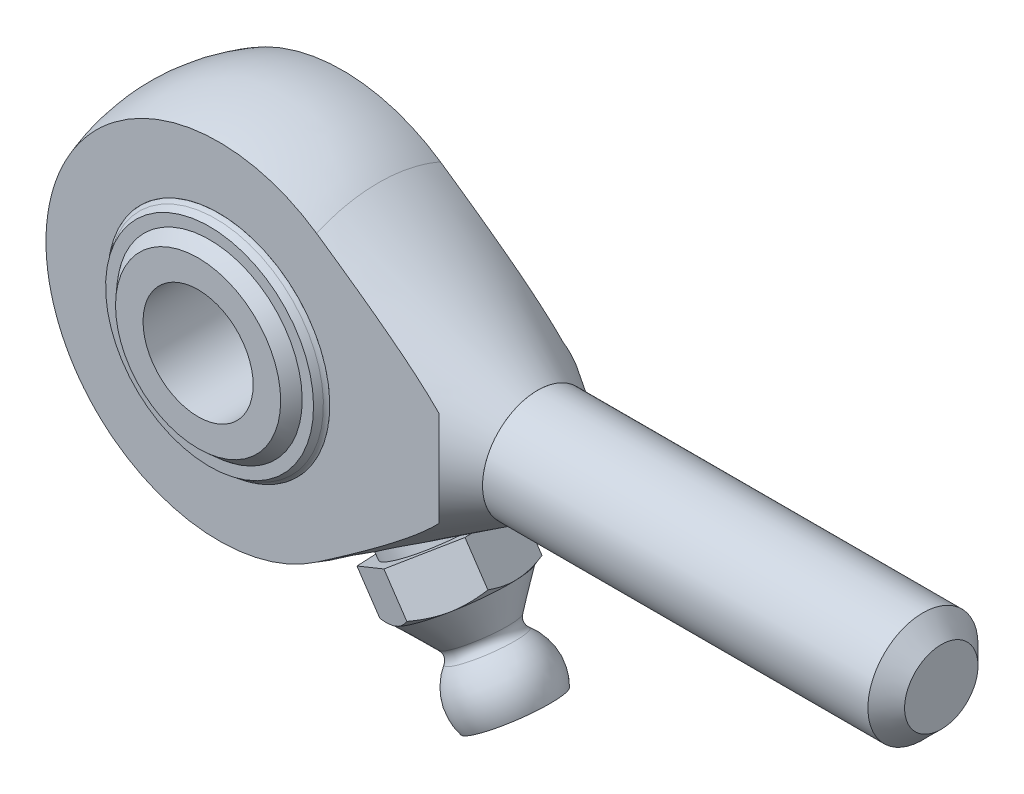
ISO-10303-21;
HEADER;
FILE_DESCRIPTION(('STEP AP214'),'2;1');
FILE_NAME('part.step','',(''),(''),'','','');
FILE_SCHEMA(('AUTOMOTIVE_DESIGN { 1 0 10303 214 1 1 1 1 }'));
ENDSEC;
DATA;
#1=APPLICATION_CONTEXT('core data for automotive mechanical design processes');
#2=APPLICATION_PROTOCOL_DEFINITION('international standard','automotive_design',2000,#1);
#3=PRODUCT_CONTEXT('',#1,'mechanical');
#4=PRODUCT('Part','Part','',(#3));
#5=PRODUCT_RELATED_PRODUCT_CATEGORY('part','',(#4));
#6=PRODUCT_DEFINITION_FORMATION('','',#4);
#7=PRODUCT_DEFINITION_CONTEXT('part definition',#1,'design');
#8=PRODUCT_DEFINITION('design','',#6,#7);
#9=PRODUCT_DEFINITION_SHAPE('','',#8);
#10=(LENGTH_UNIT() NAMED_UNIT(*) SI_UNIT(.MILLI.,.METRE.));
#11=(NAMED_UNIT(*) PLANE_ANGLE_UNIT() SI_UNIT($,.RADIAN.));
#12=(NAMED_UNIT(*) SI_UNIT($,.STERADIAN.) SOLID_ANGLE_UNIT());
#13=UNCERTAINTY_MEASURE_WITH_UNIT(LENGTH_MEASURE(1.E-05),#10,'distance_accuracy_value','');
#14=(GEOMETRIC_REPRESENTATION_CONTEXT(3) GLOBAL_UNCERTAINTY_ASSIGNED_CONTEXT((#13)) GLOBAL_UNIT_ASSIGNED_CONTEXT((#10,
#11,#12)) REPRESENTATION_CONTEXT('',''));
#15=CARTESIAN_POINT('',(0.,0.,0.));
#16=DIRECTION('',(0.,0.,1.));
#17=DIRECTION('',(1.,0.,0.));
#18=AXIS2_PLACEMENT_3D('',#15,#16,#17);
#19=CARTESIAN_POINT('',(-2.06218718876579,-6.34675956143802,0.937882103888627));
#20=DIRECTION('',(0.306009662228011,0.941800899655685,-0.139173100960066));
#21=DIRECTION('',(-0.0430068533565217,-0.132361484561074,-0.99026806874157));
#22=AXIS2_PLACEMENT_3D('',#19,#20,#21);
#23=SPHERICAL_SURFACE('',#22,0.75);
#24=CARTESIAN_POINT('',(-1.83267994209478,-5.64040888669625,0.833502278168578));
#25=VERTEX_POINT('',#24);
#26=VERTEX_LOOP('',#25);
#27=FACE_BOUND('',#26,.T.);
#28=ADVANCED_FACE('P0_F12',(#27),#23,.T.);
#29=CLOSED_SHELL('',(#28));
#30=MANIFOLD_SOLID_BREP('P0_B1',#29);
#31=CARTESIAN_POINT('',(0.,6.67337792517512,0.937882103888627));
#32=DIRECTION('',(0.,-0.99026806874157,-0.139173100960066));
#33=DIRECTION('',(0.,0.139173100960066,-0.99026806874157));
#34=AXIS2_PLACEMENT_3D('',#31,#32,#33);
#35=SPHERICAL_SURFACE('',#34,0.75);
#36=CARTESIAN_POINT('',(0.,5.93067687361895,0.833502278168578));
#37=VERTEX_POINT('',#36);
#38=VERTEX_LOOP('',#37);
#39=FACE_BOUND('',#38,.T.);
#40=ADVANCED_FACE('P1_F12',(#39),#35,.T.);
#41=CLOSED_SHELL('',(#40));
#42=MANIFOLD_SOLID_BREP('P1_B1',#41);
#43=CARTESIAN_POINT('',(2.0621871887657,-6.34675956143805,-0.937882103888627));
#44=DIRECTION('',(-0.306009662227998,0.94180089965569,0.139173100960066));
#45=DIRECTION('',(0.0430068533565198,-0.132361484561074,0.99026806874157));
#46=AXIS2_PLACEMENT_3D('',#43,#44,#45);
#47=SPHERICAL_SURFACE('',#46,0.75);
#48=CARTESIAN_POINT('',(1.8326799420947,-5.64040888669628,-0.833502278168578));
#49=VERTEX_POINT('',#48);
#50=VERTEX_LOOP('',#49);
#51=FACE_BOUND('',#50,.T.);
#52=ADVANCED_FACE('P2_F12',(#51),#47,.T.);
#53=CLOSED_SHELL('',(#52));
#54=MANIFOLD_SOLID_BREP('P2_B1',#53);
#55=CARTESIAN_POINT('',(0.,0.,0.));
#56=DIRECTION('',(0.,0.,1.));
#57=DIRECTION('',(0.999027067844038,0.044101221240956,0.));
#58=AXIS2_PLACEMENT_3D('',#55,#56,#57);
#59=CYLINDRICAL_SURFACE('',#58,6.05);
#60=CARTESIAN_POINT('',(0.,0.,-3.375));
#61=DIRECTION('',(0.,0.,1.));
#62=DIRECTION('',(0.999027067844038,0.044101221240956,0.));
#63=AXIS2_PLACEMENT_3D('',#60,#61,#62);
#64=CIRCLE('',#63,6.05);
#65=CARTESIAN_POINT('',(6.04411376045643,0.266812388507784,-3.375));
#66=VERTEX_POINT('',#65);
#67=EDGE_CURVE('P3_E29',#66,#66,#64,.T.);
#68=ORIENTED_EDGE('',*,*,#67,.T.);
#69=EDGE_LOOP('',(#68));
#70=FACE_BOUND('',#69,.T.);
#71=CARTESIAN_POINT('',(0.,0.,-2.875));
#72=DIRECTION('',(0.,0.,1.));
#73=DIRECTION('',(0.999027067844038,0.044101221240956,0.));
#74=AXIS2_PLACEMENT_3D('',#71,#72,#73);
#75=CIRCLE('',#74,6.05);
#76=CARTESIAN_POINT('',(6.04411376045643,0.266812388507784,-2.875));
#77=VERTEX_POINT('',#76);
#78=EDGE_CURVE('P3_E40',#77,#77,#75,.T.);
#79=ORIENTED_EDGE('',*,*,#78,.F.);
#80=EDGE_LOOP('',(#79));
#81=FACE_BOUND('',#80,.T.);
#82=ADVANCED_FACE('P3_F14',(#70,#81),#59,.T.);
#83=CARTESIAN_POINT('',(0.,0.,0.));
#84=DIRECTION('',(0.,0.,1.));
#85=DIRECTION('',(-0.044101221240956,0.999027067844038,0.));
#86=AXIS2_PLACEMENT_3D('',#83,#84,#85);
#87=SPHERICAL_SURFACE('',#86,6.86396103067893);
#88=CARTESIAN_POINT('',(0.,0.,-3.54698675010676));
#89=DIRECTION('',(0.,0.,1.));
#90=DIRECTION('',(0.999027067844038,0.044101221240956,0.));
#91=AXIS2_PLACEMENT_3D('',#88,#89,#90);
#92=CIRCLE('',#91,5.87646543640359);
#93=CARTESIAN_POINT('',(-0.259159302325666,5.87074803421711,-3.54698675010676));
#94=VERTEX_POINT('',#93);
#95=EDGE_CURVE('P3_E10',#94,#94,#92,.F.);
#96=CARTESIAN_POINT('',(0.,0.,-3.875));
#97=DIRECTION('',(0.,0.,1.));
#98=DIRECTION('',(0.999027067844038,0.044101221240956,0.));
#99=AXIS2_PLACEMENT_3D('',#96,#97,#98);
#100=CIRCLE('',#99,5.66553934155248);
#101=CARTESIAN_POINT('',(-0.249857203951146,5.66002715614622,-3.875));
#102=VERTEX_POINT('',#101);
#103=EDGE_CURVE('P3_E34',#102,#102,#100,.T.);
#104=CARTESIAN_POINT('',(-0.259159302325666,5.87074803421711,-3.54698675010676));
#105=CARTESIAN_POINT('',(-0.259066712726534,5.86865059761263,-3.55046505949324));
#106=CARTESIAN_POINT('',(-0.258973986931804,5.86655007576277,-3.55394150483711));
#107=CARTESIAN_POINT('',(-0.258788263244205,5.8623428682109,-3.56089065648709));
#108=CARTESIAN_POINT('',(-0.258695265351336,5.86023618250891,-3.5643633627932));
#109=CARTESIAN_POINT('',(-0.258508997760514,5.85601665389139,-3.5713050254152));
#110=CARTESIAN_POINT('',(-0.258415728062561,5.85390381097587,-3.57477398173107));
#111=CARTESIAN_POINT('',(-0.258228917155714,5.84967197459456,-3.58170813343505));
#112=CARTESIAN_POINT('',(-0.258135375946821,5.84755298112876,-3.58517332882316));
#113=CARTESIAN_POINT('',(-0.257948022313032,5.84330885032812,-3.59209994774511));
#114=CARTESIAN_POINT('',(-0.257854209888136,5.84118371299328,-3.59556137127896));
#115=CARTESIAN_POINT('',(-0.25766631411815,5.83692730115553,-3.60248043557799));
#116=CARTESIAN_POINT('',(-0.257572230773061,5.83479602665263,-3.60593807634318));
#117=CARTESIAN_POINT('',(-0.257383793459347,5.830527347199,-3.61284956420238));
#118=CARTESIAN_POINT('',(-0.257289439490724,5.82838994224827,-3.6163034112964));
#119=CARTESIAN_POINT('',(-0.257100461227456,5.82410900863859,-3.62320730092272));
#120=CARTESIAN_POINT('',(-0.257005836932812,5.82196547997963,-3.62665734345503));
#121=CARTESIAN_POINT('',(-0.256816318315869,5.81767230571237,-3.63355361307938));
#122=CARTESIAN_POINT('',(-0.25672142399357,5.81552266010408,-3.63699984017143));
#123=CARTESIAN_POINT('',(-0.256531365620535,5.81121725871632,-3.64388846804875));
#124=CARTESIAN_POINT('',(-0.256436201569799,5.80906150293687,-3.64733086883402));
#125=CARTESIAN_POINT('',(-0.256245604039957,5.80474388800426,-3.65421183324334));
#126=CARTESIAN_POINT('',(-0.256150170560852,5.8025820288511,-3.65765039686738));
#127=CARTESIAN_POINT('',(-0.255959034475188,5.79825221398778,-3.6645236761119));
#128=CARTESIAN_POINT('',(-0.25586333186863,5.79608425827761,-3.66795839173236));
#129=CARTESIAN_POINT('',(-0.255671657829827,5.79174225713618,-3.6748239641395));
#130=CARTESIAN_POINT('',(-0.255575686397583,5.78956821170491,-3.67825482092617));
#131=CARTESIAN_POINT('',(-0.255383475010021,5.78521403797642,-3.68511266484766));
#132=CARTESIAN_POINT('',(-0.255287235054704,5.78303390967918,-3.68853965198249));
#133=CARTESIAN_POINT('',(-0.255094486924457,5.77866757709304,-3.69538974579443));
#134=CARTESIAN_POINT('',(-0.254997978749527,5.77648137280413,-3.69881285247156));
#135=CARTESIAN_POINT('',(-0.254804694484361,5.77210289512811,-3.70565517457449));
#136=CARTESIAN_POINT('',(-0.254707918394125,5.76991062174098,-3.70907439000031));
#137=CARTESIAN_POINT('',(-0.254514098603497,5.76552001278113,-3.71590891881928));
#138=CARTESIAN_POINT('',(-0.254417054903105,5.76332167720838,-3.71932423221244));
#139=CARTESIAN_POINT('',(-0.25422270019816,5.758918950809,-3.72615094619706));
#140=CARTESIAN_POINT('',(-0.254125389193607,5.75671455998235,-3.72956234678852));
#141=CARTESIAN_POINT('',(-0.253930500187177,5.75229973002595,-3.73638122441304));
#142=CARTESIAN_POINT('',(-0.253832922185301,5.7500892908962,-3.73978870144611));
#143=CARTESIAN_POINT('',(-0.253637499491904,5.74566237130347,-3.7465997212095));
#144=CARTESIAN_POINT('',(-0.253539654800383,5.74344589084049,-3.75000326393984));
#145=CARTESIAN_POINT('',(-0.253343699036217,5.73900689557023,-3.75680640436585));
#146=CARTESIAN_POINT('',(-0.253245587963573,5.73678438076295,-3.76020600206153));
#147=CARTESIAN_POINT('',(-0.253049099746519,5.73233332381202,-3.76700124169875));
#148=CARTESIAN_POINT('',(-0.252950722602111,5.73010478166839,-3.77039688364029));
#149=CARTESIAN_POINT('',(-0.252753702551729,5.72564167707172,-3.77718420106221));
#150=CARTESIAN_POINT('',(-0.252655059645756,5.72340711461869,-3.78057587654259));
#151=CARTESIAN_POINT('',(-0.252457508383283,5.71893197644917,-3.7873552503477));
#152=CARTESIAN_POINT('',(-0.252358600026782,5.71669140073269,-3.79074294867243));
#153=CARTESIAN_POINT('',(-0.252160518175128,5.71220424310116,-3.79751435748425));
#154=CARTESIAN_POINT('',(-0.252061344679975,5.70995766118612,-3.80089806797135));
#155=CARTESIAN_POINT('',(-0.251862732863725,5.70545849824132,-3.80766149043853));
#156=CARTESIAN_POINT('',(-0.251763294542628,5.70320591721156,-3.81104120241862));
#157=CARTESIAN_POINT('',(-0.251564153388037,5.69869476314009,-3.81779661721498));
#158=CARTESIAN_POINT('',(-0.251464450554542,5.69643619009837,-3.82117232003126));
#159=CARTESIAN_POINT('',(-0.251264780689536,5.69191305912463,-3.82791970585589));
#160=CARTESIAN_POINT('',(-0.251164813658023,5.68964850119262,-3.83129138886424));
#161=CARTESIAN_POINT('',(-0.25096461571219,5.68511340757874,-3.83803072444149));
#162=CARTESIAN_POINT('',(-0.250864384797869,5.68284287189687,-3.8413983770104));
#163=CARTESIAN_POINT('',(-0.250663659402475,5.67829582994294,-3.84812964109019));
#164=CARTESIAN_POINT('',(-0.250563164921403,5.67601932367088,-3.85149325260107));
#165=CARTESIAN_POINT('',(-0.250361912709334,5.67146034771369,-3.8582164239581));
#166=CARTESIAN_POINT('',(-0.250261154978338,5.66917787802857,-3.86157598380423));
#167=CARTESIAN_POINT('',(-0.250059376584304,5.66460698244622,-3.86829104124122));
#168=CARTESIAN_POINT('',(-0.249958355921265,5.662318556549,-3.87164653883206));
#169=CARTESIAN_POINT('',(-0.249857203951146,5.66002715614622,-3.875));
#170=B_SPLINE_CURVE_WITH_KNOTS('',3,(#104,#105,#106,#107,#108,#109,#110,#111,#112,#113,#114,
#115,#116,#117,#118,#119,#120,#121,#122,#123,#124,#125,#126,#127,#128,#129,#130,#131,#132,#133,
#134,#135,#136,#137,#138,#139,#140,#141,#142,#143,#144,#145,#146,#147,#148,#149,#150,#151,#152,
#153,#154,#155,#156,#157,#158,#159,#160,#161,#162,#163,#164,#165,#166,#167,#168,#169),
.UNSPECIFIED.,.F.,.F.,(4,2,2,2,2,2,2,2,2,2,2,2,2,2,2,2,2,2,2,2,2,2,2,2,2,2,2,2,2,2,2,2,4),(0.,
0.0121884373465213,0.0243768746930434,0.0365653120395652,0.0487537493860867,0.0609421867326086,
0.0731306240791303,0.085319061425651,0.0975074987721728,0.109695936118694,0.121884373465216,
0.134072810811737,0.146261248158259,0.15844968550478,0.170638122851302,0.182826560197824,
0.195014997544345,0.207203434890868,0.219391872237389,0.231580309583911,0.243768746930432,
0.255957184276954,0.268145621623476,0.280334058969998,0.292522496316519,0.30471093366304,
0.316899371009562,0.329087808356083,0.341276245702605,0.353464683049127,0.365653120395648,
0.37784155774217,0.390029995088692),.UNSPECIFIED.);
#171=EDGE_CURVE('P3_BSEAM47',#94,#102,#170,.T.);
#172=ORIENTED_EDGE('',*,*,#95,.T.);
#173=ORIENTED_EDGE('',*,*,#103,.T.);
#174=ORIENTED_EDGE('',*,*,#171,.T.);
#175=ORIENTED_EDGE('',*,*,#171,.F.);
#176=EDGE_LOOP('',(#172,#174,#173,#175));
#177=FACE_BOUND('',#176,.T.);
#178=ADVANCED_FACE('P3_F47',(#177),#87,.T.);
#179=CARTESIAN_POINT('',(-0.222632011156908,5.04329356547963,-3.875));
#180=DIRECTION('',(0.,0.,-1.));
#181=DIRECTION('',(-0.999027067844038,-0.044101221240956,0.));
#182=AXIS2_PLACEMENT_3D('',#179,#180,#181);
#183=PLANE('',#182);
#184=CARTESIAN_POINT('',(0.,0.,-3.875));
#185=DIRECTION('',(0.,0.,1.));
#186=DIRECTION('',(0.999027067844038,0.044101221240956,0.));
#187=AXIS2_PLACEMENT_3D('',#184,#185,#186);
#188=CIRCLE('',#187,5.04820512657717);
#189=CARTESIAN_POINT('',(-0.222632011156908,5.04329356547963,-3.875));
#190=VERTEX_POINT('',#189);
#191=EDGE_CURVE('P3_E37',#190,#190,#188,.T.);
#192=ORIENTED_EDGE('',*,*,#191,.T.);
#193=EDGE_LOOP('',(#192));
#194=FACE_BOUND('',#193,.T.);
#195=ORIENTED_EDGE('',*,*,#103,.F.);
#196=EDGE_LOOP('',(#195));
#197=FACE_BOUND('',#196,.T.);
#198=ADVANCED_FACE('P3_F54',(#194,#197),#183,.T.);
#199=CARTESIAN_POINT('',(0.,0.,0.));
#200=DIRECTION('',(0.,0.,1.));
#201=DIRECTION('',(-0.044101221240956,0.999027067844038,0.));
#202=AXIS2_PLACEMENT_3D('',#199,#200,#201);
#203=SPHERICAL_SURFACE('',#202,6.36396103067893);
#204=CARTESIAN_POINT('',(0.,0.,-3.12915070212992));
#205=DIRECTION('',(0.,0.,1.));
#206=DIRECTION('',(0.999027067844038,0.044101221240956,0.));
#207=AXIS2_PLACEMENT_3D('',#204,#205,#206);
#208=CIRCLE('',#207,5.54151747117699);
#209=CARTESIAN_POINT('',(-0.244387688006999,5.53612595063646,-3.12915070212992));
#210=VERTEX_POINT('',#209);
#211=EDGE_CURVE('P3_E25',#210,#210,#208,.T.);
#212=CARTESIAN_POINT('',(-0.244387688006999,5.53612595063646,-3.12915070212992));
#213=CARTESIAN_POINT('',(-0.244185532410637,5.53154651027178,-3.13726848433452));
#214=CARTESIAN_POINT('',(-0.243982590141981,5.52694924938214,-3.14537619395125));
#215=CARTESIAN_POINT('',(-0.243575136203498,5.51771917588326,-3.1615713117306));
#216=CARTESIAN_POINT('',(-0.24337062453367,5.51308636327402,-3.16965871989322));
#217=CARTESIAN_POINT('',(-0.242960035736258,5.50378527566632,-3.18581307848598));
#218=CARTESIAN_POINT('',(-0.242753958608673,5.49911700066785,-3.19388002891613));
#219=CARTESIAN_POINT('',(-0.242340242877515,5.48974507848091,-3.20999331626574));
#220=CARTESIAN_POINT('',(-0.242132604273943,5.48504143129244,-3.21803965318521));
#221=CARTESIAN_POINT('',(-0.241715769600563,5.4755988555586,-3.23411155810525));
#222=CARTESIAN_POINT('',(-0.241506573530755,5.47085992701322,-3.24213712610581));
#223=CARTESIAN_POINT('',(-0.241086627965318,5.46134688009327,-3.25816733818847));
#224=CARTESIAN_POINT('',(-0.240875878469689,5.4565727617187,-3.26617198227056));
#225=CARTESIAN_POINT('',(-0.240452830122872,5.44698942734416,-3.28216019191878));
#226=CARTESIAN_POINT('',(-0.240240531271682,5.44218021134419,-3.29014375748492));
#227=CARTESIAN_POINT('',(-0.23981438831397,5.43252677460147,-3.3060896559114));
#228=CARTESIAN_POINT('',(-0.239600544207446,5.42768255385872,-3.31405198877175));
#229=CARTESIAN_POINT('',(-0.239171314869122,5.41795920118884,-3.32995526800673));
#230=CARTESIAN_POINT('',(-0.238955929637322,5.41308006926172,-3.33789621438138));
#231=CARTESIAN_POINT('',(-0.238523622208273,5.40328698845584,-3.35375656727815));
#232=CARTESIAN_POINT('',(-0.238306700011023,5.39837303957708,-3.36167597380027));
#233=CARTESIAN_POINT('',(-0.237871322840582,5.38851041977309,-3.37749309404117));
#234=CARTESIAN_POINT('',(-0.237652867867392,5.38356174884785,-3.38539080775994));
#235=CARTESIAN_POINT('',(-0.237214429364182,5.37362978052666,-3.40116438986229));
#236=CARTESIAN_POINT('',(-0.236994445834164,5.3686464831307,-3.40904025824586));
#237=CARTESIAN_POINT('',(-0.236552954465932,5.35864535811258,-3.42476999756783));
#238=CARTESIAN_POINT('',(-0.23633144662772,5.35362753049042,-3.43262386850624));
#239=CARTESIAN_POINT('',(-0.235886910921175,5.3435574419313,-3.4483094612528));
#240=CARTESIAN_POINT('',(-0.235663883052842,5.33850518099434,-3.45614118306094));
#241=CARTESIAN_POINT('',(-0.235216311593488,5.32836632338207,-3.47178232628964));
#242=CARTESIAN_POINT('',(-0.234991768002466,5.32327972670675,-3.47959174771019));
#243=CARTESIAN_POINT('',(-0.234541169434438,5.31307229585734,-3.49518813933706));
#244=CARTESIAN_POINT('',(-0.234315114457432,5.30795146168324,-3.50297510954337));
#245=CARTESIAN_POINT('',(-0.233861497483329,5.29767565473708,-3.51852644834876));
#246=CARTESIAN_POINT('',(-0.233633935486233,5.29252068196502,-3.52629081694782));
#247=CARTESIAN_POINT('',(-0.233177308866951,5.2821766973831,-3.54179680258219));
#248=CARTESIAN_POINT('',(-0.232948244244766,5.27698768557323,-3.54953841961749));
#249=CARTESIAN_POINT('',(-0.232488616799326,5.26657572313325,-3.56499875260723));
#250=CARTESIAN_POINT('',(-0.232258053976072,5.26135277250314,-3.57271746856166));
#251=CARTESIAN_POINT('',(-0.231795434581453,5.2508730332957,-3.58813185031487));
#252=CARTESIAN_POINT('',(-0.231563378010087,5.24561624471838,-3.59582751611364));
#253=CARTESIAN_POINT('',(-0.23109777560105,5.2350689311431,-3.6111956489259));
#254=CARTESIAN_POINT('',(-0.230864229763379,5.22977840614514,-3.61886811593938));
#255=CARTESIAN_POINT('',(-0.2303956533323,5.2191637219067,-3.63418970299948));
#256=CARTESIAN_POINT('',(-0.230160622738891,5.21383956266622,-3.64183882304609));
#257=CARTESIAN_POINT('',(-0.229689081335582,5.20315771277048,-3.6571135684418));
#258=CARTESIAN_POINT('',(-0.229452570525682,5.19780002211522,-3.66473919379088));
#259=CARTESIAN_POINT('',(-0.228978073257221,5.18705121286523,-3.67996680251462));
#260=CARTESIAN_POINT('',(-0.22874008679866,5.1816600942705,-3.68756878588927));
#261=CARTESIAN_POINT('',(-0.228262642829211,5.17084453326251,-3.70274896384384));
#262=CARTESIAN_POINT('',(-0.228023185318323,5.16542009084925,-3.71032715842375));
#263=CARTESIAN_POINT('',(-0.227542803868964,5.15453798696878,-3.72545961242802));
#264=CARTESIAN_POINT('',(-0.227301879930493,5.14908032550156,-3.73301387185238));
#265=CARTESIAN_POINT('',(-0.226818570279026,5.13813188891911,-3.74809830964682));
#266=CARTESIAN_POINT('',(-0.22657618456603,5.13264111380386,-3.7556284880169));
#267=CARTESIAN_POINT('',(-0.22608995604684,5.12162655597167,-3.77066461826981));
#268=CARTESIAN_POINT('',(-0.225846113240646,5.11610277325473,-3.77817057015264));
#269=CARTESIAN_POINT('',(-0.225356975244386,5.10502230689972,-3.7931581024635));
#270=CARTESIAN_POINT('',(-0.225111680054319,5.09946562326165,-3.80063968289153));
#271=CARTESIAN_POINT('',(-0.224619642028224,5.0883194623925,-3.81557832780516));
#272=CARTESIAN_POINT('',(-0.224372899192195,5.08272998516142,-3.82303539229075));
#273=CARTESIAN_POINT('',(-0.223877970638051,5.07151834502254,-3.83792486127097));
#274=CARTESIAN_POINT('',(-0.223629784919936,5.06589618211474,-3.84535726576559));
#275=CARTESIAN_POINT('',(-0.223131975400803,5.05461927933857,-3.86019727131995));
#276=CARTESIAN_POINT('',(-0.222882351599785,5.0489645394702,-3.86760487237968));
#277=CARTESIAN_POINT('',(-0.222632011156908,5.04329356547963,-3.875));
#278=B_SPLINE_CURVE_WITH_KNOTS('',3,(#212,#213,#214,#215,#216,#217,#218,#219,#220,#221,#222,
#223,#224,#225,#226,#227,#228,#229,#230,#231,#232,#233,#234,#235,#236,#237,#238,#239,#240,#241,
#242,#243,#244,#245,#246,#247,#248,#249,#250,#251,#252,#253,#254,#255,#256,#257,#258,#259,#260,
#261,#262,#263,#264,#265,#266,#267,#268,#269,#270,#271,#272,#273,#274,#275,#276,#277),
.UNSPECIFIED.,.F.,.F.,(4,2,2,2,2,2,2,2,2,2,2,2,2,2,2,2,2,2,2,2,2,2,2,2,2,2,2,2,2,2,2,2,4),(0.,
0.0279677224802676,0.055935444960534,0.0839031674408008,0.111870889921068,0.139838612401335,
0.167806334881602,0.195774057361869,0.223741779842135,0.251709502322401,0.279677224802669,
0.307644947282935,0.335612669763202,0.363580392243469,0.391548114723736,0.419515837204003,
0.44748355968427,0.475451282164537,0.503419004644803,0.531386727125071,0.559354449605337,
0.587322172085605,0.615289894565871,0.643257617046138,0.671225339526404,0.699193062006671,
0.727160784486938,0.755128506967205,0.783096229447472,0.811063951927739,0.839031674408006,
0.866999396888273,0.894967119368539),.UNSPECIFIED.);
#279=EDGE_CURVE('P3_BSEAM65',#210,#190,#278,.T.);
#280=ORIENTED_EDGE('',*,*,#211,.T.);
#281=ORIENTED_EDGE('',*,*,#191,.F.);
#282=ORIENTED_EDGE('',*,*,#279,.T.);
#283=ORIENTED_EDGE('',*,*,#279,.F.);
#284=EDGE_LOOP('',(#280,#282,#281,#283));
#285=FACE_BOUND('',#284,.T.);
#286=ADVANCED_FACE('P3_F65',(#285),#203,.F.);
#287=CARTESIAN_POINT('',(-0.266812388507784,6.04411376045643,-2.875));
#288=DIRECTION('',(0.,0.,1.));
#289=DIRECTION('',(0.999027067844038,0.044101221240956,0.));
#290=AXIS2_PLACEMENT_3D('',#287,#288,#289);
#291=PLANE('',#290);
#292=CARTESIAN_POINT('',(0.,0.,-2.875));
#293=DIRECTION('',(0.,0.,1.));
#294=DIRECTION('',(0.999027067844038,0.044101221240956,0.));
#295=AXIS2_PLACEMENT_3D('',#292,#293,#294);
#296=CIRCLE('',#295,5.97690020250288);
#297=CARTESIAN_POINT('',(5.97108508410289,0.263588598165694,-2.875));
#298=VERTEX_POINT('',#297);
#299=EDGE_CURVE('P3_E21',#298,#298,#296,.F.);
#300=ORIENTED_EDGE('',*,*,#299,.T.);
#301=EDGE_LOOP('',(#300));
#302=FACE_BOUND('',#301,.T.);
#303=ORIENTED_EDGE('',*,*,#78,.T.);
#304=EDGE_LOOP('',(#303));
#305=FACE_BOUND('',#304,.T.);
#306=ADVANCED_FACE('P3_F44',(#302,#305),#291,.T.);
#307=CARTESIAN_POINT('',(0.,0.,-3.375));
#308=DIRECTION('',(0.,0.,1.));
#309=DIRECTION('',(0.999027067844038,0.044101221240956,0.));
#310=AXIS2_PLACEMENT_3D('',#307,#308,#309);
#311=TOROIDAL_SURFACE('',#310,5.97690020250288,0.5);
#312=ORIENTED_EDGE('',*,*,#299,.F.);
#313=EDGE_LOOP('',(#312));
#314=FACE_BOUND('',#313,.T.);
#315=ORIENTED_EDGE('',*,*,#211,.F.);
#316=EDGE_LOOP('',(#315));
#317=FACE_BOUND('',#316,.T.);
#318=ADVANCED_FACE('P3_F57',(#314,#317),#311,.T.);
#319=CARTESIAN_POINT('',(0.,0.,-3.80536429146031));
#320=DIRECTION('',(0.,0.,-1.));
#321=DIRECTION('',(-0.999027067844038,-0.044101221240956,0.));
#322=AXIS2_PLACEMENT_3D('',#319,#320,#321);
#323=TOROIDAL_SURFACE('',#322,6.30453207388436,0.5);
#324=ORIENTED_EDGE('',*,*,#95,.F.);
#325=EDGE_LOOP('',(#324));
#326=FACE_BOUND('',#325,.T.);
#327=ORIENTED_EDGE('',*,*,#67,.F.);
#328=EDGE_LOOP('',(#327));
#329=FACE_BOUND('',#328,.T.);
#330=ADVANCED_FACE('P3_F16',(#326,#329),#323,.F.);
#331=CLOSED_SHELL('',(#82,#178,#198,#286,#306,#318,#330));
#332=MANIFOLD_SOLID_BREP('P3_B1',#331);
#333=CARTESIAN_POINT('',(-3.92251312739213,-5.39887615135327,0.937882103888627));
#334=DIRECTION('',(0.582064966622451,0.801143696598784,-0.139173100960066));
#335=DIRECTION('',(-0.0818038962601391,-0.112593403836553,-0.99026806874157));
#336=AXIS2_PLACEMENT_3D('',#333,#334,#335);
#337=SPHERICAL_SURFACE('',#336,0.75);
#338=CARTESIAN_POINT('',(-3.48596440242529,-4.79801837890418,0.833502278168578));
#339=VERTEX_POINT('',#338);
#340=VERTEX_LOOP('',#339);
#341=FACE_BOUND('',#340,.T.);
#342=ADVANCED_FACE('P4_F12',(#341),#337,.T.);
#343=CLOSED_SHELL('',(#342));
#344=MANIFOLD_SOLID_BREP('P4_B1',#343);
#345=CARTESIAN_POINT('',(2.06218718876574,6.34675956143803,0.937882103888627));
#346=DIRECTION('',(-0.306009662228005,-0.941800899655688,-0.139173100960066));
#347=DIRECTION('',(0.0430068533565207,0.132361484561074,-0.99026806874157));
#348=AXIS2_PLACEMENT_3D('',#345,#346,#347);
#349=SPHERICAL_SURFACE('',#348,0.75);
#350=CARTESIAN_POINT('',(1.83267994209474,5.64040888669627,0.833502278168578));
#351=VERTEX_POINT('',#350);
#352=VERTEX_LOOP('',#351);
#353=FACE_BOUND('',#352,.T.);
#354=ADVANCED_FACE('P5_F12',(#353),#349,.T.);
#355=CLOSED_SHELL('',(#354));
#356=MANIFOLD_SOLID_BREP('P5_B1',#355);
#357=CARTESIAN_POINT('',(0.,-6.67337792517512,-0.937882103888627));
#358=DIRECTION('',(0.,0.99026806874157,0.139173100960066));
#359=DIRECTION('',(0.,-0.139173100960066,0.99026806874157));
#360=AXIS2_PLACEMENT_3D('',#357,#358,#359);
#361=SPHERICAL_SURFACE('',#360,0.75);
#362=CARTESIAN_POINT('',(0.,-5.93067687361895,-0.833502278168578));
#363=VERTEX_POINT('',#362);
#364=VERTEX_LOOP('',#363);
#365=FACE_BOUND('',#364,.T.);
#366=ADVANCED_FACE('P6_F12',(#365),#361,.T.);
#367=CLOSED_SHELL('',(#366));
#368=MANIFOLD_SOLID_BREP('P6_B1',#367);
#369=CARTESIAN_POINT('',(-5.39887615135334,-3.92251312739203,0.937882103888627));
#370=DIRECTION('',(0.801143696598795,0.582064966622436,-0.139173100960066));
#371=DIRECTION('',(-0.112593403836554,-0.081803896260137,-0.99026806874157));
#372=AXIS2_PLACEMENT_3D('',#369,#370,#371);
#373=SPHERICAL_SURFACE('',#372,0.75);
#374=CARTESIAN_POINT('',(-4.79801837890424,-3.4859644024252,0.833502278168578));
#375=VERTEX_POINT('',#374);
#376=VERTEX_LOOP('',#375);
#377=FACE_BOUND('',#376,.T.);
#378=ADVANCED_FACE('P7_F12',(#377),#373,.T.);
#379=CLOSED_SHELL('',(#378));
#380=MANIFOLD_SOLID_BREP('P7_B1',#379);
#381=CARTESIAN_POINT('',(3.92251312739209,5.3988761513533,0.937882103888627));
#382=DIRECTION('',(-0.582064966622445,-0.801143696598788,-0.139173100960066));
#383=DIRECTION('',(0.0818038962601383,0.112593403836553,-0.99026806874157));
#384=AXIS2_PLACEMENT_3D('',#381,#382,#383);
#385=SPHERICAL_SURFACE('',#384,0.75);
#386=CARTESIAN_POINT('',(3.48596440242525,4.7980183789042,0.833502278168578));
#387=VERTEX_POINT('',#386);
#388=VERTEX_LOOP('',#387);
#389=FACE_BOUND('',#388,.T.);
#390=ADVANCED_FACE('P8_F12',(#389),#385,.T.);
#391=CLOSED_SHELL('',(#390));
#392=MANIFOLD_SOLID_BREP('P8_B1',#391);
#393=CARTESIAN_POINT('',(-2.06218718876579,-6.34675956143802,-0.937882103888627));
#394=DIRECTION('',(0.306009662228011,0.941800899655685,0.139173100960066));
#395=DIRECTION('',(-0.0430068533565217,-0.132361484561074,0.99026806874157));
#396=AXIS2_PLACEMENT_3D('',#393,#394,#395);
#397=SPHERICAL_SURFACE('',#396,0.75);
#398=CARTESIAN_POINT('',(-1.83267994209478,-5.64040888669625,-0.833502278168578));
#399=VERTEX_POINT('',#398);
#400=VERTEX_LOOP('',#399);
#401=FACE_BOUND('',#400,.T.);
#402=ADVANCED_FACE('P9_F12',(#401),#397,.T.);
#403=CLOSED_SHELL('',(#402));
#404=MANIFOLD_SOLID_BREP('P9_B1',#403);
#405=CARTESIAN_POINT('',(0.,0.,0.));
#406=DIRECTION('',(0.,1.,0.));
#407=DIRECTION('',(1.,0.,0.));
#408=AXIS2_PLACEMENT_3D('',#405,#406,#407);
#409=SPHERICAL_SURFACE('',#408,6.36396103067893);
#410=CARTESIAN_POINT('',(0.,0.,0.));
#411=DIRECTION('',(0.,0.,1.));
#412=DIRECTION('',(1.,0.,0.));
#413=AXIS2_PLACEMENT_3D('',#410,#411,#412);
#414=SPHERICAL_SURFACE('',#413,6.36396103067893);
#415=CARTESIAN_POINT('',(0.,0.,1.50561282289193));
#416=DIRECTION('',(0.,0.,1.));
#417=DIRECTION('',(1.,0.,0.));
#418=AXIS2_PLACEMENT_3D('',#415,#416,#417);
#419=CIRCLE('',#418,6.18329443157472);
#420=CARTESIAN_POINT('',(6.18329443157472,0.,1.50561282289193));
#421=VERTEX_POINT('',#420);
#422=EDGE_CURVE('P10_E18',#421,#421,#419,.F.);
#423=ORIENTED_EDGE('',*,*,#422,.F.);
#424=EDGE_LOOP('',(#423));
#425=FACE_BOUND('',#424,.T.);
#426=CARTESIAN_POINT('',(0.,0.,4.5));
#427=DIRECTION('',(0.,0.,-1.));
#428=DIRECTION('',(-1.,0.,0.));
#429=AXIS2_PLACEMENT_3D('',#426,#427,#428);
#430=CIRCLE('',#429,4.5);
#431=CARTESIAN_POINT('',(-4.5,0.,4.5));
#432=VERTEX_POINT('',#431);
#433=EDGE_CURVE('P10_E27',#432,#432,#430,.F.);
#434=ORIENTED_EDGE('',*,*,#433,.F.);
#435=EDGE_LOOP('',(#434));
#436=FACE_BOUND('',#435,.T.);
#437=ADVANCED_FACE('P10_F14',(#425,#436),#414,.T.);
#438=CARTESIAN_POINT('',(0.,0.,0.));
#439=DIRECTION('',(0.,0.,-1.));
#440=DIRECTION('',(-1.,0.,0.));
#441=AXIS2_PLACEMENT_3D('',#438,#439,#440);
#442=SPHERICAL_SURFACE('',#441,6.36396103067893);
#443=CARTESIAN_POINT('',(0.,0.,-1.50561282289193));
#444=DIRECTION('',(0.,0.,-1.));
#445=DIRECTION('',(-1.,0.,0.));
#446=AXIS2_PLACEMENT_3D('',#443,#444,#445);
#447=CIRCLE('',#446,6.18329443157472);
#448=CARTESIAN_POINT('',(-6.18329443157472,0.,-1.50561282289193));
#449=VERTEX_POINT('',#448);
#450=EDGE_CURVE('P10_E34',#449,#449,#447,.F.);
#451=ORIENTED_EDGE('',*,*,#450,.F.);
#452=EDGE_LOOP('',(#451));
#453=FACE_BOUND('',#452,.T.);
#454=CARTESIAN_POINT('',(0.,0.,-4.5));
#455=DIRECTION('',(0.,0.,1.));
#456=DIRECTION('',(1.,0.,0.));
#457=AXIS2_PLACEMENT_3D('',#454,#455,#456);
#458=CIRCLE('',#457,4.5);
#459=CARTESIAN_POINT('',(4.5,0.,-4.5));
#460=VERTEX_POINT('',#459);
#461=EDGE_CURVE('P10_E10',#460,#460,#458,.F.);
#462=ORIENTED_EDGE('',*,*,#461,.F.);
#463=EDGE_LOOP('',(#462));
#464=FACE_BOUND('',#463,.T.);
#465=ADVANCED_FACE('P10_F50',(#453,#464),#442,.T.);
#466=CARTESIAN_POINT('',(0.,0.,0.));
#467=DIRECTION('',(0.,0.,-1.));
#468=DIRECTION('',(-1.,0.,0.));
#469=AXIS2_PLACEMENT_3D('',#466,#467,#468);
#470=SPHERICAL_SURFACE('',#469,6.36396103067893);
#471=CARTESIAN_POINT('',(0.,0.,0.257058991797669));
#472=DIRECTION('',(0.,0.,-1.));
#473=DIRECTION('',(-1.,0.,0.));
#474=AXIS2_PLACEMENT_3D('',#471,#472,#473);
#475=CIRCLE('',#474,6.35876722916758);
#476=CARTESIAN_POINT('',(-6.35876722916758,0.,0.257058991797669));
#477=VERTEX_POINT('',#476);
#478=EDGE_CURVE('P10_E39',#477,#477,#475,.F.);
#479=ORIENTED_EDGE('',*,*,#478,.F.);
#480=EDGE_LOOP('',(#479));
#481=FACE_BOUND('',#480,.T.);
#482=CARTESIAN_POINT('',(0.,0.,-0.257058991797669));
#483=DIRECTION('',(0.,0.,1.));
#484=DIRECTION('',(1.,0.,0.));
#485=AXIS2_PLACEMENT_3D('',#482,#483,#484);
#486=CIRCLE('',#485,6.35876722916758);
#487=CARTESIAN_POINT('',(6.35876722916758,0.,-0.257058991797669));
#488=VERTEX_POINT('',#487);
#489=EDGE_CURVE('P10_E35',#488,#488,#486,.F.);
#490=ORIENTED_EDGE('',*,*,#489,.F.);
#491=EDGE_LOOP('',(#490));
#492=FACE_BOUND('',#491,.T.);
#493=ADVANCED_FACE('P10_F16',(#481,#492),#470,.T.);
#494=CARTESIAN_POINT('',(0.,0.,-6.36396103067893));
#495=DIRECTION('',(0.,0.,1.));
#496=DIRECTION('',(1.,0.,0.));
#497=AXIS2_PLACEMENT_3D('',#494,#495,#496);
#498=CYLINDRICAL_SURFACE('',#497,3.);
#499=CARTESIAN_POINT('',(0.,0.,4.5));
#500=DIRECTION('',(0.,0.,-1.));
#501=DIRECTION('',(-1.,0.,0.));
#502=AXIS2_PLACEMENT_3D('',#499,#500,#501);
#503=CIRCLE('',#502,3.);
#504=CARTESIAN_POINT('',(-3.,0.,4.5));
#505=VERTEX_POINT('',#504);
#506=EDGE_CURVE('P10_E31',#505,#505,#503,.F.);
#507=ORIENTED_EDGE('',*,*,#506,.T.);
#508=EDGE_LOOP('',(#507));
#509=FACE_BOUND('',#508,.T.);
#510=CARTESIAN_POINT('',(0.,0.,-4.5));
#511=DIRECTION('',(0.,0.,1.));
#512=DIRECTION('',(1.,0.,0.));
#513=AXIS2_PLACEMENT_3D('',#510,#511,#512);
#514=CIRCLE('',#513,3.);
#515=CARTESIAN_POINT('',(3.,0.,-4.5));
#516=VERTEX_POINT('',#515);
#517=EDGE_CURVE('P10_E22',#516,#516,#514,.F.);
#518=ORIENTED_EDGE('',*,*,#517,.T.);
#519=EDGE_LOOP('',(#518));
#520=FACE_BOUND('',#519,.T.);
#521=ADVANCED_FACE('P10_F62',(#509,#520),#498,.F.);
#522=CARTESIAN_POINT('',(-6.36396103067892,-6.36396103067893,-4.5));
#523=DIRECTION('',(0.,0.,1.));
#524=DIRECTION('',(1.,0.,0.));
#525=AXIS2_PLACEMENT_3D('',#522,#523,#524);
#526=PLANE('',#525);
#527=ORIENTED_EDGE('',*,*,#461,.T.);
#528=EDGE_LOOP('',(#527));
#529=FACE_BOUND('',#528,.T.);
#530=ORIENTED_EDGE('',*,*,#517,.F.);
#531=EDGE_LOOP('',(#530));
#532=FACE_BOUND('',#531,.T.);
#533=ADVANCED_FACE('P10_F58',(#529,#532),#526,.F.);
#534=CARTESIAN_POINT('',(-6.36396103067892,-6.36396103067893,4.5));
#535=DIRECTION('',(0.,0.,-1.));
#536=DIRECTION('',(-1.,0.,0.));
#537=AXIS2_PLACEMENT_3D('',#534,#535,#536);
#538=PLANE('',#537);
#539=ORIENTED_EDGE('',*,*,#433,.T.);
#540=EDGE_LOOP('',(#539));
#541=FACE_BOUND('',#540,.T.);
#542=ORIENTED_EDGE('',*,*,#506,.F.);
#543=EDGE_LOOP('',(#542));
#544=FACE_BOUND('',#543,.T.);
#545=ADVANCED_FACE('P10_F54',(#541,#544),#538,.F.);
#546=CARTESIAN_POINT('',(0.,0.,-0.937882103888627));
#547=DIRECTION('',(0.,0.,-1.));
#548=DIRECTION('',(-1.,0.,0.));
#549=AXIS2_PLACEMENT_3D('',#546,#547,#548);
#550=TOROIDAL_SURFACE('',#549,6.67337792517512,0.75);
#551=ORIENTED_EDGE('',*,*,#450,.T.);
#552=EDGE_LOOP('',(#551));
#553=FACE_BOUND('',#552,.T.);
#554=ORIENTED_EDGE('',*,*,#489,.T.);
#555=EDGE_LOOP('',(#554));
#556=FACE_BOUND('',#555,.T.);
#557=ADVANCED_FACE('P10_F57',(#553,#556),#550,.F.);
#558=CARTESIAN_POINT('',(0.,0.,0.937882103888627));
#559=DIRECTION('',(0.,0.,-1.));
#560=DIRECTION('',(-1.,0.,0.));
#561=AXIS2_PLACEMENT_3D('',#558,#559,#560);
#562=TOROIDAL_SURFACE('',#561,6.67337792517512,0.75);
#563=ORIENTED_EDGE('',*,*,#422,.T.);
#564=EDGE_LOOP('',(#563));
#565=FACE_BOUND('',#564,.T.);
#566=ORIENTED_EDGE('',*,*,#478,.T.);
#567=EDGE_LOOP('',(#566));
#568=FACE_BOUND('',#567,.T.);
#569=ADVANCED_FACE('P10_F46',(#565,#568),#562,.F.);
#570=CLOSED_SHELL('',(#437,#465,#493,#521,#533,#545,#557,#569));
#571=MANIFOLD_SOLID_BREP('P10_B1',#570);
#572=CARTESIAN_POINT('',(-6.34675956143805,-2.06218718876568,0.937882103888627));
#573=DIRECTION('',(0.94180089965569,0.306009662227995,-0.139173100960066));
#574=DIRECTION('',(-0.132361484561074,-0.0430068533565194,-0.99026806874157));
#575=AXIS2_PLACEMENT_3D('',#572,#573,#574);
#576=SPHERICAL_SURFACE('',#575,0.75);
#577=CARTESIAN_POINT('',(-5.64040888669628,-1.83267994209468,0.833502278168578));
#578=VERTEX_POINT('',#577);
#579=VERTEX_LOOP('',#578);
#580=FACE_BOUND('',#579,.T.);
#581=ADVANCED_FACE('P11_F12',(#580),#576,.T.);
#582=CLOSED_SHELL('',(#581));
#583=MANIFOLD_SOLID_BREP('P11_B1',#582);
#584=CARTESIAN_POINT('',(5.39887615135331,3.92251312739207,0.937882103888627));
#585=DIRECTION('',(-0.80114369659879,-0.582064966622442,-0.139173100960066));
#586=DIRECTION('',(0.112593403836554,0.0818038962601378,-0.99026806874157));
#587=AXIS2_PLACEMENT_3D('',#584,#585,#586);
#588=SPHERICAL_SURFACE('',#587,0.75);
#589=CARTESIAN_POINT('',(4.79801837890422,3.48596440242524,0.833502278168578));
#590=VERTEX_POINT('',#589);
#591=VERTEX_LOOP('',#590);
#592=FACE_BOUND('',#591,.T.);
#593=ADVANCED_FACE('P12_F12',(#592),#588,.T.);
#594=CLOSED_SHELL('',(#593));
#595=MANIFOLD_SOLID_BREP('P12_B1',#594);
#596=CARTESIAN_POINT('',(-3.92251312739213,-5.39887615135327,-0.937882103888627));
#597=DIRECTION('',(0.582064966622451,0.801143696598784,0.139173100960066));
#598=DIRECTION('',(-0.0818038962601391,-0.112593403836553,0.99026806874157));
#599=AXIS2_PLACEMENT_3D('',#596,#597,#598);
#600=SPHERICAL_SURFACE('',#599,0.75);
#601=CARTESIAN_POINT('',(-3.48596440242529,-4.79801837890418,-0.833502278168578));
#602=VERTEX_POINT('',#601);
#603=VERTEX_LOOP('',#602);
#604=FACE_BOUND('',#603,.T.);
#605=ADVANCED_FACE('P13_F12',(#604),#600,.T.);
#606=CLOSED_SHELL('',(#605));
#607=MANIFOLD_SOLID_BREP('P13_B1',#606);
#608=CARTESIAN_POINT('',(0.,6.67337792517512,-0.937882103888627));
#609=DIRECTION('',(0.,-0.99026806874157,0.139173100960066));
#610=DIRECTION('',(0.,0.139173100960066,0.99026806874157));
#611=AXIS2_PLACEMENT_3D('',#608,#609,#610);
#612=SPHERICAL_SURFACE('',#611,0.75);
#613=CARTESIAN_POINT('',(0.,5.93067687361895,-0.833502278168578));
#614=VERTEX_POINT('',#613);
#615=VERTEX_LOOP('',#614);
#616=FACE_BOUND('',#615,.T.);
#617=ADVANCED_FACE('P14_F12',(#616),#612,.T.);
#618=CLOSED_SHELL('',(#617));
#619=MANIFOLD_SOLID_BREP('P14_B1',#618);
#620=CARTESIAN_POINT('',(-6.67337792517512,0.,0.937882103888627));
#621=DIRECTION('',(0.99026806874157,0.,-0.139173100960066));
#622=DIRECTION('',(-0.139173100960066,0.,-0.99026806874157));
#623=AXIS2_PLACEMENT_3D('',#620,#621,#622);
#624=SPHERICAL_SURFACE('',#623,0.75);
#625=CARTESIAN_POINT('',(-5.93067687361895,0.,0.833502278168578));
#626=VERTEX_POINT('',#625);
#627=VERTEX_LOOP('',#626);
#628=FACE_BOUND('',#627,.T.);
#629=ADVANCED_FACE('P15_F12',(#628),#624,.T.);
#630=CLOSED_SHELL('',(#629));
#631=MANIFOLD_SOLID_BREP('P15_B1',#630);
#632=CARTESIAN_POINT('',(6.34675956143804,2.06218718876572,0.937882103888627));
#633=DIRECTION('',(-0.941800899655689,-0.306009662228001,-0.139173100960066));
#634=DIRECTION('',(0.132361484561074,0.0430068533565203,-0.99026806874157));
#635=AXIS2_PLACEMENT_3D('',#632,#633,#634);
#636=SPHERICAL_SURFACE('',#635,0.75);
#637=CARTESIAN_POINT('',(5.64040888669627,1.83267994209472,0.833502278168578));
#638=VERTEX_POINT('',#637);
#639=VERTEX_LOOP('',#638);
#640=FACE_BOUND('',#639,.T.);
#641=ADVANCED_FACE('P16_F12',(#640),#636,.T.);
#642=CLOSED_SHELL('',(#641));
#643=MANIFOLD_SOLID_BREP('P16_B1',#642);
#644=CARTESIAN_POINT('',(-5.39887615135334,-3.92251312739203,-0.937882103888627));
#645=DIRECTION('',(0.801143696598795,0.582064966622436,0.139173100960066));
#646=DIRECTION('',(-0.112593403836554,-0.081803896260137,0.99026806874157));
#647=AXIS2_PLACEMENT_3D('',#644,#645,#646);
#648=SPHERICAL_SURFACE('',#647,0.75);
#649=CARTESIAN_POINT('',(-4.79801837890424,-3.4859644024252,-0.833502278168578));
#650=VERTEX_POINT('',#649);
#651=VERTEX_LOOP('',#650);
#652=FACE_BOUND('',#651,.T.);
#653=ADVANCED_FACE('P17_F12',(#652),#648,.T.);
#654=CLOSED_SHELL('',(#653));
#655=MANIFOLD_SOLID_BREP('P17_B1',#654);
#656=CARTESIAN_POINT('',(2.06218718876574,6.34675956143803,-0.937882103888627));
#657=DIRECTION('',(-0.306009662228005,-0.941800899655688,0.139173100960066));
#658=DIRECTION('',(0.0430068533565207,0.132361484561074,0.99026806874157));
#659=AXIS2_PLACEMENT_3D('',#656,#657,#658);
#660=SPHERICAL_SURFACE('',#659,0.75);
#661=CARTESIAN_POINT('',(1.83267994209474,5.64040888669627,-0.833502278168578));
#662=VERTEX_POINT('',#661);
#663=VERTEX_LOOP('',#662);
#664=FACE_BOUND('',#663,.T.);
#665=ADVANCED_FACE('P18_F12',(#664),#660,.T.);
#666=CLOSED_SHELL('',(#665));
#667=MANIFOLD_SOLID_BREP('P18_B1',#666);
#668=CARTESIAN_POINT('',(-6.34675956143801,2.06218718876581,0.937882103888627));
#669=DIRECTION('',(0.941800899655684,-0.306009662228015,-0.139173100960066));
#670=DIRECTION('',(-0.132361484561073,0.0430068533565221,-0.99026806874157));
#671=AXIS2_PLACEMENT_3D('',#668,#669,#670);
#672=SPHERICAL_SURFACE('',#671,0.75);
#673=CARTESIAN_POINT('',(-5.64040888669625,1.8326799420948,0.833502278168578));
#674=VERTEX_POINT('',#673);
#675=VERTEX_LOOP('',#674);
#676=FACE_BOUND('',#675,.T.);
#677=ADVANCED_FACE('P19_F12',(#676),#672,.T.);
#678=CLOSED_SHELL('',(#677));
#679=MANIFOLD_SOLID_BREP('P19_B1',#678);
#680=CARTESIAN_POINT('',(6.67337792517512,0.,0.937882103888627));
#681=DIRECTION('',(-0.99026806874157,0.,-0.139173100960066));
#682=DIRECTION('',(0.139173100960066,0.,-0.99026806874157));
#683=AXIS2_PLACEMENT_3D('',#680,#681,#682);
#684=SPHERICAL_SURFACE('',#683,0.75);
#685=CARTESIAN_POINT('',(5.93067687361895,0.,0.833502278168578));
#686=VERTEX_POINT('',#685);
#687=VERTEX_LOOP('',#686);
#688=FACE_BOUND('',#687,.T.);
#689=ADVANCED_FACE('P20_F12',(#688),#684,.T.);
#690=CLOSED_SHELL('',(#689));
#691=MANIFOLD_SOLID_BREP('P20_B1',#690);
#692=CARTESIAN_POINT('',(-6.34675956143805,-2.06218718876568,-0.937882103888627));
#693=DIRECTION('',(0.94180089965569,0.306009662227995,0.139173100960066));
#694=DIRECTION('',(-0.132361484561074,-0.0430068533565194,0.99026806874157));
#695=AXIS2_PLACEMENT_3D('',#692,#693,#694);
#696=SPHERICAL_SURFACE('',#695,0.75);
#697=CARTESIAN_POINT('',(-5.64040888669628,-1.83267994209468,-0.833502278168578));
#698=VERTEX_POINT('',#697);
#699=VERTEX_LOOP('',#698);
#700=FACE_BOUND('',#699,.T.);
#701=ADVANCED_FACE('P21_F12',(#700),#696,.T.);
#702=CLOSED_SHELL('',(#701));
#703=MANIFOLD_SOLID_BREP('P21_B1',#702);
#704=CARTESIAN_POINT('',(3.92251312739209,5.3988761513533,-0.937882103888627));
#705=DIRECTION('',(-0.582064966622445,-0.801143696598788,0.139173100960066));
#706=DIRECTION('',(0.0818038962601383,0.112593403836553,0.99026806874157));
#707=AXIS2_PLACEMENT_3D('',#704,#705,#706);
#708=SPHERICAL_SURFACE('',#707,0.75);
#709=CARTESIAN_POINT('',(3.48596440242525,4.7980183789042,-0.833502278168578));
#710=VERTEX_POINT('',#709);
#711=VERTEX_LOOP('',#710);
#712=FACE_BOUND('',#711,.T.);
#713=ADVANCED_FACE('P22_F12',(#712),#708,.T.);
#714=CLOSED_SHELL('',(#713));
#715=MANIFOLD_SOLID_BREP('P22_B1',#714);
#716=CARTESIAN_POINT('',(-5.39887615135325,3.92251312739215,0.937882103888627));
#717=DIRECTION('',(0.801143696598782,-0.582064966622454,-0.139173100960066));
#718=DIRECTION('',(-0.112593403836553,0.0818038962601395,-0.99026806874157));
#719=AXIS2_PLACEMENT_3D('',#716,#717,#718);
#720=SPHERICAL_SURFACE('',#719,0.75);
#721=CARTESIAN_POINT('',(-4.79801837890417,3.48596440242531,0.833502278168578));
#722=VERTEX_POINT('',#721);
#723=VERTEX_LOOP('',#722);
#724=FACE_BOUND('',#723,.T.);
#725=ADVANCED_FACE('P23_F12',(#724),#720,.T.);
#726=CLOSED_SHELL('',(#725));
#727=MANIFOLD_SOLID_BREP('P23_B1',#726);
#728=CARTESIAN_POINT('',(6.34675956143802,-2.06218718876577,0.937882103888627));
#729=DIRECTION('',(-0.941800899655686,0.306009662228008,-0.139173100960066));
#730=DIRECTION('',(0.132361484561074,-0.0430068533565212,-0.99026806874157));
#731=AXIS2_PLACEMENT_3D('',#728,#729,#730);
#732=SPHERICAL_SURFACE('',#731,0.75);
#733=CARTESIAN_POINT('',(5.64040888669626,-1.83267994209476,0.833502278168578));
#734=VERTEX_POINT('',#733);
#735=VERTEX_LOOP('',#734);
#736=FACE_BOUND('',#735,.T.);
#737=ADVANCED_FACE('P24_F12',(#736),#732,.T.);
#738=CLOSED_SHELL('',(#737));
#739=MANIFOLD_SOLID_BREP('P24_B1',#738);
#740=CARTESIAN_POINT('',(-6.67337792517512,0.,-0.937882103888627));
#741=DIRECTION('',(0.99026806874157,0.,0.139173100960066));
#742=DIRECTION('',(-0.139173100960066,0.,0.99026806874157));
#743=AXIS2_PLACEMENT_3D('',#740,#741,#742);
#744=SPHERICAL_SURFACE('',#743,0.75);
#745=CARTESIAN_POINT('',(-5.93067687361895,0.,-0.833502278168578));
#746=VERTEX_POINT('',#745);
#747=VERTEX_LOOP('',#746);
#748=FACE_BOUND('',#747,.T.);
#749=ADVANCED_FACE('P25_F12',(#748),#744,.T.);
#750=CLOSED_SHELL('',(#749));
#751=MANIFOLD_SOLID_BREP('P25_B1',#750);
#752=CARTESIAN_POINT('',(5.39887615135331,3.92251312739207,-0.937882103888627));
#753=DIRECTION('',(-0.80114369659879,-0.582064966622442,0.139173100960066));
#754=DIRECTION('',(0.112593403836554,0.0818038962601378,0.99026806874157));
#755=AXIS2_PLACEMENT_3D('',#752,#753,#754);
#756=SPHERICAL_SURFACE('',#755,0.75);
#757=CARTESIAN_POINT('',(4.79801837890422,3.48596440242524,-0.833502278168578));
#758=VERTEX_POINT('',#757);
#759=VERTEX_LOOP('',#758);
#760=FACE_BOUND('',#759,.T.);
#761=ADVANCED_FACE('P26_F12',(#760),#756,.T.);
#762=CLOSED_SHELL('',(#761));
#763=MANIFOLD_SOLID_BREP('P26_B1',#762);
#764=CARTESIAN_POINT('',(8.5749158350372,-6.51956931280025,0.));
#765=DIRECTION('',(-0.559192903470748,0.829037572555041,0.));
#766=DIRECTION('',(0.291751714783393,0.196789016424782,-0.936031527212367));
#767=AXIS2_PLACEMENT_3D('',#764,#765,#766);
#768=CYLINDRICAL_SURFACE('',#767,2.5);
#769=CARTESIAN_POINT('',(6.61774067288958,-3.61793780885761,0.));
#770=DIRECTION('',(0.559192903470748,-0.829037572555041,0.));
#771=DIRECTION('',(-0.291751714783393,-0.196789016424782,0.936031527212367));
#772=AXIS2_PLACEMENT_3D('',#769,#770,#771);
#773=CIRCLE('',#772,2.5);
#774=CARTESIAN_POINT('',(5.8883613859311,-4.10991034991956,2.34007881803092));
#775=VERTEX_POINT('',#774);
#776=EDGE_CURVE('P27_E207',#775,#775,#773,.T.);
#777=ORIENTED_EDGE('',*,*,#776,.T.);
#778=EDGE_LOOP('',(#777));
#779=FACE_BOUND('',#778,.T.);
#780=CARTESIAN_POINT('',(8.5749158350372,-6.51956931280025,0.));
#781=DIRECTION('',(0.559192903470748,-0.829037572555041,0.));
#782=DIRECTION('',(-0.291751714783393,-0.196789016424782,0.936031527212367));
#783=AXIS2_PLACEMENT_3D('',#780,#781,#782);
#784=CIRCLE('',#783,2.5);
#785=CARTESIAN_POINT('',(7.84553654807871,-7.0115418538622,2.34007881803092));
#786=VERTEX_POINT('',#785);
#787=EDGE_CURVE('P27_E337',#786,#786,#784,.T.);
#788=ORIENTED_EDGE('',*,*,#787,.F.);
#789=EDGE_LOOP('',(#788));
#790=FACE_BOUND('',#789,.T.);
#791=ADVANCED_FACE('P27_F16',(#779,#790),#768,.T.);
#792=CARTESIAN_POINT('',(6.33814422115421,-3.20341902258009,0.));
#793=DIRECTION('',(0.559192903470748,-0.829037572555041,0.));
#794=DIRECTION('',(-0.291751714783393,-0.196789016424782,0.936031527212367));
#795=AXIS2_PLACEMENT_3D('',#792,#793,#794);
#796=PLANE('',#795);
#797=CARTESIAN_POINT('',(6.33814422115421,-3.20341902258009,0.));
#798=DIRECTION('',(0.559192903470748,-0.829037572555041,0.));
#799=DIRECTION('',(-0.291751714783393,-0.196789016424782,0.936031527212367));
#800=AXIS2_PLACEMENT_3D('',#797,#798,#799);
#801=CIRCLE('',#800,2.);
#802=CARTESIAN_POINT('',(5.75464079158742,-3.59699705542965,1.87206305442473));
#803=VERTEX_POINT('',#802);
#804=EDGE_CURVE('P27_E205',#803,#803,#801,.F.);
#805=ORIENTED_EDGE('',*,*,#804,.T.);
#806=EDGE_LOOP('',(#805));
#807=FACE_BOUND('',#806,.T.);
#808=CARTESIAN_POINT('',(6.33814422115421,-3.20341902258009,0.));
#809=DIRECTION('',(0.559192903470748,-0.829037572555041,0.));
#810=DIRECTION('',(-0.291751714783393,-0.196789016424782,0.936031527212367));
#811=AXIS2_PLACEMENT_3D('',#808,#809,#810);
#812=CIRCLE('',#811,1.);
#813=CARTESIAN_POINT('',(6.04639250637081,-3.40020803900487,0.936031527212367));
#814=VERTEX_POINT('',#813);
#815=EDGE_CURVE('P27_E280',#814,#814,#812,.T.);
#816=ORIENTED_EDGE('',*,*,#815,.T.);
#817=EDGE_LOOP('',(#816));
#818=FACE_BOUND('',#817,.T.);
#819=ADVANCED_FACE('P27_F180',(#807,#818),#796,.F.);
#820=CARTESIAN_POINT('',(6.35558007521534,-8.01653018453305,2.19855792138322));
#821=DIRECTION('',(0.559192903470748,-0.829037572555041,0.));
#822=DIRECTION('',(-0.291751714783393,-0.196789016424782,0.936031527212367));
#823=AXIS2_PLACEMENT_3D('',#820,#821,#822);
#824=PLANE('',#823);
#825=DIRECTION('',(-0.776005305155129,-0.523422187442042,-0.351916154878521));
#826=VECTOR('',#825,1.);
#827=CARTESIAN_POINT('',(9.04374130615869,-6.20334253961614,3.41763124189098));
#828=LINE('',#827,#826);
#829=CARTESIAN_POINT('',(9.04374130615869,-6.20334253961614,3.41763124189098));
#830=VERTEX_POINT('',#829);
#831=CARTESIAN_POINT('',(6.35558007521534,-8.01653018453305,2.19855792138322));
#832=VERTEX_POINT('',#831);
#833=EDGE_CURVE('P27_E314',#830,#832,#828,.T.);
#834=ORIENTED_EDGE('',*,*,#833,.F.);
#835=DIRECTION('',(-0.640667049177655,-0.432135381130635,0.634669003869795));
#836=VECTOR('',#835,1.);
#837=CARTESIAN_POINT('',(11.2630770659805,-4.70638166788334,1.21907332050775));
#838=LINE('',#837,#836);
#839=CARTESIAN_POINT('',(11.2630770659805,-4.70638166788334,1.21907332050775));
#840=VERTEX_POINT('',#839);
#841=EDGE_CURVE('P27_E347',#840,#830,#838,.T.);
#842=ORIENTED_EDGE('',*,*,#841,.F.);
#843=DIRECTION('',(0.135338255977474,0.091286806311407,0.986585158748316));
#844=VECTOR('',#843,1.);
#845=CARTESIAN_POINT('',(10.7942515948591,-5.02260844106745,-2.19855792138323));
#846=LINE('',#845,#844);
#847=CARTESIAN_POINT('',(10.7942515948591,-5.02260844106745,-2.19855792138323));
#848=VERTEX_POINT('',#847);
#849=EDGE_CURVE('P27_E349',#848,#840,#846,.T.);
#850=ORIENTED_EDGE('',*,*,#849,.F.);
#851=DIRECTION('',(0.776005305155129,0.523422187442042,0.351916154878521));
#852=VECTOR('',#851,1.);
#853=CARTESIAN_POINT('',(8.1060903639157,-6.83579608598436,-3.41763124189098));
#854=LINE('',#853,#852);
#855=CARTESIAN_POINT('',(8.1060903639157,-6.83579608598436,-3.41763124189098));
#856=VERTEX_POINT('',#855);
#857=EDGE_CURVE('P27_E352',#856,#848,#854,.T.);
#858=ORIENTED_EDGE('',*,*,#857,.F.);
#859=DIRECTION('',(0.640667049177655,0.432135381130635,-0.634669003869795));
#860=VECTOR('',#859,1.);
#861=CARTESIAN_POINT('',(5.88675460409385,-8.33275695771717,-1.21907332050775));
#862=LINE('',#861,#860);
#863=CARTESIAN_POINT('',(5.88675460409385,-8.33275695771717,-1.21907332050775));
#864=VERTEX_POINT('',#863);
#865=EDGE_CURVE('P27_E354',#864,#856,#862,.T.);
#866=ORIENTED_EDGE('',*,*,#865,.F.);
#867=DIRECTION('',(-0.135338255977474,-0.091286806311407,-0.986585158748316));
#868=VECTOR('',#867,1.);
#869=CARTESIAN_POINT('',(6.35558007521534,-8.01653018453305,2.19855792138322));
#870=LINE('',#869,#868);
#871=EDGE_CURVE('P27_E355',#832,#864,#870,.T.);
#872=ORIENTED_EDGE('',*,*,#871,.F.);
#873=EDGE_LOOP('',(#834,#842,#850,#858,#866,#872));
#874=FACE_BOUND('',#873,.T.);
#875=ORIENTED_EDGE('',*,*,#787,.T.);
#876=EDGE_LOOP('',(#875));
#877=FACE_BOUND('',#876,.T.);
#878=ADVANCED_FACE('P27_F147',(#874,#877),#824,.F.);
#879=CARTESIAN_POINT('',(10.4417235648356,-8.27593647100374,3.41763124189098));
#880=DIRECTION('',(0.291751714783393,0.196789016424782,-0.936031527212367));
#881=DIRECTION('',(0.559192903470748,-0.829037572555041,0.));
#882=AXIS2_PLACEMENT_3D('',#879,#880,#881);
#883=PLANE('',#882);
#884=DIRECTION('',(-0.559192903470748,0.829037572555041,0.));
#885=VECTOR('',#884,1.);
#886=CARTESIAN_POINT('',(7.75356233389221,-10.0891241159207,2.19855792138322));
#887=LINE('',#886,#885);
#888=CARTESIAN_POINT('',(7.60372704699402,-9.86698416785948,2.19855792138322));
#889=VERTEX_POINT('',#888);
#890=EDGE_CURVE('P27_E300',#889,#832,#887,.T.);
#891=ORIENTED_EDGE('',*,*,#890,.F.);
#892=CARTESIAN_POINT('',(11.901728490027,-5.5107255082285,4.45405155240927));
#893=CARTESIAN_POINT('',(11.835532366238,-5.63229565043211,4.40786026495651));
#894=CARTESIAN_POINT('',(11.7687664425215,-5.75352104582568,4.36156385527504));
#895=CARTESIAN_POINT('',(11.6337819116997,-5.99508398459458,4.26870490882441));
#896=CARTESIAN_POINT('',(11.5655630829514,-6.11542138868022,4.22214233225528));
#897=CARTESIAN_POINT('',(11.4270102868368,-6.35561309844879,4.12845947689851));
#898=CARTESIAN_POINT('',(11.3566669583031,-6.47546137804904,4.08133754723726));
#899=CARTESIAN_POINT('',(11.2138047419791,-6.71370122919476,3.98672184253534));
#900=CARTESIAN_POINT('',(11.1412859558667,-6.83209286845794,3.93922808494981));
#901=CARTESIAN_POINT('',(10.9911450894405,-7.07082374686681,3.84224046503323));
#902=CARTESIAN_POINT('',(10.9134337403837,-7.19110108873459,3.79273179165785));
#903=CARTESIAN_POINT('',(10.7543931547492,-7.42903168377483,3.69313846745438));
#904=CARTESIAN_POINT('',(10.6730635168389,-7.5466846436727,3.64305375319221));
#905=CARTESIAN_POINT('',(10.5060571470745,-7.77823193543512,3.5423195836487));
#906=CARTESIAN_POINT('',(10.4203895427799,-7.89213338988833,3.49167147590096));
#907=CARTESIAN_POINT('',(10.2435250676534,-8.11519415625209,3.3896488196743));
#908=CARTESIAN_POINT('',(10.1523299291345,-8.22435493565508,3.33827450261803));
#909=CARTESIAN_POINT('',(9.96379708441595,-8.43583187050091,3.23505028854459));
#910=CARTESIAN_POINT('',(9.86649610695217,-8.5381825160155,3.18320458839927));
#911=CARTESIAN_POINT('',(9.66440259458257,-8.73488620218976,3.0788595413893));
#912=CARTESIAN_POINT('',(9.55961082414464,-8.82924005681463,3.0263602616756));
#913=CARTESIAN_POINT('',(9.34361604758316,-9.00702452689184,2.92165985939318));
#914=CARTESIAN_POINT('',(9.2325167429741,-9.09058363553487,2.86946404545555));
#915=CARTESIAN_POINT('',(9.0030929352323,-9.24712095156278,2.76504489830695));
#916=CARTESIAN_POINT('',(8.88476827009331,-9.32009892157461,2.71282156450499));
#917=CARTESIAN_POINT('',(8.67865642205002,-9.43496436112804,2.62442951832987));
#918=CARTESIAN_POINT('',(8.59241727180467,-9.4795920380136,2.58816721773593));
#919=CARTESIAN_POINT('',(8.41744386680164,-9.56390548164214,2.51590389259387));
#920=CARTESIAN_POINT('',(8.32870928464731,-9.60359059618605,2.47990290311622));
#921=CARTESIAN_POINT('',(8.05936614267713,-9.71588339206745,2.37234315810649));
#922=CARTESIAN_POINT('',(7.87570755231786,-9.78168004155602,2.30126567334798));
#923=CARTESIAN_POINT('',(7.59448753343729,-9.87044726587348,2.19494998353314));
#924=CARTESIAN_POINT('',(7.49868601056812,-9.89863912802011,2.15916261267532));
#925=CARTESIAN_POINT('',(7.30607385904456,-9.95187316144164,2.08793552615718));
#926=CARTESIAN_POINT('',(7.20926322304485,-9.97691530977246,2.0524958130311));
#927=CARTESIAN_POINT('',(7.01490926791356,-10.0243135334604,1.98195273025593));
#928=CARTESIAN_POINT('',(6.9173661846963,-10.0466704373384,1.94684925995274));
#929=CARTESIAN_POINT('',(6.72168894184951,-10.0891184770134,1.87693443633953));
#930=CARTESIAN_POINT('',(6.623554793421,-10.1092096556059,1.84212307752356));
#931=CARTESIAN_POINT('',(6.36818006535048,-10.1588897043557,1.75208070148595));
#932=CARTESIAN_POINT('',(6.21058210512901,-10.1869996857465,1.69704921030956));
#933=CARTESIAN_POINT('',(5.89457588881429,-10.2394837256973,1.58751909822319));
#934=CARTESIAN_POINT('',(5.73616755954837,-10.2638574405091,1.53302052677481));
#935=CARTESIAN_POINT('',(5.41873957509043,-10.3097063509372,1.42444221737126));
#936=CARTESIAN_POINT('',(5.25971975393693,-10.3311806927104,1.3703626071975));
#937=CARTESIAN_POINT('',(4.94126675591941,-10.3718398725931,1.26255588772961));
#938=CARTESIAN_POINT('',(4.78183356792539,-10.3910246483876,1.20882878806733));
#939=CARTESIAN_POINT('',(4.30264027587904,-10.4459222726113,1.04792746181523));
#940=CARTESIAN_POINT('',(3.98242588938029,-10.4789178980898,0.941182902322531));
#941=CARTESIAN_POINT('',(3.34135982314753,-10.5401807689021,0.728489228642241));
#942=CARTESIAN_POINT('',(3.02050826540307,-10.5684488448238,0.622539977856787));
#943=CARTESIAN_POINT('',(2.41004893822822,-10.619091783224,0.421618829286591));
#944=CARTESIAN_POINT('',(2.12048321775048,-10.6417729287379,0.326595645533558));
#945=CARTESIAN_POINT('',(1.54108299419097,-10.6851807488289,0.136876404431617));
#946=CARTESIAN_POINT('',(1.25124847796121,-10.705907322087,0.0421803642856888));
#947=CARTESIAN_POINT('',(0.672275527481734,-10.7458269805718,-0.146672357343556));
#948=CARTESIAN_POINT('',(0.383137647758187,-10.7650245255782,-0.240829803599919));
#949=CARTESIAN_POINT('',(-0.195256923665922,-10.8022675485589,-0.428939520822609));
#950=CARTESIAN_POINT('',(-0.484513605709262,-10.8203131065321,-0.522891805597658));
#951=CARTESIAN_POINT('',(-0.773818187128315,-10.8379399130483,-0.616770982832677));
#952=B_SPLINE_CURVE_WITH_KNOTS('',3,(#892,#893,#894,#895,#896,#897,#898,#899,#900,#901,#902,
#903,#904,#905,#906,#907,#908,#909,#910,#911,#912,#913,#914,#915,#916,#917,#918,#919,#920,#921,
#922,#923,#924,#925,#926,#927,#928,#929,#930,#931,#932,#933,#934,#935,#936,#937,#938,#939,#940,
#941,#942,#943,#944,#945,#946,#947,#948,#949,#950,#951),.UNSPECIFIED.,.F.,.F.,(4,2,2,2,2,2,2,2,
2,2,2,2,2,2,2,2,2,2,2,2,2,2,2,2,2,2,2,2,2,4),(0.,0.437788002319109,0.875643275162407,
1.31584036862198,1.75601691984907,2.2105101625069,2.66505394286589,3.11867812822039,
3.5721608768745,4.02313767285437,4.47406851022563,4.91900709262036,5.36395565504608,
5.67476198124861,5.98560927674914,6.6076280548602,6.92584727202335,7.24406880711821,
7.56219190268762,7.88030898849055,8.38808558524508,8.89590887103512,9.40388138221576,
9.91186771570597,10.9292445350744,11.946442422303,12.8632373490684,13.7800797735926,
14.6941418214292,15.608140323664),.UNSPECIFIED.);
#953=CARTESIAN_POINT('',(9.09764294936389,-9.1825302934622,2.8080945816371));
#954=VERTEX_POINT('',#953);
#955=EDGE_CURVE('P27_E119',#889,#954,#952,.F.);
#956=ORIENTED_EDGE('',*,*,#955,.T.);
#957=CARTESIAN_POINT('',(10.2918882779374,-8.05379652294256,3.41763124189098));
#958=VERTEX_POINT('',#957);
#959=EDGE_CURVE('P27_E127',#954,#958,#952,.F.);
#960=ORIENTED_EDGE('',*,*,#959,.T.);
#961=DIRECTION('',(-0.559192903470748,0.829037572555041,0.));
#962=VECTOR('',#961,1.);
#963=CARTESIAN_POINT('',(10.4417235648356,-8.27593647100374,3.41763124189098));
#964=LINE('',#963,#962);
#965=EDGE_CURVE('P27_E292',#958,#830,#964,.T.);
#966=ORIENTED_EDGE('',*,*,#965,.T.);
#967=ORIENTED_EDGE('',*,*,#833,.T.);
#968=EDGE_LOOP('',(#891,#956,#960,#966,#967));
#969=FACE_BOUND('',#968,.T.);
#970=ADVANCED_FACE('P27_F298',(#969),#883,.F.);
#971=CARTESIAN_POINT('',(7.75356233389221,-10.0891241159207,2.19855792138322));
#972=DIRECTION('',(0.817916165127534,0.551691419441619,-0.163247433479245));
#973=DIRECTION('',(0.135338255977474,0.091286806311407,0.986585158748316));
#974=AXIS2_PLACEMENT_3D('',#971,#972,#973);
#975=PLANE('',#974);
#976=DIRECTION('',(-0.559192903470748,0.829037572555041,0.));
#977=VECTOR('',#976,1.);
#978=CARTESIAN_POINT('',(7.28473686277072,-10.4053508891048,-1.21907332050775));
#979=LINE('',#978,#977);
#980=CARTESIAN_POINT('',(7.13490157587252,-10.1832109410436,-1.21907332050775));
#981=VERTEX_POINT('',#980);
#982=EDGE_CURVE('P27_E308',#981,#864,#979,.T.);
#983=ORIENTED_EDGE('',*,*,#982,.F.);
#984=CARTESIAN_POINT('',(7.1348330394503,-10.1831767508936,-1.21930116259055));
#985=CARTESIAN_POINT('',(7.18001893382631,-10.2057264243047,-1.06911312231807));
#986=CARTESIAN_POINT('',(7.22315705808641,-10.2248565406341,-0.917628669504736));
#987=CARTESIAN_POINT('',(7.30410351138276,-10.2544388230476,-0.612036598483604));
#988=CARTESIAN_POINT('',(7.34189877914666,-10.2648700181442,-0.457923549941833));
#989=CARTESIAN_POINT('',(7.4098438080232,-10.2749626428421,-0.151607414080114));
#990=CARTESIAN_POINT('',(7.44015964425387,-10.2748842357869,0.000548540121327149));
#991=CARTESIAN_POINT('',(7.4932766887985,-10.2633746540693,0.305576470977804));
#992=CARTESIAN_POINT('',(7.51608708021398,-10.2519574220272,0.458447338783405));
#993=CARTESIAN_POINT('',(7.55144707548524,-10.2198550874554,0.744100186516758));
#994=CARTESIAN_POINT('',(7.56494181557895,-10.2005585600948,0.876924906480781));
#995=CARTESIAN_POINT('',(7.58628537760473,-10.1538511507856,1.14170898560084));
#996=CARTESIAN_POINT('',(7.59412895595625,-10.126432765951,1.27366742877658));
#997=CARTESIAN_POINT('',(7.6048813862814,-10.0638617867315,1.53899753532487));
#998=CARTESIAN_POINT('',(7.60767691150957,-10.0285511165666,1.67233561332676));
#999=CARTESIAN_POINT('',(7.60881732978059,-9.95191994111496,1.93702295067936));
#1000=CARTESIAN_POINT('',(7.60717095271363,-9.91061137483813,2.06837560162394));
#1001=CARTESIAN_POINT('',(7.60372102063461,-9.86690781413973,2.19878576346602));
#1002=B_SPLINE_CURVE_WITH_KNOTS('',3,(#984,#985,#986,#987,#988,#989,#990,#991,#992,#993,#994,
#995,#996,#997,#998,#999,#1000,#1001),.UNSPECIFIED.,.F.,.F.,(4,2,2,2,2,2,2,2,4),(0.,
0.47553983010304,0.952222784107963,1.41710776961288,1.88142182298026,2.28572436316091,
2.69040156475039,3.10405572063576,3.5168974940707),.UNSPECIFIED.);
#1003=CARTESIAN_POINT('',(7.51914959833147,-10.2472375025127,0.489742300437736));
#1004=VERTEX_POINT('',#1003);
#1005=EDGE_CURVE('P27_E105',#981,#1004,#1002,.T.);
#1006=ORIENTED_EDGE('',*,*,#1005,.T.);
#1007=EDGE_CURVE('P27_E116',#1004,#889,#1002,.T.);
#1008=ORIENTED_EDGE('',*,*,#1007,.T.);
#1009=ORIENTED_EDGE('',*,*,#890,.T.);
#1010=ORIENTED_EDGE('',*,*,#871,.T.);
#1011=EDGE_LOOP('',(#983,#1006,#1008,#1009,#1010));
#1012=FACE_BOUND('',#1011,.T.);
#1013=ADVANCED_FACE('P27_F305',(#1012),#975,.F.);
#1014=CARTESIAN_POINT('',(7.28473686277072,-10.4053508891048,-1.21907332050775));
#1015=DIRECTION('',(0.52616445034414,0.354902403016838,0.772784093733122));
#1016=DIRECTION('',(-0.640667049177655,-0.432135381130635,0.634669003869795));
#1017=AXIS2_PLACEMENT_3D('',#1014,#1015,#1016);
#1018=PLANE('',#1017);
#1019=DIRECTION('',(-0.559192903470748,0.829037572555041,0.));
#1020=VECTOR('',#1019,1.);
#1021=CARTESIAN_POINT('',(9.50407262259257,-8.90839001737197,-3.41763124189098));
#1022=LINE('',#1021,#1020);
#1023=CARTESIAN_POINT('',(9.35423733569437,-8.68625006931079,-3.41763124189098));
#1024=VERTEX_POINT('',#1023);
#1025=EDGE_CURVE('P27_E341',#1024,#856,#1022,.T.);
#1026=ORIENTED_EDGE('',*,*,#1025,.F.);
#1027=CARTESIAN_POINT('',(9.35434801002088,-8.68609499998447,-3.41777781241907));
#1028=CARTESIAN_POINT('',(9.28140247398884,-8.7883253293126,-3.32116203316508));
#1029=CARTESIAN_POINT('',(9.20538946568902,-8.88782389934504,-3.22371227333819));
#1030=CARTESIAN_POINT('',(9.04597038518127,-9.07953478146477,-3.0271252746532));
#1031=CARTESIAN_POINT('',(8.96254698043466,-9.17172900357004,-2.92798454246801));
#1032=CARTESIAN_POINT('',(8.78955695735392,-9.344334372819,-2.73093175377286));
#1033=CARTESIAN_POINT('',(8.70019348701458,-9.42498067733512,-2.63305001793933));
#1034=CARTESIAN_POINT('',(8.51338872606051,-9.57530039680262,-2.43682592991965));
#1035=CARTESIAN_POINT('',(8.4159574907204,-9.64498716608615,-2.33848429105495));
#1036=CARTESIAN_POINT('',(8.2266352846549,-9.7644348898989,-2.15472416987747));
#1037=CARTESIAN_POINT('',(8.13565583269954,-9.81560709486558,-2.06927819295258));
#1038=CARTESIAN_POINT('',(7.94873166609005,-9.90937804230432,-1.89894292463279));
#1039=CARTESIAN_POINT('',(7.85278242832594,-9.95196879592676,-1.81405422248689));
#1040=CARTESIAN_POINT('',(7.65483764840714,-10.0301658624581,-1.64336769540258));
#1041=CARTESIAN_POINT('',(7.55275519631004,-10.0655962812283,-1.5575914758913));
#1042=CARTESIAN_POINT('',(7.34570397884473,-10.1293921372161,-1.38731844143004));
#1043=CARTESIAN_POINT('',(7.24074127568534,-10.1577713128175,-1.30281944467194));
#1044=CARTESIAN_POINT('',(7.13471633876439,-10.1832554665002,-1.21892674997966));
#1045=B_SPLINE_CURVE_WITH_KNOTS('',3,(#1027,#1028,#1029,#1030,#1031,#1032,#1033,#1034,#1035,
#1036,#1037,#1038,#1039,#1040,#1041,#1042,#1043,#1044),.UNSPECIFIED.,.F.,.F.,(4,2,2,2,2,2,2,2,
4),(0.,0.475539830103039,0.952222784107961,1.41710776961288,1.88142182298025,2.28572436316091,
2.69040156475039,3.10405572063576,3.5168974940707),.UNSPECIFIED.);
#1046=CARTESIAN_POINT('',(8.39440474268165,-9.65687045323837,-2.31835228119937));
#1047=VERTEX_POINT('',#1046);
#1048=EDGE_CURVE('P27_E100',#1024,#1047,#1045,.T.);
#1049=ORIENTED_EDGE('',*,*,#1048,.T.);
#1050=EDGE_CURVE('P27_E104',#1047,#981,#1045,.T.);
#1051=ORIENTED_EDGE('',*,*,#1050,.T.);
#1052=ORIENTED_EDGE('',*,*,#982,.T.);
#1053=ORIENTED_EDGE('',*,*,#865,.T.);
#1054=EDGE_LOOP('',(#1026,#1049,#1051,#1052,#1053));
#1055=FACE_BOUND('',#1054,.T.);
#1056=ADVANCED_FACE('P27_F312',(#1055),#1018,.F.);
#1057=CARTESIAN_POINT('',(9.50407262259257,-8.90839001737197,-3.41763124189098));
#1058=DIRECTION('',(-0.291751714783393,-0.196789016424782,0.936031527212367));
#1059=DIRECTION('',(-0.776005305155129,-0.523422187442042,-0.351916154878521));
#1060=AXIS2_PLACEMENT_3D('',#1057,#1058,#1059);
#1061=PLANE('',#1060);
#1062=DIRECTION('',(-0.559192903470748,0.829037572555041,0.));
#1063=VECTOR('',#1062,1.);
#1064=CARTESIAN_POINT('',(12.1922338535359,-7.09520237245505,-2.19855792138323));
#1065=LINE('',#1064,#1063);
#1066=CARTESIAN_POINT('',(12.0423985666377,-6.87306242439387,-2.19855792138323));
#1067=VERTEX_POINT('',#1066);
#1068=EDGE_CURVE('P27_E115',#1067,#848,#1065,.T.);
#1069=ORIENTED_EDGE('',*,*,#1068,.F.);
#1070=CARTESIAN_POINT('',(13.6522387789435,-4.32999140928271,-1.16213761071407));
#1071=CARTESIAN_POINT('',(13.5860426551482,-4.45156155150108,-1.2083288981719));
#1072=CARTESIAN_POINT('',(13.5192767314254,-4.57278694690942,-1.25462530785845));
#1073=CARTESIAN_POINT('',(13.3842922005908,-4.81434988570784,-1.34748425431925));
#1074=CARTESIAN_POINT('',(13.3160733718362,-4.93468728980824,-1.39404683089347));
#1075=CARTESIAN_POINT('',(13.1775205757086,-5.17487899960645,-1.48772968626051));
#1076=CARTESIAN_POINT('',(13.1071772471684,-5.29472727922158,-1.53485161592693));
#1077=CARTESIAN_POINT('',(12.9643150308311,-5.53296713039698,-1.62946732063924));
#1078=CARTESIAN_POINT('',(12.891796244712,-5.65135876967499,-1.67696107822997));
#1079=CARTESIAN_POINT('',(12.7416553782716,-5.89008964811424,-1.77394869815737));
#1080=CARTESIAN_POINT('',(12.6639440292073,-6.01036698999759,-1.82345737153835));
#1081=CARTESIAN_POINT('',(12.5049034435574,-6.24829758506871,-1.92305069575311));
#1082=CARTESIAN_POINT('',(12.4235738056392,-6.36595054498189,-1.97313541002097));
#1083=CARTESIAN_POINT('',(12.2565674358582,-6.59749783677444,-2.07386957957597));
#1084=CARTESIAN_POINT('',(12.170899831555,-6.71139929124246,-2.12451768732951));
#1085=CARTESIAN_POINT('',(11.9940353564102,-6.93446005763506,-2.22654034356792));
#1086=CARTESIAN_POINT('',(11.9028402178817,-7.04362083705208,-2.27791466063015));
#1087=CARTESIAN_POINT('',(11.7143073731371,-7.25509777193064,-2.38113887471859));
#1088=CARTESIAN_POINT('',(11.6170063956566,-7.35744841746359,-2.43298457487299));
#1089=CARTESIAN_POINT('',(11.4149128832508,-7.55415210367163,-2.53732962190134));
#1090=CARTESIAN_POINT('',(11.3101211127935,-7.64850595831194,-2.58982890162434));
#1091=CARTESIAN_POINT('',(11.0941263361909,-7.8262904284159,-2.6945293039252));
#1092=CARTESIAN_POINT('',(10.9830270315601,-7.90984953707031,-2.74672511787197));
#1093=CARTESIAN_POINT('',(10.7536032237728,-8.06638685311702,-2.85114426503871));
#1094=CARTESIAN_POINT('',(10.63527855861,-8.13936482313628,-2.90336759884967));
#1095=CARTESIAN_POINT('',(10.4291667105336,-8.25423026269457,-2.99175964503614));
#1096=CARTESIAN_POINT('',(10.3429275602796,-8.298857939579,-3.02802194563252));
#1097=CARTESIAN_POINT('',(10.1679541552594,-8.38317138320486,-3.10028527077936));
#1098=CARTESIAN_POINT('',(10.0792195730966,-8.42285649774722,-3.13628626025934));
#1099=CARTESIAN_POINT('',(9.80987643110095,-8.53514929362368,-3.24384600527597));
#1100=CARTESIAN_POINT('',(9.62621784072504,-8.60094594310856,-3.31492349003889));
#1101=CARTESIAN_POINT('',(9.3449978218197,-8.6897131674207,-3.42123917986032));
#1102=CARTESIAN_POINT('',(9.24919629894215,-8.7179050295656,-3.45702655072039));
#1103=CARTESIAN_POINT('',(9.05658414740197,-8.77113906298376,-3.528253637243));
#1104=CARTESIAN_POINT('',(8.95977351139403,-8.79618121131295,-3.5636933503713));
#1105=CARTESIAN_POINT('',(8.76541955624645,-8.84357943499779,-3.63423643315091));
#1106=CARTESIAN_POINT('',(8.66787647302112,-8.86593633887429,-3.6693399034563));
#1107=CARTESIAN_POINT('',(8.47219923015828,-8.90838437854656,-3.73925472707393));
#1108=CARTESIAN_POINT('',(8.3740650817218,-8.92847555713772,-3.7740660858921));
#1109=CARTESIAN_POINT('',(8.11869035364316,-8.97815560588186,-3.86410846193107));
#1110=CARTESIAN_POINT('',(7.96109239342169,-9.0062655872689,-3.91913995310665));
#1111=CARTESIAN_POINT('',(7.64508617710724,-9.05874962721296,-4.02867006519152));
#1112=CARTESIAN_POINT('',(7.48667784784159,-9.08312334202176,-4.0831686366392));
#1113=CARTESIAN_POINT('',(7.16924986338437,-9.12897225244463,-4.19174694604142));
#1114=CARTESIAN_POINT('',(7.01023004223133,-9.15044659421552,-4.24582655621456));
#1115=CARTESIAN_POINT('',(6.69177704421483,-9.19110577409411,-4.35363327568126));
#1116=CARTESIAN_POINT('',(6.53234385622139,-9.21029054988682,-4.40736037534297));
#1117=CARTESIAN_POINT('',(6.05315056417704,-9.26518817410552,-4.56826170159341));
#1118=CARTESIAN_POINT('',(5.73293617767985,-9.29818379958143,-4.67500626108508));
#1119=CARTESIAN_POINT('',(5.09187011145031,-9.35944667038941,-4.88769993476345));
#1120=CARTESIAN_POINT('',(4.77101855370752,-9.38771474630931,-4.99364918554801));
#1121=CARTESIAN_POINT('',(4.16055922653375,-9.43835768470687,-5.1945703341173));
#1122=CARTESIAN_POINT('',(3.87099350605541,-9.46103883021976,-5.28959351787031));
#1123=CARTESIAN_POINT('',(3.29159328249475,-9.50444665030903,-5.47931275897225));
#1124=CARTESIAN_POINT('',(3.00175876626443,-9.52517322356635,-5.5740087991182));
#1125=CARTESIAN_POINT('',(2.42278581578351,-9.56509288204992,-5.76286152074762));
#1126=CARTESIAN_POINT('',(2.13364793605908,-9.58429042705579,-5.85701896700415));
#1127=CARTESIAN_POINT('',(1.5552533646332,-9.62153345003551,-6.04512868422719));
#1128=CARTESIAN_POINT('',(1.26599668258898,-9.6395790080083,-6.13908096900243));
#1129=CARTESIAN_POINT('',(0.976692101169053,-9.65720581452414,-6.23296014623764));
#1130=B_SPLINE_CURVE_WITH_KNOTS('',3,(#1070,#1071,#1072,#1073,#1074,#1075,#1076,#1077,#1078,
#1079,#1080,#1081,#1082,#1083,#1084,#1085,#1086,#1087,#1088,#1089,#1090,#1091,#1092,#1093,#1094,
#1095,#1096,#1097,#1098,#1099,#1100,#1101,#1102,#1103,#1104,#1105,#1106,#1107,#1108,#1109,#1110,
#1111,#1112,#1113,#1114,#1115,#1116,#1117,#1118,#1119,#1120,#1121,#1122,#1123,#1124,#1125,#1126,
#1127,#1128,#1129),.UNSPECIFIED.,.F.,.F.,(4,2,2,2,2,2,2,2,2,2,2,2,2,2,2,2,2,2,2,2,2,2,2,2,2,2,2,
2,2,4),(0.,0.437788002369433,0.875643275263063,1.31584036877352,1.75601692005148,
2.21051016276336,2.66505394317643,3.11867812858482,3.57216087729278,4.02313767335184,
4.47406851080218,4.91900709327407,5.36395565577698,5.6747619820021,5.98560927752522,
6.60762805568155,6.9258472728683,7.24406880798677,7.56219190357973,7.88030898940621,
8.38808558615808,8.89590887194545,9.40388138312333,9.91186771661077,10.9292445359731,
11.9464424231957,12.8632373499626,13.7800797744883,14.6941418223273,15.6081403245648),.UNSPECIFIED.);
#1131=CARTESIAN_POINT('',(10.8481532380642,-8.00179619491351,-2.8080945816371));
#1132=VERTEX_POINT('',#1131);
#1133=EDGE_CURVE('P27_E107',#1067,#1132,#1130,.T.);
#1134=ORIENTED_EDGE('',*,*,#1133,.T.);
#1135=EDGE_CURVE('P27_E98',#1132,#1024,#1130,.T.);
#1136=ORIENTED_EDGE('',*,*,#1135,.T.);
#1137=ORIENTED_EDGE('',*,*,#1025,.T.);
#1138=ORIENTED_EDGE('',*,*,#857,.T.);
#1139=EDGE_LOOP('',(#1069,#1134,#1136,#1137,#1138));
#1140=FACE_BOUND('',#1139,.T.);
#1141=ADVANCED_FACE('P27_F113',(#1140),#1061,.F.);
#1142=CARTESIAN_POINT('',(12.1922338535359,-7.09520237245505,-2.19855792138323));
#1143=DIRECTION('',(-0.817916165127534,-0.551691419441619,0.163247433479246));
#1144=DIRECTION('',(-0.135338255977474,-0.091286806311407,-0.986585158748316));
#1145=AXIS2_PLACEMENT_3D('',#1142,#1143,#1144);
#1146=PLANE('',#1145);
#1147=DIRECTION('',(-0.559192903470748,0.829037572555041,0.));
#1148=VECTOR('',#1147,1.);
#1149=CARTESIAN_POINT('',(12.6610593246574,-6.77897559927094,1.21907332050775));
#1150=LINE('',#1149,#1148);
#1151=CARTESIAN_POINT('',(12.5112240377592,-6.55683565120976,1.21907332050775));
#1152=VERTEX_POINT('',#1151);
#1153=EDGE_CURVE('P27_E344',#1152,#840,#1150,.T.);
#1154=ORIENTED_EDGE('',*,*,#1153,.F.);
#1155=CARTESIAN_POINT('',(12.5112180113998,-6.55675929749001,1.21930116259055));
#1156=CARTESIAN_POINT('',(12.5151987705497,-6.60710218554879,1.06911312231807));
#1157=CARTESIAN_POINT('',(12.5167760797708,-6.65426542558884,0.917628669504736));
#1158=CARTESIAN_POINT('',(12.5138812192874,-6.74039938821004,0.612036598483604));
#1159=CARTESIAN_POINT('',(12.5093944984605,-6.77935014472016,0.457923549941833));
#1160=CARTESIAN_POINT('',(12.4932995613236,-6.84612844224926,0.151607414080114));
#1161=CARTESIAN_POINT('',(12.4818703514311,-6.8742074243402,-0.000548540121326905));
#1162=CARTESIAN_POINT('',(12.4513008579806,-6.91914512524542,-0.305576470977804));
#1163=CARTESIAN_POINT('',(12.4321700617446,-6.93601758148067,-0.458447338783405));
#1164=CARTESIAN_POINT('',(12.389159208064,-6.9567770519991,-0.744100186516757));
#1165=CARTESIAN_POINT('',(12.3662125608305,-6.96206055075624,-0.876924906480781));
#1166=CARTESIAN_POINT('',(12.3149107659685,-6.96435305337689,-1.14170898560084));
#1167=CARTESIAN_POINT('',(12.2865506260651,-6.96135438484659,-1.27366742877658));
#1168=CARTESIAN_POINT('',(12.2245078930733,-6.94788436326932,-1.53899753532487));
#1169=CARTESIAN_POINT('',(12.19072118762,-6.93724871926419,-1.67233561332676));
#1170=CARTESIAN_POINT('',(12.1192427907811,-6.90959955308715,-1.93702295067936));
#1171=CARTESIAN_POINT('',(12.0815588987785,-6.89259859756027,-2.06837560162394));
#1172=CARTESIAN_POINT('',(12.0423300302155,-6.87302823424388,-2.19878576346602));
#1173=B_SPLINE_CURVE_WITH_KNOTS('',3,(#1155,#1156,#1157,#1158,#1159,#1160,#1161,#1162,#1163,
#1164,#1165,#1166,#1167,#1168,#1169,#1170,#1171,#1172),.UNSPECIFIED.,.F.,.F.,(4,2,2,2,2,2,2,2,
4),(0.,0.475539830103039,0.952222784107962,1.41710776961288,1.88142182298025,2.28572436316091,
2.69040156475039,3.10405572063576,3.5168974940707),.UNSPECIFIED.);
#1174=CARTESIAN_POINT('',(12.4266465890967,-6.93708898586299,-0.489742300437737));
#1175=VERTEX_POINT('',#1174);
#1176=EDGE_CURVE('P27_E37',#1152,#1175,#1173,.T.);
#1177=ORIENTED_EDGE('',*,*,#1176,.T.);
#1178=EDGE_CURVE('P27_E111',#1175,#1067,#1173,.T.);
#1179=ORIENTED_EDGE('',*,*,#1178,.T.);
#1180=ORIENTED_EDGE('',*,*,#1068,.T.);
#1181=ORIENTED_EDGE('',*,*,#849,.T.);
#1182=EDGE_LOOP('',(#1154,#1177,#1179,#1180,#1181));
#1183=FACE_BOUND('',#1182,.T.);
#1184=ADVANCED_FACE('P27_F164',(#1183),#1146,.F.);
#1185=CARTESIAN_POINT('',(12.6610593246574,-6.77897559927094,1.21907332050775));
#1186=DIRECTION('',(-0.52616445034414,-0.354902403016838,-0.772784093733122));
#1187=DIRECTION('',(0.640667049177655,0.432135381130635,-0.634669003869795));
#1188=AXIS2_PLACEMENT_3D('',#1185,#1186,#1187);
#1189=PLANE('',#1188);
#1190=ORIENTED_EDGE('',*,*,#965,.F.);
#1191=CARTESIAN_POINT('',(10.2917030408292,-8.05384104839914,3.41777781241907));
#1192=CARTESIAN_POINT('',(10.4138152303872,-8.02450328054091,3.32116203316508));
#1193=CARTESIAN_POINT('',(10.5345436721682,-7.99129806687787,3.22371227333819));
#1194=CARTESIAN_POINT('',(10.7720143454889,-7.91530342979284,3.0271252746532));
#1195=CARTESIAN_POINT('',(10.8887462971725,-7.87249115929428,2.92798454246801));
#1196=CARTESIAN_POINT('',(11.1135864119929,-7.77675671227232,2.73093175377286));
#1197=CARTESIAN_POINT('',(11.2218365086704,-7.72411098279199,2.63305001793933));
#1198=CARTESIAN_POINT('',(11.4311888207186,-7.60721938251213,2.43682592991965));
#1199=CARTESIAN_POINT('',(11.5322996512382,-7.54298783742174,2.33848429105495));
#1200=CARTESIAN_POINT('',(11.7139709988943,-7.41219724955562,2.15472416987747));
#1201=CARTESIAN_POINT('',(11.7954985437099,-7.34701201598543,2.06927819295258));
#1202=CARTESIAN_POINT('',(11.9524644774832,-7.20882616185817,1.89894292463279));
#1203=CARTESIAN_POINT('',(12.0278971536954,-7.13581835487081,1.81405422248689));
#1204=CARTESIAN_POINT('',(12.1745516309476,-6.98158028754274,1.64336769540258));
#1205=CARTESIAN_POINT('',(12.2456429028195,-6.90020355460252,1.5575914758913));
#1206=CARTESIAN_POINT('',(12.382356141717,-6.73212735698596,1.38731844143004));
#1207=CARTESIAN_POINT('',(12.4479885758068,-6.64543865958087,1.30281944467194));
#1208=CARTESIAN_POINT('',(12.5113347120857,-6.55668058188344,1.21892674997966));
#1209=B_SPLINE_CURVE_WITH_KNOTS('',3,(#1191,#1192,#1193,#1194,#1195,#1196,#1197,#1198,#1199,
#1200,#1201,#1202,#1203,#1204,#1205,#1206,#1207,#1208),.UNSPECIFIED.,.F.,.F.,(4,2,2,2,2,2,2,2,
4),(0.,0.47553983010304,0.952222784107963,1.41710776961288,1.88142182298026,2.28572436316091,
2.69040156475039,3.10405572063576,3.5168974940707),.UNSPECIFIED.);
#1210=CARTESIAN_POINT('',(11.5513914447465,-7.52745603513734,2.31835228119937));
#1211=VERTEX_POINT('',#1210);
#1212=EDGE_CURVE('P27_E163',#958,#1211,#1209,.T.);
#1213=ORIENTED_EDGE('',*,*,#1212,.T.);
#1214=EDGE_CURVE('P27_E152',#1211,#1152,#1209,.T.);
#1215=ORIENTED_EDGE('',*,*,#1214,.T.);
#1216=ORIENTED_EDGE('',*,*,#1153,.T.);
#1217=ORIENTED_EDGE('',*,*,#841,.T.);
#1218=EDGE_LOOP('',(#1190,#1213,#1215,#1216,#1217));
#1219=FACE_BOUND('',#1218,.T.);
#1220=ADVANCED_FACE('P27_F167',(#1219),#1189,.F.);
#1221=CARTESIAN_POINT('',(9.00434757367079,-7.15622804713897,0.));
#1222=DIRECTION('',(-0.559192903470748,0.829037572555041,0.));
#1223=DIRECTION('',(0.291751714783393,0.196789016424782,-0.936031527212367));
#1224=AXIS2_PLACEMENT_3D('',#1221,#1222,#1223);
#1225=CONICAL_SURFACE('',#1224,6.,1.0471975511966);
#1226=CARTESIAN_POINT('',(9.97289809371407,-8.59216324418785,0.));
#1227=DIRECTION('',(0.559192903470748,-0.829037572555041,0.));
#1228=DIRECTION('',(-0.291751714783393,-0.196789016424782,0.936031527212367));
#1229=AXIS2_PLACEMENT_3D('',#1226,#1227,#1228);
#1230=CIRCLE('',#1229,3.);
#1231=EDGE_CURVE('P27_E279',#954,#1004,#1230,.T.);
#1232=ORIENTED_EDGE('',*,*,#1231,.F.);
#1233=ORIENTED_EDGE('',*,*,#955,.F.);
#1234=ORIENTED_EDGE('',*,*,#1007,.F.);
#1235=EDGE_LOOP('',(#1232,#1233,#1234));
#1236=FACE_BOUND('',#1235,.T.);
#1237=ADVANCED_FACE('P27_F171',(#1236),#1225,.T.);
#1238=CARTESIAN_POINT('',(9.97289809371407,-8.59216324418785,0.));
#1239=DIRECTION('',(0.559192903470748,-0.829037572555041,0.));
#1240=DIRECTION('',(-0.291751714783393,-0.196789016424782,0.936031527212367));
#1241=AXIS2_PLACEMENT_3D('',#1238,#1239,#1240);
#1242=CIRCLE('',#1241,3.);
#1243=EDGE_CURVE('P27_E92',#1047,#1004,#1242,.F.);
#1244=ORIENTED_EDGE('',*,*,#1243,.T.);
#1245=ORIENTED_EDGE('',*,*,#1005,.F.);
#1246=ORIENTED_EDGE('',*,*,#1050,.F.);
#1247=EDGE_LOOP('',(#1244,#1245,#1246));
#1248=FACE_BOUND('',#1247,.T.);
#1249=ADVANCED_FACE('P27_F144',(#1248),#1225,.T.);
#1250=ORIENTED_EDGE('',*,*,#1135,.F.);
#1251=EDGE_CURVE('P27_E85',#1132,#1047,#1242,.F.);
#1252=ORIENTED_EDGE('',*,*,#1251,.T.);
#1253=ORIENTED_EDGE('',*,*,#1048,.F.);
#1254=EDGE_LOOP('',(#1250,#1252,#1253));
#1255=FACE_BOUND('',#1254,.T.);
#1256=ADVANCED_FACE('P27_F99',(#1255),#1225,.T.);
#1257=ORIENTED_EDGE('',*,*,#1178,.F.);
#1258=EDGE_CURVE('P27_E89',#1175,#1132,#1242,.F.);
#1259=ORIENTED_EDGE('',*,*,#1258,.T.);
#1260=ORIENTED_EDGE('',*,*,#1133,.F.);
#1261=EDGE_LOOP('',(#1257,#1259,#1260));
#1262=FACE_BOUND('',#1261,.T.);
#1263=ADVANCED_FACE('P27_F109',(#1262),#1225,.T.);
#1264=ORIENTED_EDGE('',*,*,#1214,.F.);
#1265=EDGE_CURVE('P27_E31',#1211,#1175,#1242,.F.);
#1266=ORIENTED_EDGE('',*,*,#1265,.T.);
#1267=ORIENTED_EDGE('',*,*,#1176,.F.);
#1268=EDGE_LOOP('',(#1264,#1266,#1267));
#1269=FACE_BOUND('',#1268,.T.);
#1270=ADVANCED_FACE('P27_F145',(#1269),#1225,.T.);
#1271=EDGE_CURVE('P27_E208',#954,#1211,#1242,.F.);
#1272=ORIENTED_EDGE('',*,*,#1271,.T.);
#1273=ORIENTED_EDGE('',*,*,#1212,.F.);
#1274=ORIENTED_EDGE('',*,*,#959,.F.);
#1275=EDGE_LOOP('',(#1272,#1273,#1274));
#1276=FACE_BOUND('',#1275,.T.);
#1277=ADVANCED_FACE('P27_F219',(#1276),#1225,.T.);
#1278=CARTESIAN_POINT('',(9.97289809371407,-8.59216324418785,0.));
#1279=DIRECTION('',(-0.559192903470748,0.829037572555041,0.));
#1280=DIRECTION('',(0.291751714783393,0.196789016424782,-0.936031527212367));
#1281=AXIS2_PLACEMENT_3D('',#1278,#1279,#1280);
#1282=CONICAL_SURFACE('',#1281,3.,0.643501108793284);
#1283=CARTESIAN_POINT('',(10.8863777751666,-9.94645256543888,0.));
#1284=DIRECTION('',(-0.559192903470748,0.829037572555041,0.));
#1285=DIRECTION('',(0.291751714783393,0.196789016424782,-0.936031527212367));
#1286=AXIS2_PLACEMENT_3D('',#1283,#1284,#1285);
#1287=CIRCLE('',#1286,1.77482393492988);
#1288=CARTESIAN_POINT('',(11.404185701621,-9.59718670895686,-1.66129115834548));
#1289=VERTEX_POINT('',#1288);
#1290=EDGE_CURVE('P27_E24',#1289,#1289,#1287,.T.);
#1291=ORIENTED_EDGE('',*,*,#1290,.T.);
#1292=EDGE_LOOP('',(#1291));
#1293=FACE_BOUND('',#1292,.T.);
#1294=ORIENTED_EDGE('',*,*,#1251,.F.);
#1295=ORIENTED_EDGE('',*,*,#1258,.F.);
#1296=ORIENTED_EDGE('',*,*,#1265,.F.);
#1297=ORIENTED_EDGE('',*,*,#1271,.F.);
#1298=ORIENTED_EDGE('',*,*,#1231,.T.);
#1299=ORIENTED_EDGE('',*,*,#1243,.F.);
#1300=EDGE_LOOP('',(#1294,#1295,#1296,#1297,#1298,#1299));
#1301=FACE_BOUND('',#1300,.T.);
#1302=ADVANCED_FACE('P27_F87',(#1293,#1301),#1282,.T.);
#1303=CARTESIAN_POINT('',(12.2096697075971,-11.908313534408,0.));
#1304=DIRECTION('',(-0.559192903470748,0.829037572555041,0.));
#1305=DIRECTION('',(0.291751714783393,0.196789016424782,-0.936031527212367));
#1306=AXIS2_PLACEMENT_3D('',#1303,#1304,#1305);
#1307=SPHERICAL_SURFACE('',#1306,2.5);
#1308=CARTESIAN_POINT('',(11.2467246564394,-10.4806887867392,0.));
#1309=DIRECTION('',(0.559192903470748,-0.829037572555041,0.));
#1310=DIRECTION('',(-0.291751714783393,-0.196789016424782,0.936031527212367));
#1311=AXIS2_PLACEMENT_3D('',#1308,#1309,#1310);
#1312=CIRCLE('',#1311,1.81235327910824);
#1313=CARTESIAN_POINT('',(11.7754818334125,-10.1240375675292,-1.69641980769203));
#1314=VERTEX_POINT('',#1313);
#1315=EDGE_CURVE('P27_E11',#1314,#1314,#1312,.T.);
#1316=CARTESIAN_POINT('',(12.7688626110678,-12.7373511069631,0.));
#1317=DIRECTION('',(-0.559192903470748,0.829037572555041,0.));
#1318=DIRECTION('',(0.291751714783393,0.196789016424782,-0.936031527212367));
#1319=AXIS2_PLACEMENT_3D('',#1316,#1317,#1318);
#1320=CIRCLE('',#1319,2.29128784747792);
#1321=CARTESIAN_POINT('',(13.4373497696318,-12.2864508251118,-2.14471766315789));
#1322=VERTEX_POINT('',#1321);
#1323=EDGE_CURVE('P27_E277',#1322,#1322,#1320,.T.);
#1324=CARTESIAN_POINT('',(11.7754818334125,-10.1240375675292,-1.69641980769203));
#1325=CARTESIAN_POINT('',(11.7939778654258,-10.1382356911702,-1.71608757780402));
#1326=CARTESIAN_POINT('',(11.8125709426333,-10.1528326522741,-1.73537613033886));
#1327=CARTESIAN_POINT('',(11.8499260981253,-10.1828038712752,-1.7731697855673));
#1328=CARTESIAN_POINT('',(11.8686881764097,-10.1981781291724,-1.7916748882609));
#1329=CARTESIAN_POINT('',(11.9063562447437,-10.2296835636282,-1.82787662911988));
#1330=CARTESIAN_POINT('',(11.9252622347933,-10.2458147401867,-1.84557326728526));
#1331=CARTESIAN_POINT('',(11.9631927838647,-10.2788123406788,-1.88013442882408));
#1332=CARTESIAN_POINT('',(11.9822173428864,-10.2956787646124,-1.89699895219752));
#1333=CARTESIAN_POINT('',(12.0203595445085,-10.3301242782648,-1.92987327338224));
#1334=CARTESIAN_POINT('',(12.0394771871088,-10.3477033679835,-1.94588307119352));
#1335=CARTESIAN_POINT('',(12.0777799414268,-10.3835506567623,-1.97702649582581));
#1336=CARTESIAN_POINT('',(12.0969650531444,-10.4018188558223,-1.99216012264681));
#1337=CARTESIAN_POINT('',(12.1353770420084,-10.4390198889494,-2.0215309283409));
#1338=CARTESIAN_POINT('',(12.1546039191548,-10.4579527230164,-2.03576810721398));
#1339=CARTESIAN_POINT('',(12.1930736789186,-10.4964576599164,-2.06332694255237));
#1340=CARTESIAN_POINT('',(12.212316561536,-10.5160297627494,-2.07664859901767));
#1341=CARTESIAN_POINT('',(12.2507925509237,-10.5557870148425,-2.10235854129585));
#1342=CARTESIAN_POINT('',(12.270025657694,-10.5759721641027,-2.11474682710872));
#1343=CARTESIAN_POINT('',(12.3084563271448,-10.6169284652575,-2.13857343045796));
#1344=CARTESIAN_POINT('',(12.3276538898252,-10.6376996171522,-2.15001174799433));
#1345=CARTESIAN_POINT('',(12.3659877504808,-10.6798000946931,-2.17192308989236));
#1346=CARTESIAN_POINT('',(12.3851240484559,-10.7011294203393,-2.18239611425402));
#1347=CARTESIAN_POINT('',(12.4233097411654,-10.74431766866,-2.20236283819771));
#1348=CARTESIAN_POINT('',(12.4423591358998,-10.7661765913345,-2.21185653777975));
#1349=CARTESIAN_POINT('',(12.4803455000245,-10.8103947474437,-2.22985189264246));
#1350=CARTESIAN_POINT('',(12.4992824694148,-10.8327539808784,-2.23835354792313));
#1351=CARTESIAN_POINT('',(12.5370186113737,-10.8779428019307,-2.25435342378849));
#1352=CARTESIAN_POINT('',(12.5558177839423,-10.9007723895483,-2.26185164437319));
#1353=CARTESIAN_POINT('',(12.5932531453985,-10.9468713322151,-2.27583460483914));
#1354=CARTESIAN_POINT('',(12.6118893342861,-10.9701406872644,-2.28231934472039));
#1355=CARTESIAN_POINT('',(12.648973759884,-11.0170879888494,-2.29426665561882));
#1356=CARTESIAN_POINT('',(12.6674219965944,-11.0407659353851,-2.29972922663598));
#1357=CARTESIAN_POINT('',(12.7041058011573,-11.088498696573,-2.30962488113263));
#1358=CARTESIAN_POINT('',(12.7223413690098,-11.1125535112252,-2.3140579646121));
#1359=CARTESIAN_POINT('',(12.7585754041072,-11.1610077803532,-2.32188870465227));
#1360=CARTESIAN_POINT('',(12.776573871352,-11.1854072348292,-2.32528636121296));
#1361=CARTESIAN_POINT('',(12.8123095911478,-11.2345180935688,-2.33104169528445));
#1362=CARTESIAN_POINT('',(12.8300468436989,-11.2592294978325,-2.33339937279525));
#1363=CARTESIAN_POINT('',(12.8652363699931,-11.3089311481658,-2.33707158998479));
#1364=CARTESIAN_POINT('',(12.8826886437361,-11.3339213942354,-2.33838612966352));
#1365=CARTESIAN_POINT('',(12.9172848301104,-11.3841472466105,-2.33997030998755));
#1366=CARTESIAN_POINT('',(12.9344287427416,-11.4093828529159,-2.34023995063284));
#1367=CARTESIAN_POINT('',(12.9683852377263,-11.4600656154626,-2.33973397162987));
#1368=CARTESIAN_POINT('',(12.9851978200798,-11.4855127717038,-2.33895835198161));
#1369=CARTESIAN_POINT('',(13.0184691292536,-11.53658454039,-2.33636289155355));
#1370=CARTESIAN_POINT('',(13.0349278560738,-11.562209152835,-2.33454305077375));
#1371=CARTESIAN_POINT('',(13.0674694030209,-11.6136015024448,-2.32986158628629));
#1372=CARTESIAN_POINT('',(13.0835522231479,-11.6393692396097,-2.32699996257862));
#1373=CARTESIAN_POINT('',(13.1153204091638,-11.6910133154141,-2.32023876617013));
#1374=CARTESIAN_POINT('',(13.1310057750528,-11.7168896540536,-2.31633919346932));
#1375=CARTESIAN_POINT('',(13.1619580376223,-11.7687162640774,-2.30750732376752));
#1376=CARTESIAN_POINT('',(13.1772249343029,-11.7946665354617,-2.30257502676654));
#1377=CARTESIAN_POINT('',(13.2073198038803,-11.8466062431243,-2.29168431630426));
#1378=CARTESIAN_POINT('',(13.2221477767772,-11.8725956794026,-2.28572590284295));
#1379=CARTESIAN_POINT('',(13.25134493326,-11.9245788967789,-2.27279094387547));
#1380=CARTESIAN_POINT('',(13.2657141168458,-11.9505726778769,-2.26581439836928));
#1381=CARTESIAN_POINT('',(13.2939744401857,-12.0025297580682,-2.25085251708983));
#1382=CARTESIAN_POINT('',(13.3078655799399,-12.0284930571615,-2.24286718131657));
#1383=CARTESIAN_POINT('',(13.3351512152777,-12.0803543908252,-2.22589843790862));
#1384=CARTESIAN_POINT('',(13.3485457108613,-12.1062524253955,-2.21691503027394));
#1385=CARTESIAN_POINT('',(13.3748200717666,-12.1579485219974,-2.19796210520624));
#1386=CARTESIAN_POINT('',(13.3876999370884,-12.1837465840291,-2.18799258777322));
#1387=CARTESIAN_POINT('',(13.4129279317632,-12.2352082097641,-2.16708107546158));
#1388=CARTESIAN_POINT('',(13.4252760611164,-12.2608717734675,-2.15613908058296));
#1389=CARTESIAN_POINT('',(13.4373497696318,-12.2864508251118,-2.14471766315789));
#1390=B_SPLINE_CURVE_WITH_KNOTS('',3,(#1324,#1325,#1326,#1327,#1328,#1329,#1330,#1331,#1332,
#1333,#1334,#1335,#1336,#1337,#1338,#1339,#1340,#1341,#1342,#1343,#1344,#1345,#1346,#1347,#1348,
#1349,#1350,#1351,#1352,#1353,#1354,#1355,#1356,#1357,#1358,#1359,#1360,#1361,#1362,#1363,#1364,
#1365,#1366,#1367,#1368,#1369,#1370,#1371,#1372,#1373,#1374,#1375,#1376,#1377,#1378,#1379,#1380,
#1381,#1382,#1383,#1384,#1385,#1386,#1387,#1388,#1389),.UNSPECIFIED.,.F.,.F.,(4,2,2,2,2,2,2,2,2,
2,2,2,2,2,2,2,2,2,2,2,2,2,2,2,2,2,2,2,2,2,2,2,4),(0.,0.0915077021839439,0.183015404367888,
0.274523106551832,0.366030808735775,0.457538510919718,0.549046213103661,0.640553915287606,
0.732061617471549,0.823569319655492,0.915077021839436,1.00658472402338,1.09809242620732,
1.18960012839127,1.28110783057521,1.37261553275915,1.4641232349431,1.55563093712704,
1.64713863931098,1.73864634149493,1.83015404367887,1.92166174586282,2.01316944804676,
2.1046771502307,2.19618485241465,2.28769255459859,2.37920025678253,2.47070795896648,
2.56221566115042,2.65372336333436,2.74523106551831,2.83673876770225,2.92824646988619),.UNSPECIFIED.);
#1391=EDGE_CURVE('P27_BSEAM218',#1314,#1322,#1390,.T.);
#1392=ORIENTED_EDGE('',*,*,#1315,.T.);
#1393=ORIENTED_EDGE('',*,*,#1323,.T.);
#1394=ORIENTED_EDGE('',*,*,#1391,.T.);
#1395=ORIENTED_EDGE('',*,*,#1391,.F.);
#1396=EDGE_LOOP('',(#1392,#1394,#1393,#1395));
#1397=FACE_BOUND('',#1396,.T.);
#1398=ADVANCED_FACE('P27_F218',(#1397),#1307,.T.);
#1399=CARTESIAN_POINT('',(13.4373497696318,-12.2864508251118,-2.14471766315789));
#1400=DIRECTION('',(0.559192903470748,-0.829037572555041,0.));
#1401=DIRECTION('',(-0.291751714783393,-0.196789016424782,0.936031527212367));
#1402=AXIS2_PLACEMENT_3D('',#1399,#1400,#1401);
#1403=PLANE('',#1402);
#1404=CARTESIAN_POINT('',(12.7688626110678,-12.7373511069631,0.));
#1405=DIRECTION('',(0.559192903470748,-0.829037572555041,0.));
#1406=DIRECTION('',(-0.291751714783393,-0.196789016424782,0.936031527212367));
#1407=AXIS2_PLACEMENT_3D('',#1404,#1405,#1406);
#1408=CIRCLE('',#1407,1.);
#1409=CARTESIAN_POINT('',(12.4771108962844,-12.9341401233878,0.936031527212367));
#1410=VERTEX_POINT('',#1409);
#1411=EDGE_CURVE('P27_E274',#1410,#1410,#1408,.T.);
#1412=ORIENTED_EDGE('',*,*,#1411,.F.);
#1413=EDGE_LOOP('',(#1412));
#1414=FACE_BOUND('',#1413,.T.);
#1415=ORIENTED_EDGE('',*,*,#1323,.F.);
#1416=EDGE_LOOP('',(#1415));
#1417=FACE_BOUND('',#1416,.T.);
#1418=ADVANCED_FACE('P27_F199',(#1414,#1417),#1403,.T.);
#1419=CARTESIAN_POINT('',(6.33814422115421,-3.20341902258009,0.));
#1420=DIRECTION('',(0.559192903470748,-0.829037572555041,0.));
#1421=DIRECTION('',(-0.291751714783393,-0.196789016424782,0.936031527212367));
#1422=AXIS2_PLACEMENT_3D('',#1419,#1420,#1421);
#1423=CYLINDRICAL_SURFACE('',#1422,1.);
#1424=ORIENTED_EDGE('',*,*,#815,.F.);
#1425=EDGE_LOOP('',(#1424));
#1426=FACE_BOUND('',#1425,.T.);
#1427=ORIENTED_EDGE('',*,*,#1411,.T.);
#1428=EDGE_LOOP('',(#1427));
#1429=FACE_BOUND('',#1428,.T.);
#1430=ADVANCED_FACE('P27_F192',(#1426,#1429),#1423,.F.);
#1431=CARTESIAN_POINT('',(6.61774067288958,-3.61793780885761,0.));
#1432=DIRECTION('',(0.559192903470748,-0.829037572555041,0.));
#1433=DIRECTION('',(-0.291751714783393,-0.196789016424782,0.936031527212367));
#1434=AXIS2_PLACEMENT_3D('',#1431,#1432,#1433);
#1435=TOROIDAL_SURFACE('',#1434,2.,0.5);
#1436=ORIENTED_EDGE('',*,*,#804,.F.);
#1437=EDGE_LOOP('',(#1436));
#1438=FACE_BOUND('',#1437,.T.);
#1439=ORIENTED_EDGE('',*,*,#776,.F.);
#1440=EDGE_LOOP('',(#1439));
#1441=FACE_BOUND('',#1440,.T.);
#1442=ADVANCED_FACE('P27_F190',(#1438,#1441),#1435,.T.);
#1443=CARTESIAN_POINT('',(11.0541356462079,-10.1951638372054,0.));
#1444=DIRECTION('',(0.559192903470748,-0.829037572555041,0.));
#1445=DIRECTION('',(-0.291751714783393,-0.196789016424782,0.936031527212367));
#1446=AXIS2_PLACEMENT_3D('',#1443,#1444,#1445);
#1447=TOROIDAL_SURFACE('',#1446,2.17482393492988,0.5);
#1448=ORIENTED_EDGE('',*,*,#1315,.F.);
#1449=EDGE_LOOP('',(#1448));
#1450=FACE_BOUND('',#1449,.T.);
#1451=ORIENTED_EDGE('',*,*,#1290,.F.);
#1452=EDGE_LOOP('',(#1451));
#1453=FACE_BOUND('',#1452,.T.);
#1454=ADVANCED_FACE('P27_F18',(#1450,#1453),#1447,.F.);
#1455=CLOSED_SHELL('',(#791,#819,#878,#970,#1013,#1056,#1141,#1184,#1220,#1237,#1249,#1256,
#1263,#1270,#1277,#1302,#1398,#1418,#1430,#1442,#1454));
#1456=MANIFOLD_SOLID_BREP('P27_B1',#1455);
#1457=CARTESIAN_POINT('',(5.39887615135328,-3.92251312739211,0.937882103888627));
#1458=DIRECTION('',(-0.801143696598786,0.582064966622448,-0.139173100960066));
#1459=DIRECTION('',(0.112593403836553,-0.0818038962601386,-0.99026806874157));
#1460=AXIS2_PLACEMENT_3D('',#1457,#1458,#1459);
#1461=SPHERICAL_SURFACE('',#1460,0.75);
#1462=CARTESIAN_POINT('',(4.79801837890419,-3.48596440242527,0.833502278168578));
#1463=VERTEX_POINT('',#1462);
#1464=VERTEX_LOOP('',#1463);
#1465=FACE_BOUND('',#1464,.T.);
#1466=ADVANCED_FACE('P28_F12',(#1465),#1461,.T.);
#1467=CLOSED_SHELL('',(#1466));
#1468=MANIFOLD_SOLID_BREP('P28_B1',#1467);
#1469=CARTESIAN_POINT('',(-6.34675956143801,2.06218718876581,-0.937882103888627));
#1470=DIRECTION('',(0.941800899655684,-0.306009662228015,0.139173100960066));
#1471=DIRECTION('',(-0.132361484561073,0.0430068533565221,0.99026806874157));
#1472=AXIS2_PLACEMENT_3D('',#1469,#1470,#1471);
#1473=SPHERICAL_SURFACE('',#1472,0.75);
#1474=CARTESIAN_POINT('',(-5.64040888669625,1.8326799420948,-0.833502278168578));
#1475=VERTEX_POINT('',#1474);
#1476=VERTEX_LOOP('',#1475);
#1477=FACE_BOUND('',#1476,.T.);
#1478=ADVANCED_FACE('P29_F12',(#1477),#1473,.T.);
#1479=CLOSED_SHELL('',(#1478));
#1480=MANIFOLD_SOLID_BREP('P29_B1',#1479);
#1481=CARTESIAN_POINT('',(6.34675956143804,2.06218718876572,-0.937882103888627));
#1482=DIRECTION('',(-0.941800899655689,-0.306009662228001,0.139173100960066));
#1483=DIRECTION('',(0.132361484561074,0.0430068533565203,0.99026806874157));
#1484=AXIS2_PLACEMENT_3D('',#1481,#1482,#1483);
#1485=SPHERICAL_SURFACE('',#1484,0.75);
#1486=CARTESIAN_POINT('',(5.64040888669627,1.83267994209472,-0.833502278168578));
#1487=VERTEX_POINT('',#1486);
#1488=VERTEX_LOOP('',#1487);
#1489=FACE_BOUND('',#1488,.T.);
#1490=ADVANCED_FACE('P30_F12',(#1489),#1485,.T.);
#1491=CLOSED_SHELL('',(#1490));
#1492=MANIFOLD_SOLID_BREP('P30_B1',#1491);
#1493=CARTESIAN_POINT('',(-5.39887615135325,3.92251312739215,-0.937882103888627));
#1494=DIRECTION('',(0.801143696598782,-0.582064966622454,0.139173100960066));
#1495=DIRECTION('',(-0.112593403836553,0.0818038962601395,0.99026806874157));
#1496=AXIS2_PLACEMENT_3D('',#1493,#1494,#1495);
#1497=SPHERICAL_SURFACE('',#1496,0.75);
#1498=CARTESIAN_POINT('',(-4.79801837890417,3.48596440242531,-0.833502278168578));
#1499=VERTEX_POINT('',#1498);
#1500=VERTEX_LOOP('',#1499);
#1501=FACE_BOUND('',#1500,.T.);
#1502=ADVANCED_FACE('P31_F12',(#1501),#1497,.T.);
#1503=CLOSED_SHELL('',(#1502));
#1504=MANIFOLD_SOLID_BREP('P31_B1',#1503);
#1505=CARTESIAN_POINT('',(6.67337792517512,0.,-0.937882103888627));
#1506=DIRECTION('',(-0.99026806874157,0.,0.139173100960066));
#1507=DIRECTION('',(0.139173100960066,0.,0.99026806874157));
#1508=AXIS2_PLACEMENT_3D('',#1505,#1506,#1507);
#1509=SPHERICAL_SURFACE('',#1508,0.75);
#1510=CARTESIAN_POINT('',(5.93067687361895,0.,-0.833502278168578));
#1511=VERTEX_POINT('',#1510);
#1512=VERTEX_LOOP('',#1511);
#1513=FACE_BOUND('',#1512,.T.);
#1514=ADVANCED_FACE('P32_F12',(#1513),#1509,.T.);
#1515=CLOSED_SHELL('',(#1514));
#1516=MANIFOLD_SOLID_BREP('P32_B1',#1515);
#1517=CARTESIAN_POINT('',(6.34675956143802,-2.06218718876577,-0.937882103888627));
#1518=DIRECTION('',(-0.941800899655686,0.306009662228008,0.139173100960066));
#1519=DIRECTION('',(0.132361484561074,-0.0430068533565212,0.99026806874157));
#1520=AXIS2_PLACEMENT_3D('',#1517,#1518,#1519);
#1521=SPHERICAL_SURFACE('',#1520,0.75);
#1522=CARTESIAN_POINT('',(5.64040888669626,-1.83267994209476,-0.833502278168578));
#1523=VERTEX_POINT('',#1522);
#1524=VERTEX_LOOP('',#1523);
#1525=FACE_BOUND('',#1524,.T.);
#1526=ADVANCED_FACE('P33_F12',(#1525),#1521,.T.);
#1527=CLOSED_SHELL('',(#1526));
#1528=MANIFOLD_SOLID_BREP('P33_B1',#1527);
#1529=CARTESIAN_POINT('',(5.39887615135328,-3.92251312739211,-0.937882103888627));
#1530=DIRECTION('',(-0.801143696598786,0.582064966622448,0.139173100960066));
#1531=DIRECTION('',(0.112593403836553,-0.0818038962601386,0.99026806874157));
#1532=AXIS2_PLACEMENT_3D('',#1529,#1530,#1531);
#1533=SPHERICAL_SURFACE('',#1532,0.75);
#1534=CARTESIAN_POINT('',(4.79801837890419,-3.48596440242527,-0.833502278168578));
#1535=VERTEX_POINT('',#1534);
#1536=VERTEX_LOOP('',#1535);
#1537=FACE_BOUND('',#1536,.T.);
#1538=ADVANCED_FACE('P34_F12',(#1537),#1533,.T.);
#1539=CLOSED_SHELL('',(#1538));
#1540=MANIFOLD_SOLID_BREP('P34_B1',#1539);
#1541=CARTESIAN_POINT('',(0.,0.,0.));
#1542=DIRECTION('',(0.,0.,-1.));
#1543=DIRECTION('',(-0.999027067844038,-0.044101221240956,0.));
#1544=AXIS2_PLACEMENT_3D('',#1541,#1542,#1543);
#1545=CYLINDRICAL_SURFACE('',#1544,6.05);
#1546=CARTESIAN_POINT('',(0.,0.,3.375));
#1547=DIRECTION('',(0.,0.,-1.));
#1548=DIRECTION('',(-0.999027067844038,-0.044101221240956,0.));
#1549=AXIS2_PLACEMENT_3D('',#1546,#1547,#1548);
#1550=CIRCLE('',#1549,6.05);
#1551=CARTESIAN_POINT('',(-6.04411376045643,-0.266812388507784,3.375));
#1552=VERTEX_POINT('',#1551);
#1553=EDGE_CURVE('P35_E29',#1552,#1552,#1550,.T.);
#1554=CARTESIAN_POINT('',(0.,0.,2.875));
#1555=DIRECTION('',(0.,0.,-1.));
#1556=DIRECTION('',(-0.999027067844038,-0.044101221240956,0.));
#1557=AXIS2_PLACEMENT_3D('',#1554,#1555,#1556);
#1558=CIRCLE('',#1557,6.05);
#1559=CARTESIAN_POINT('',(-6.04411376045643,-0.266812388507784,2.875));
#1560=VERTEX_POINT('',#1559);
#1561=EDGE_CURVE('P35_E40',#1560,#1560,#1558,.T.);
#1562=CARTESIAN_POINT('',(-6.04411376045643,-0.266812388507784,3.375));
#1563=CARTESIAN_POINT('',(-6.04411376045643,-0.266812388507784,3.36979166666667));
#1564=CARTESIAN_POINT('',(-6.04411376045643,-0.266812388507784,3.36458333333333));
#1565=CARTESIAN_POINT('',(-6.04411376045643,-0.266812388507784,3.35416666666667));
#1566=CARTESIAN_POINT('',(-6.04411376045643,-0.266812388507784,3.34895833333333));
#1567=CARTESIAN_POINT('',(-6.04411376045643,-0.266812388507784,3.33854166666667));
#1568=CARTESIAN_POINT('',(-6.04411376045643,-0.266812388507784,3.33333333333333));
#1569=CARTESIAN_POINT('',(-6.04411376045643,-0.266812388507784,3.32291666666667));
#1570=CARTESIAN_POINT('',(-6.04411376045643,-0.266812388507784,3.31770833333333));
#1571=CARTESIAN_POINT('',(-6.04411376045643,-0.266812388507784,3.30729166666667));
#1572=CARTESIAN_POINT('',(-6.04411376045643,-0.266812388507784,3.30208333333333));
#1573=CARTESIAN_POINT('',(-6.04411376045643,-0.266812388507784,3.29166666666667));
#1574=CARTESIAN_POINT('',(-6.04411376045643,-0.266812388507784,3.28645833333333));
#1575=CARTESIAN_POINT('',(-6.04411376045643,-0.266812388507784,3.27604166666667));
#1576=CARTESIAN_POINT('',(-6.04411376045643,-0.266812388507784,3.27083333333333));
#1577=CARTESIAN_POINT('',(-6.04411376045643,-0.266812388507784,3.26041666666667));
#1578=CARTESIAN_POINT('',(-6.04411376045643,-0.266812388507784,3.25520833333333));
#1579=CARTESIAN_POINT('',(-6.04411376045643,-0.266812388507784,3.24479166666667));
#1580=CARTESIAN_POINT('',(-6.04411376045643,-0.266812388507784,3.23958333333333));
#1581=CARTESIAN_POINT('',(-6.04411376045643,-0.266812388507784,3.22916666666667));
#1582=CARTESIAN_POINT('',(-6.04411376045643,-0.266812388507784,3.22395833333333));
#1583=CARTESIAN_POINT('',(-6.04411376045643,-0.266812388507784,3.21354166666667));
#1584=CARTESIAN_POINT('',(-6.04411376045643,-0.266812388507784,3.20833333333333));
#1585=CARTESIAN_POINT('',(-6.04411376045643,-0.266812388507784,3.19791666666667));
#1586=CARTESIAN_POINT('',(-6.04411376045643,-0.266812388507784,3.19270833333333));
#1587=CARTESIAN_POINT('',(-6.04411376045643,-0.266812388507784,3.18229166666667));
#1588=CARTESIAN_POINT('',(-6.04411376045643,-0.266812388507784,3.17708333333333));
#1589=CARTESIAN_POINT('',(-6.04411376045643,-0.266812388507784,3.16666666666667));
#1590=CARTESIAN_POINT('',(-6.04411376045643,-0.266812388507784,3.16145833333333));
#1591=CARTESIAN_POINT('',(-6.04411376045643,-0.266812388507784,3.15104166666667));
#1592=CARTESIAN_POINT('',(-6.04411376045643,-0.266812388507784,3.14583333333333));
#1593=CARTESIAN_POINT('',(-6.04411376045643,-0.266812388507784,3.13541666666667));
#1594=CARTESIAN_POINT('',(-6.04411376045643,-0.266812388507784,3.13020833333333));
#1595=CARTESIAN_POINT('',(-6.04411376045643,-0.266812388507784,3.11979166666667));
#1596=CARTESIAN_POINT('',(-6.04411376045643,-0.266812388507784,3.11458333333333));
#1597=CARTESIAN_POINT('',(-6.04411376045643,-0.266812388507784,3.10416666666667));
#1598=CARTESIAN_POINT('',(-6.04411376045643,-0.266812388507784,3.09895833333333));
#1599=CARTESIAN_POINT('',(-6.04411376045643,-0.266812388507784,3.08854166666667));
#1600=CARTESIAN_POINT('',(-6.04411376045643,-0.266812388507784,3.08333333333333));
#1601=CARTESIAN_POINT('',(-6.04411376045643,-0.266812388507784,3.07291666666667));
#1602=CARTESIAN_POINT('',(-6.04411376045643,-0.266812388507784,3.06770833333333));
#1603=CARTESIAN_POINT('',(-6.04411376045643,-0.266812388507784,3.05729166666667));
#1604=CARTESIAN_POINT('',(-6.04411376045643,-0.266812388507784,3.05208333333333));
#1605=CARTESIAN_POINT('',(-6.04411376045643,-0.266812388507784,3.04166666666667));
#1606=CARTESIAN_POINT('',(-6.04411376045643,-0.266812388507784,3.03645833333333));
#1607=CARTESIAN_POINT('',(-6.04411376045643,-0.266812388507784,3.02604166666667));
#1608=CARTESIAN_POINT('',(-6.04411376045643,-0.266812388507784,3.02083333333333));
#1609=CARTESIAN_POINT('',(-6.04411376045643,-0.266812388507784,3.01041666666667));
#1610=CARTESIAN_POINT('',(-6.04411376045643,-0.266812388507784,3.00520833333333));
#1611=CARTESIAN_POINT('',(-6.04411376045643,-0.266812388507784,2.99479166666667));
#1612=CARTESIAN_POINT('',(-6.04411376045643,-0.266812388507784,2.98958333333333));
#1613=CARTESIAN_POINT('',(-6.04411376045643,-0.266812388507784,2.97916666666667));
#1614=CARTESIAN_POINT('',(-6.04411376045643,-0.266812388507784,2.97395833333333));
#1615=CARTESIAN_POINT('',(-6.04411376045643,-0.266812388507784,2.96354166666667));
#1616=CARTESIAN_POINT('',(-6.04411376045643,-0.266812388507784,2.95833333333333));
#1617=CARTESIAN_POINT('',(-6.04411376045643,-0.266812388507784,2.94791666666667));
#1618=CARTESIAN_POINT('',(-6.04411376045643,-0.266812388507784,2.94270833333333));
#1619=CARTESIAN_POINT('',(-6.04411376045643,-0.266812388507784,2.93229166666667));
#1620=CARTESIAN_POINT('',(-6.04411376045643,-0.266812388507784,2.92708333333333));
#1621=CARTESIAN_POINT('',(-6.04411376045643,-0.266812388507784,2.91666666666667));
#1622=CARTESIAN_POINT('',(-6.04411376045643,-0.266812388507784,2.91145833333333));
#1623=CARTESIAN_POINT('',(-6.04411376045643,-0.266812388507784,2.90104166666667));
#1624=CARTESIAN_POINT('',(-6.04411376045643,-0.266812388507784,2.89583333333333));
#1625=CARTESIAN_POINT('',(-6.04411376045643,-0.266812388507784,2.88541666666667));
#1626=CARTESIAN_POINT('',(-6.04411376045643,-0.266812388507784,2.88020833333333));
#1627=CARTESIAN_POINT('',(-6.04411376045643,-0.266812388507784,2.875));
#1628=B_SPLINE_CURVE_WITH_KNOTS('',3,(#1562,#1563,#1564,#1565,#1566,#1567,#1568,#1569,#1570,
#1571,#1572,#1573,#1574,#1575,#1576,#1577,#1578,#1579,#1580,#1581,#1582,#1583,#1584,#1585,#1586,
#1587,#1588,#1589,#1590,#1591,#1592,#1593,#1594,#1595,#1596,#1597,#1598,#1599,#1600,#1601,#1602,
#1603,#1604,#1605,#1606,#1607,#1608,#1609,#1610,#1611,#1612,#1613,#1614,#1615,#1616,#1617,#1618,
#1619,#1620,#1621,#1622,#1623,#1624,#1625,#1626,#1627),.UNSPECIFIED.,.F.,.F.,(4,2,2,2,2,2,2,2,2,
2,2,2,2,2,2,2,2,2,2,2,2,2,2,2,2,2,2,2,2,2,2,2,4),(0.,0.015625,0.03125,0.046875,
0.0625000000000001,0.0781250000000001,0.0937500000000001,0.109375,0.125,0.140625,0.15625,
0.171875,0.1875,0.203125,0.21875,0.234375,0.25,0.265625,0.28125,0.296875,0.3125,0.328125,
0.34375,0.359375,0.375,0.390625,0.40625,0.421875,0.4375,0.453125,0.46875,0.484375,0.5),.UNSPECIFIED.);
#1629=EDGE_CURVE('P35_BSEAM14',#1552,#1560,#1628,.T.);
#1630=ORIENTED_EDGE('',*,*,#1553,.T.);
#1631=ORIENTED_EDGE('',*,*,#1561,.F.);
#1632=ORIENTED_EDGE('',*,*,#1629,.T.);
#1633=ORIENTED_EDGE('',*,*,#1629,.F.);
#1634=EDGE_LOOP('',(#1630,#1632,#1631,#1633));
#1635=FACE_BOUND('',#1634,.T.);
#1636=ADVANCED_FACE('P35_F14',(#1635),#1545,.T.);
#1637=CARTESIAN_POINT('',(0.,0.,0.));
#1638=DIRECTION('',(0.,0.,-1.));
#1639=DIRECTION('',(-0.044101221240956,0.999027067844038,0.));
#1640=AXIS2_PLACEMENT_3D('',#1637,#1638,#1639);
#1641=SPHERICAL_SURFACE('',#1640,6.86396103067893);
#1642=CARTESIAN_POINT('',(0.,0.,3.54698675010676));
#1643=DIRECTION('',(0.,0.,-1.));
#1644=DIRECTION('',(-0.999027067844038,-0.044101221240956,0.));
#1645=AXIS2_PLACEMENT_3D('',#1642,#1643,#1644);
#1646=CIRCLE('',#1645,5.87646543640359);
#1647=CARTESIAN_POINT('',(-0.259159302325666,5.87074803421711,3.54698675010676));
#1648=VERTEX_POINT('',#1647);
#1649=EDGE_CURVE('P35_E10',#1648,#1648,#1646,.F.);
#1650=CARTESIAN_POINT('',(0.,0.,3.875));
#1651=DIRECTION('',(0.,0.,-1.));
#1652=DIRECTION('',(-0.999027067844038,-0.044101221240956,0.));
#1653=AXIS2_PLACEMENT_3D('',#1650,#1651,#1652);
#1654=CIRCLE('',#1653,5.66553934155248);
#1655=CARTESIAN_POINT('',(-0.249857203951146,5.66002715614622,3.875));
#1656=VERTEX_POINT('',#1655);
#1657=EDGE_CURVE('P35_E34',#1656,#1656,#1654,.T.);
#1658=CARTESIAN_POINT('',(-0.259159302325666,5.87074803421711,3.54698675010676));
#1659=CARTESIAN_POINT('',(-0.259066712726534,5.86865059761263,3.55046505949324));
#1660=CARTESIAN_POINT('',(-0.258973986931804,5.86655007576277,3.55394150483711));
#1661=CARTESIAN_POINT('',(-0.258788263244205,5.8623428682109,3.56089065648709));
#1662=CARTESIAN_POINT('',(-0.258695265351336,5.86023618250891,3.5643633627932));
#1663=CARTESIAN_POINT('',(-0.258508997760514,5.85601665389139,3.5713050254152));
#1664=CARTESIAN_POINT('',(-0.258415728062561,5.85390381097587,3.57477398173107));
#1665=CARTESIAN_POINT('',(-0.258228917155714,5.84967197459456,3.58170813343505));
#1666=CARTESIAN_POINT('',(-0.258135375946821,5.84755298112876,3.58517332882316));
#1667=CARTESIAN_POINT('',(-0.257948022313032,5.84330885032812,3.59209994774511));
#1668=CARTESIAN_POINT('',(-0.257854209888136,5.84118371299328,3.59556137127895));
#1669=CARTESIAN_POINT('',(-0.25766631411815,5.83692730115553,3.60248043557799));
#1670=CARTESIAN_POINT('',(-0.257572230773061,5.83479602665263,3.60593807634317));
#1671=CARTESIAN_POINT('',(-0.257383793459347,5.830527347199,3.61284956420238));
#1672=CARTESIAN_POINT('',(-0.257289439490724,5.82838994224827,3.6163034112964));
#1673=CARTESIAN_POINT('',(-0.257100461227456,5.82410900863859,3.62320730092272));
#1674=CARTESIAN_POINT('',(-0.257005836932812,5.82196547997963,3.62665734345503));
#1675=CARTESIAN_POINT('',(-0.256816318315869,5.81767230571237,3.63355361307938));
#1676=CARTESIAN_POINT('',(-0.25672142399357,5.81552266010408,3.63699984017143));
#1677=CARTESIAN_POINT('',(-0.256531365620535,5.81121725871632,3.64388846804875));
#1678=CARTESIAN_POINT('',(-0.256436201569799,5.80906150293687,3.64733086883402));
#1679=CARTESIAN_POINT('',(-0.256245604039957,5.80474388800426,3.65421183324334));
#1680=CARTESIAN_POINT('',(-0.256150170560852,5.8025820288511,3.65765039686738));
#1681=CARTESIAN_POINT('',(-0.255959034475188,5.79825221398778,3.6645236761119));
#1682=CARTESIAN_POINT('',(-0.25586333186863,5.79608425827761,3.66795839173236));
#1683=CARTESIAN_POINT('',(-0.255671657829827,5.79174225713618,3.6748239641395));
#1684=CARTESIAN_POINT('',(-0.255575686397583,5.78956821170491,3.67825482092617));
#1685=CARTESIAN_POINT('',(-0.255383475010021,5.78521403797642,3.68511266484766));
#1686=CARTESIAN_POINT('',(-0.255287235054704,5.78303390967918,3.68853965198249));
#1687=CARTESIAN_POINT('',(-0.255094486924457,5.77866757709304,3.69538974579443));
#1688=CARTESIAN_POINT('',(-0.254997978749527,5.77648137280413,3.69881285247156));
#1689=CARTESIAN_POINT('',(-0.254804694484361,5.77210289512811,3.70565517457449));
#1690=CARTESIAN_POINT('',(-0.254707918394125,5.76991062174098,3.70907439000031));
#1691=CARTESIAN_POINT('',(-0.254514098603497,5.76552001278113,3.71590891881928));
#1692=CARTESIAN_POINT('',(-0.254417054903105,5.76332167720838,3.71932423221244));
#1693=CARTESIAN_POINT('',(-0.25422270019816,5.758918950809,3.72615094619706));
#1694=CARTESIAN_POINT('',(-0.254125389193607,5.75671455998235,3.72956234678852));
#1695=CARTESIAN_POINT('',(-0.253930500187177,5.75229973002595,3.73638122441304));
#1696=CARTESIAN_POINT('',(-0.253832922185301,5.7500892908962,3.73978870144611));
#1697=CARTESIAN_POINT('',(-0.253637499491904,5.74566237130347,3.7465997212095));
#1698=CARTESIAN_POINT('',(-0.253539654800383,5.74344589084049,3.75000326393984));
#1699=CARTESIAN_POINT('',(-0.253343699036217,5.73900689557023,3.75680640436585));
#1700=CARTESIAN_POINT('',(-0.253245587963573,5.73678438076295,3.76020600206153));
#1701=CARTESIAN_POINT('',(-0.253049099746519,5.73233332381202,3.76700124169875));
#1702=CARTESIAN_POINT('',(-0.252950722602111,5.73010478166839,3.77039688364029));
#1703=CARTESIAN_POINT('',(-0.252753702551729,5.72564167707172,3.77718420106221));
#1704=CARTESIAN_POINT('',(-0.252655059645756,5.72340711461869,3.78057587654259));
#1705=CARTESIAN_POINT('',(-0.252457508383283,5.71893197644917,3.7873552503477));
#1706=CARTESIAN_POINT('',(-0.252358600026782,5.71669140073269,3.79074294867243));
#1707=CARTESIAN_POINT('',(-0.252160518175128,5.71220424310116,3.79751435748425));
#1708=CARTESIAN_POINT('',(-0.252061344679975,5.70995766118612,3.80089806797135));
#1709=CARTESIAN_POINT('',(-0.251862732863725,5.70545849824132,3.80766149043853));
#1710=CARTESIAN_POINT('',(-0.251763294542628,5.70320591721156,3.81104120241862));
#1711=CARTESIAN_POINT('',(-0.251564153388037,5.69869476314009,3.81779661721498));
#1712=CARTESIAN_POINT('',(-0.251464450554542,5.69643619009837,3.82117232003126));
#1713=CARTESIAN_POINT('',(-0.251264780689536,5.69191305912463,3.82791970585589));
#1714=CARTESIAN_POINT('',(-0.251164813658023,5.68964850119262,3.83129138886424));
#1715=CARTESIAN_POINT('',(-0.25096461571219,5.68511340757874,3.83803072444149));
#1716=CARTESIAN_POINT('',(-0.250864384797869,5.68284287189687,3.8413983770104));
#1717=CARTESIAN_POINT('',(-0.250663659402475,5.67829582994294,3.84812964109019));
#1718=CARTESIAN_POINT('',(-0.250563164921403,5.67601932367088,3.85149325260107));
#1719=CARTESIAN_POINT('',(-0.250361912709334,5.67146034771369,3.8582164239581));
#1720=CARTESIAN_POINT('',(-0.250261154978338,5.66917787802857,3.86157598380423));
#1721=CARTESIAN_POINT('',(-0.250059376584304,5.66460698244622,3.86829104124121));
#1722=CARTESIAN_POINT('',(-0.249958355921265,5.662318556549,3.87164653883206));
#1723=CARTESIAN_POINT('',(-0.249857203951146,5.66002715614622,3.875));
#1724=B_SPLINE_CURVE_WITH_KNOTS('',3,(#1658,#1659,#1660,#1661,#1662,#1663,#1664,#1665,#1666,
#1667,#1668,#1669,#1670,#1671,#1672,#1673,#1674,#1675,#1676,#1677,#1678,#1679,#1680,#1681,#1682,
#1683,#1684,#1685,#1686,#1687,#1688,#1689,#1690,#1691,#1692,#1693,#1694,#1695,#1696,#1697,#1698,
#1699,#1700,#1701,#1702,#1703,#1704,#1705,#1706,#1707,#1708,#1709,#1710,#1711,#1712,#1713,#1714,
#1715,#1716,#1717,#1718,#1719,#1720,#1721,#1722,#1723),.UNSPECIFIED.,.F.,.F.,(4,2,2,2,2,2,2,2,2,
2,2,2,2,2,2,2,2,2,2,2,2,2,2,2,2,2,2,2,2,2,2,2,4),(0.,0.0121884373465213,0.0243768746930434,
0.0365653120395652,0.0487537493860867,0.0609421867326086,0.0731306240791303,0.0853190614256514,
0.0975074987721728,0.109695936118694,0.121884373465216,0.134072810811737,0.146261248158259,
0.15844968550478,0.170638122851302,0.182826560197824,0.195014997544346,0.207203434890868,
0.219391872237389,0.231580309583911,0.243768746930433,0.255957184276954,0.268145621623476,
0.280334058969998,0.292522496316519,0.30471093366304,0.316899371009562,0.329087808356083,
0.341276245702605,0.353464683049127,0.365653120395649,0.37784155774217,0.390029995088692),.UNSPECIFIED.);
#1725=EDGE_CURVE('P35_BSEAM47',#1648,#1656,#1724,.T.);
#1726=ORIENTED_EDGE('',*,*,#1649,.T.);
#1727=ORIENTED_EDGE('',*,*,#1657,.T.);
#1728=ORIENTED_EDGE('',*,*,#1725,.T.);
#1729=ORIENTED_EDGE('',*,*,#1725,.F.);
#1730=EDGE_LOOP('',(#1726,#1728,#1727,#1729));
#1731=FACE_BOUND('',#1730,.T.);
#1732=ADVANCED_FACE('P35_F47',(#1731),#1641,.T.);
#1733=CARTESIAN_POINT('',(-0.222632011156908,5.04329356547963,3.875));
#1734=DIRECTION('',(0.,0.,1.));
#1735=DIRECTION('',(0.999027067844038,0.044101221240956,0.));
#1736=AXIS2_PLACEMENT_3D('',#1733,#1734,#1735);
#1737=PLANE('',#1736);
#1738=CARTESIAN_POINT('',(0.,0.,3.875));
#1739=DIRECTION('',(0.,0.,-1.));
#1740=DIRECTION('',(-0.999027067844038,-0.044101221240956,0.));
#1741=AXIS2_PLACEMENT_3D('',#1738,#1739,#1740);
#1742=CIRCLE('',#1741,5.04820512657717);
#1743=CARTESIAN_POINT('',(-0.222632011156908,5.04329356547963,3.875));
#1744=VERTEX_POINT('',#1743);
#1745=EDGE_CURVE('P35_E37',#1744,#1744,#1742,.T.);
#1746=ORIENTED_EDGE('',*,*,#1745,.T.);
#1747=EDGE_LOOP('',(#1746));
#1748=FACE_BOUND('',#1747,.T.);
#1749=ORIENTED_EDGE('',*,*,#1657,.F.);
#1750=EDGE_LOOP('',(#1749));
#1751=FACE_BOUND('',#1750,.T.);
#1752=ADVANCED_FACE('P35_F54',(#1748,#1751),#1737,.T.);
#1753=CARTESIAN_POINT('',(0.,0.,0.));
#1754=DIRECTION('',(0.,0.,-1.));
#1755=DIRECTION('',(-0.044101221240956,0.999027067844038,0.));
#1756=AXIS2_PLACEMENT_3D('',#1753,#1754,#1755);
#1757=SPHERICAL_SURFACE('',#1756,6.36396103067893);
#1758=CARTESIAN_POINT('',(0.,0.,3.12915070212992));
#1759=DIRECTION('',(0.,0.,-1.));
#1760=DIRECTION('',(-0.999027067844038,-0.044101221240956,0.));
#1761=AXIS2_PLACEMENT_3D('',#1758,#1759,#1760);
#1762=CIRCLE('',#1761,5.54151747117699);
#1763=CARTESIAN_POINT('',(-0.244387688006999,5.53612595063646,3.12915070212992));
#1764=VERTEX_POINT('',#1763);
#1765=EDGE_CURVE('P35_E25',#1764,#1764,#1762,.T.);
#1766=CARTESIAN_POINT('',(-0.244387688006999,5.53612595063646,3.12915070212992));
#1767=CARTESIAN_POINT('',(-0.244185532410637,5.53154651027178,3.13726848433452));
#1768=CARTESIAN_POINT('',(-0.243982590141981,5.52694924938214,3.14537619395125));
#1769=CARTESIAN_POINT('',(-0.243575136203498,5.51771917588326,3.1615713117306));
#1770=CARTESIAN_POINT('',(-0.24337062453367,5.51308636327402,3.16965871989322));
#1771=CARTESIAN_POINT('',(-0.242960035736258,5.50378527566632,3.18581307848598));
#1772=CARTESIAN_POINT('',(-0.242753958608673,5.49911700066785,3.19388002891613));
#1773=CARTESIAN_POINT('',(-0.242340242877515,5.48974507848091,3.20999331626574));
#1774=CARTESIAN_POINT('',(-0.242132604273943,5.48504143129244,3.21803965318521));
#1775=CARTESIAN_POINT('',(-0.241715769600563,5.4755988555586,3.23411155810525));
#1776=CARTESIAN_POINT('',(-0.241506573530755,5.47085992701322,3.24213712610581));
#1777=CARTESIAN_POINT('',(-0.241086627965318,5.46134688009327,3.25816733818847));
#1778=CARTESIAN_POINT('',(-0.240875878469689,5.4565727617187,3.26617198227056));
#1779=CARTESIAN_POINT('',(-0.240452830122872,5.44698942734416,3.28216019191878));
#1780=CARTESIAN_POINT('',(-0.240240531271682,5.44218021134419,3.29014375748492));
#1781=CARTESIAN_POINT('',(-0.23981438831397,5.43252677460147,3.3060896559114));
#1782=CARTESIAN_POINT('',(-0.239600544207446,5.42768255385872,3.31405198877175));
#1783=CARTESIAN_POINT('',(-0.239171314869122,5.41795920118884,3.32995526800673));
#1784=CARTESIAN_POINT('',(-0.238955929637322,5.41308006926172,3.33789621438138));
#1785=CARTESIAN_POINT('',(-0.238523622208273,5.40328698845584,3.35375656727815));
#1786=CARTESIAN_POINT('',(-0.238306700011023,5.39837303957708,3.36167597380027));
#1787=CARTESIAN_POINT('',(-0.237871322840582,5.38851041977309,3.37749309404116));
#1788=CARTESIAN_POINT('',(-0.237652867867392,5.38356174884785,3.38539080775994));
#1789=CARTESIAN_POINT('',(-0.237214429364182,5.37362978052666,3.40116438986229));
#1790=CARTESIAN_POINT('',(-0.236994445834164,5.3686464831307,3.40904025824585));
#1791=CARTESIAN_POINT('',(-0.236552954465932,5.35864535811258,3.42476999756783));
#1792=CARTESIAN_POINT('',(-0.23633144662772,5.35362753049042,3.43262386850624));
#1793=CARTESIAN_POINT('',(-0.235886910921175,5.3435574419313,3.4483094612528));
#1794=CARTESIAN_POINT('',(-0.235663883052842,5.33850518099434,3.45614118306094));
#1795=CARTESIAN_POINT('',(-0.235216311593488,5.32836632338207,3.47178232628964));
#1796=CARTESIAN_POINT('',(-0.234991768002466,5.32327972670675,3.47959174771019));
#1797=CARTESIAN_POINT('',(-0.234541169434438,5.31307229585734,3.49518813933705));
#1798=CARTESIAN_POINT('',(-0.234315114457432,5.30795146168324,3.50297510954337));
#1799=CARTESIAN_POINT('',(-0.233861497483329,5.29767565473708,3.51852644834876));
#1800=CARTESIAN_POINT('',(-0.233633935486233,5.29252068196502,3.52629081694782));
#1801=CARTESIAN_POINT('',(-0.233177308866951,5.2821766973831,3.54179680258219));
#1802=CARTESIAN_POINT('',(-0.232948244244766,5.27698768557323,3.54953841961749));
#1803=CARTESIAN_POINT('',(-0.232488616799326,5.26657572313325,3.56499875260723));
#1804=CARTESIAN_POINT('',(-0.232258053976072,5.26135277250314,3.57271746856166));
#1805=CARTESIAN_POINT('',(-0.231795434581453,5.2508730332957,3.58813185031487));
#1806=CARTESIAN_POINT('',(-0.231563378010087,5.24561624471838,3.59582751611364));
#1807=CARTESIAN_POINT('',(-0.23109777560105,5.2350689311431,3.6111956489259));
#1808=CARTESIAN_POINT('',(-0.230864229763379,5.22977840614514,3.61886811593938));
#1809=CARTESIAN_POINT('',(-0.2303956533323,5.2191637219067,3.63418970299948));
#1810=CARTESIAN_POINT('',(-0.230160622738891,5.21383956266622,3.64183882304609));
#1811=CARTESIAN_POINT('',(-0.229689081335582,5.20315771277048,3.6571135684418));
#1812=CARTESIAN_POINT('',(-0.229452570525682,5.19780002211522,3.66473919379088));
#1813=CARTESIAN_POINT('',(-0.228978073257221,5.18705121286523,3.67996680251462));
#1814=CARTESIAN_POINT('',(-0.22874008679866,5.1816600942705,3.68756878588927));
#1815=CARTESIAN_POINT('',(-0.228262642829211,5.17084453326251,3.70274896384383));
#1816=CARTESIAN_POINT('',(-0.228023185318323,5.16542009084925,3.71032715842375));
#1817=CARTESIAN_POINT('',(-0.227542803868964,5.15453798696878,3.72545961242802));
#1818=CARTESIAN_POINT('',(-0.227301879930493,5.14908032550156,3.73301387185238));
#1819=CARTESIAN_POINT('',(-0.226818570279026,5.13813188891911,3.74809830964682));
#1820=CARTESIAN_POINT('',(-0.22657618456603,5.13264111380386,3.7556284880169));
#1821=CARTESIAN_POINT('',(-0.22608995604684,5.12162655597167,3.77066461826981));
#1822=CARTESIAN_POINT('',(-0.225846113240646,5.11610277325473,3.77817057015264));
#1823=CARTESIAN_POINT('',(-0.225356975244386,5.10502230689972,3.7931581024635));
#1824=CARTESIAN_POINT('',(-0.225111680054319,5.09946562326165,3.80063968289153));
#1825=CARTESIAN_POINT('',(-0.224619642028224,5.0883194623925,3.81557832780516));
#1826=CARTESIAN_POINT('',(-0.224372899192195,5.08272998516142,3.82303539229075));
#1827=CARTESIAN_POINT('',(-0.223877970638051,5.07151834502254,3.83792486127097));
#1828=CARTESIAN_POINT('',(-0.223629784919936,5.06589618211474,3.84535726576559));
#1829=CARTESIAN_POINT('',(-0.223131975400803,5.05461927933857,3.86019727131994));
#1830=CARTESIAN_POINT('',(-0.222882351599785,5.0489645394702,3.86760487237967));
#1831=CARTESIAN_POINT('',(-0.222632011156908,5.04329356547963,3.875));
#1832=B_SPLINE_CURVE_WITH_KNOTS('',3,(#1766,#1767,#1768,#1769,#1770,#1771,#1772,#1773,#1774,
#1775,#1776,#1777,#1778,#1779,#1780,#1781,#1782,#1783,#1784,#1785,#1786,#1787,#1788,#1789,#1790,
#1791,#1792,#1793,#1794,#1795,#1796,#1797,#1798,#1799,#1800,#1801,#1802,#1803,#1804,#1805,#1806,
#1807,#1808,#1809,#1810,#1811,#1812,#1813,#1814,#1815,#1816,#1817,#1818,#1819,#1820,#1821,#1822,
#1823,#1824,#1825,#1826,#1827,#1828,#1829,#1830,#1831),.UNSPECIFIED.,.F.,.F.,(4,2,2,2,2,2,2,2,2,
2,2,2,2,2,2,2,2,2,2,2,2,2,2,2,2,2,2,2,2,2,2,2,4),(0.,0.0279677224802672,0.0559354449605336,
0.0839031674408,0.111870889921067,0.139838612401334,0.167806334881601,0.195774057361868,
0.223741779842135,0.251709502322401,0.279677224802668,0.307644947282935,0.335612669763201,
0.363580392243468,0.391548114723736,0.419515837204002,0.447483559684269,0.475451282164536,
0.503419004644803,0.53138672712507,0.559354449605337,0.587322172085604,0.61528989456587,
0.643257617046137,0.671225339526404,0.699193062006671,0.727160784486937,0.755128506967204,
0.783096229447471,0.811063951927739,0.839031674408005,0.866999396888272,0.894967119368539),.UNSPECIFIED.);
#1833=EDGE_CURVE('P35_BSEAM65',#1764,#1744,#1832,.T.);
#1834=ORIENTED_EDGE('',*,*,#1765,.T.);
#1835=ORIENTED_EDGE('',*,*,#1745,.F.);
#1836=ORIENTED_EDGE('',*,*,#1833,.T.);
#1837=ORIENTED_EDGE('',*,*,#1833,.F.);
#1838=EDGE_LOOP('',(#1834,#1836,#1835,#1837));
#1839=FACE_BOUND('',#1838,.T.);
#1840=ADVANCED_FACE('P35_F65',(#1839),#1757,.F.);
#1841=CARTESIAN_POINT('',(-0.266812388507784,6.04411376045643,2.875));
#1842=DIRECTION('',(0.,0.,-1.));
#1843=DIRECTION('',(-0.999027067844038,-0.044101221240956,0.));
#1844=AXIS2_PLACEMENT_3D('',#1841,#1842,#1843);
#1845=PLANE('',#1844);
#1846=CARTESIAN_POINT('',(0.,0.,2.875));
#1847=DIRECTION('',(0.,0.,-1.));
#1848=DIRECTION('',(-0.999027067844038,-0.044101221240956,0.));
#1849=AXIS2_PLACEMENT_3D('',#1846,#1847,#1848);
#1850=CIRCLE('',#1849,5.97690020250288);
#1851=CARTESIAN_POINT('',(-5.97108508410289,-0.263588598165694,2.875));
#1852=VERTEX_POINT('',#1851);
#1853=EDGE_CURVE('P35_E21',#1852,#1852,#1850,.F.);
#1854=ORIENTED_EDGE('',*,*,#1853,.T.);
#1855=EDGE_LOOP('',(#1854));
#1856=FACE_BOUND('',#1855,.T.);
#1857=ORIENTED_EDGE('',*,*,#1561,.T.);
#1858=EDGE_LOOP('',(#1857));
#1859=FACE_BOUND('',#1858,.T.);
#1860=ADVANCED_FACE('P35_F44',(#1856,#1859),#1845,.T.);
#1861=CARTESIAN_POINT('',(0.,0.,3.375));
#1862=DIRECTION('',(0.,0.,-1.));
#1863=DIRECTION('',(-0.999027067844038,-0.044101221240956,0.));
#1864=AXIS2_PLACEMENT_3D('',#1861,#1862,#1863);
#1865=TOROIDAL_SURFACE('',#1864,5.97690020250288,0.5);
#1866=ORIENTED_EDGE('',*,*,#1853,.F.);
#1867=EDGE_LOOP('',(#1866));
#1868=FACE_BOUND('',#1867,.T.);
#1869=ORIENTED_EDGE('',*,*,#1765,.F.);
#1870=EDGE_LOOP('',(#1869));
#1871=FACE_BOUND('',#1870,.T.);
#1872=ADVANCED_FACE('P35_F57',(#1868,#1871),#1865,.T.);
#1873=CARTESIAN_POINT('',(0.,0.,3.80536429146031));
#1874=DIRECTION('',(0.,0.,1.));
#1875=DIRECTION('',(0.999027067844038,0.044101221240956,0.));
#1876=AXIS2_PLACEMENT_3D('',#1873,#1874,#1875);
#1877=TOROIDAL_SURFACE('',#1876,6.30453207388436,0.5);
#1878=ORIENTED_EDGE('',*,*,#1649,.F.);
#1879=EDGE_LOOP('',(#1878));
#1880=FACE_BOUND('',#1879,.T.);
#1881=ORIENTED_EDGE('',*,*,#1553,.F.);
#1882=EDGE_LOOP('',(#1881));
#1883=FACE_BOUND('',#1882,.T.);
#1884=ADVANCED_FACE('P35_F16',(#1880,#1883),#1877,.F.);
#1885=CLOSED_SHELL('',(#1636,#1732,#1752,#1840,#1860,#1872,#1884));
#1886=MANIFOLD_SOLID_BREP('P35_B1',#1885);
#1887=CARTESIAN_POINT('',(-3.92251312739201,5.39887615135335,0.937882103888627));
#1888=DIRECTION('',(0.582064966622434,-0.801143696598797,-0.139173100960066));
#1889=DIRECTION('',(-0.0818038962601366,0.112593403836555,-0.99026806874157));
#1890=AXIS2_PLACEMENT_3D('',#1887,#1888,#1889);
#1891=SPHERICAL_SURFACE('',#1890,0.75);
#1892=CARTESIAN_POINT('',(-3.48596440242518,4.79801837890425,0.833502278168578));
#1893=VERTEX_POINT('',#1892);
#1894=VERTEX_LOOP('',#1893);
#1895=FACE_BOUND('',#1894,.T.);
#1896=ADVANCED_FACE('P36_F12',(#1895),#1891,.T.);
#1897=CLOSED_SHELL('',(#1896));
#1898=MANIFOLD_SOLID_BREP('P36_B1',#1897);
#1899=CARTESIAN_POINT('',(-2.06218718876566,6.34675956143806,0.937882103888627));
#1900=DIRECTION('',(0.306009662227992,-0.941800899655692,-0.139173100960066));
#1901=DIRECTION('',(-0.0430068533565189,0.132361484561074,-0.99026806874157));
#1902=AXIS2_PLACEMENT_3D('',#1899,#1900,#1901);
#1903=SPHERICAL_SURFACE('',#1902,0.75);
#1904=CARTESIAN_POINT('',(-1.83267994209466,5.64040888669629,0.833502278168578));
#1905=VERTEX_POINT('',#1904);
#1906=VERTEX_LOOP('',#1905);
#1907=FACE_BOUND('',#1906,.T.);
#1908=ADVANCED_FACE('P37_F12',(#1907),#1903,.T.);
#1909=CLOSED_SHELL('',(#1908));
#1910=MANIFOLD_SOLID_BREP('P37_B1',#1909);
#1911=CARTESIAN_POINT('',(3.92251312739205,-5.39887615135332,0.937882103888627));
#1912=DIRECTION('',(-0.58206496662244,0.801143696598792,-0.139173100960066));
#1913=DIRECTION('',(0.0818038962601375,-0.112593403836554,-0.99026806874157));
#1914=AXIS2_PLACEMENT_3D('',#1911,#1912,#1913);
#1915=SPHERICAL_SURFACE('',#1914,0.75);
#1916=CARTESIAN_POINT('',(3.48596440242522,-4.79801837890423,0.833502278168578));
#1917=VERTEX_POINT('',#1916);
#1918=VERTEX_LOOP('',#1917);
#1919=FACE_BOUND('',#1918,.T.);
#1920=ADVANCED_FACE('P38_F12',(#1919),#1915,.T.);
#1921=CLOSED_SHELL('',(#1920));
#1922=MANIFOLD_SOLID_BREP('P38_B1',#1921);
#1923=CARTESIAN_POINT('',(14.,0.,0.));
#1924=DIRECTION('',(1.,0.,0.));
#1925=DIRECTION('',(0.,0.,-1.));
#1926=AXIS2_PLACEMENT_3D('',#1923,#1924,#1925);
#1927=CYLINDRICAL_SURFACE('',#1926,3.);
#1928=CARTESIAN_POINT('',(35.,0.,0.));
#1929=DIRECTION('',(1.,0.,0.));
#1930=DIRECTION('',(0.,0.,-1.));
#1931=AXIS2_PLACEMENT_3D('',#1928,#1929,#1930);
#1932=CIRCLE('',#1931,3.);
#1933=CARTESIAN_POINT('',(35.,0.,-3.));
#1934=VERTEX_POINT('',#1933);
#1935=EDGE_CURVE('P39_E10',#1934,#1934,#1932,.F.);
#1936=ORIENTED_EDGE('',*,*,#1935,.T.);
#1937=EDGE_LOOP('',(#1936));
#1938=FACE_BOUND('',#1937,.T.);
#1939=CARTESIAN_POINT('',(14.,0.,0.));
#1940=DIRECTION('',(1.,0.,0.));
#1941=DIRECTION('',(0.,0.,-1.));
#1942=AXIS2_PLACEMENT_3D('',#1939,#1940,#1941);
#1943=CIRCLE('',#1942,3.);
#1944=CARTESIAN_POINT('',(14.,0.,-3.));
#1945=VERTEX_POINT('',#1944);
#1946=EDGE_CURVE('P39_E25',#1945,#1945,#1943,.T.);
#1947=ORIENTED_EDGE('',*,*,#1946,.T.);
#1948=EDGE_LOOP('',(#1947));
#1949=FACE_BOUND('',#1948,.T.);
#1950=ADVANCED_FACE('P39_F14',(#1938,#1949),#1927,.T.);
#1951=CARTESIAN_POINT('',(14.,0.,0.));
#1952=DIRECTION('',(1.,0.,0.));
#1953=DIRECTION('',(0.,0.,-1.));
#1954=AXIS2_PLACEMENT_3D('',#1951,#1952,#1953);
#1955=PLANE('',#1954);
#1956=ORIENTED_EDGE('',*,*,#1946,.F.);
#1957=EDGE_LOOP('',(#1956));
#1958=FACE_BOUND('',#1957,.T.);
#1959=ADVANCED_FACE('P39_F33',(#1958),#1955,.F.);
#1960=CARTESIAN_POINT('',(36.,0.,0.));
#1961=DIRECTION('',(1.,0.,0.));
#1962=DIRECTION('',(0.,0.,-1.));
#1963=AXIS2_PLACEMENT_3D('',#1960,#1961,#1962);
#1964=PLANE('',#1963);
#1965=CARTESIAN_POINT('',(36.,0.,0.));
#1966=DIRECTION('',(1.,0.,0.));
#1967=DIRECTION('',(0.,0.,-1.));
#1968=AXIS2_PLACEMENT_3D('',#1965,#1966,#1967);
#1969=CIRCLE('',#1968,2.);
#1970=CARTESIAN_POINT('',(36.,0.,-2.));
#1971=VERTEX_POINT('',#1970);
#1972=EDGE_CURVE('P39_E21',#1971,#1971,#1969,.T.);
#1973=ORIENTED_EDGE('',*,*,#1972,.T.);
#1974=EDGE_LOOP('',(#1973));
#1975=FACE_BOUND('',#1974,.T.);
#1976=ADVANCED_FACE('P39_F35',(#1975),#1964,.T.);
#1977=CARTESIAN_POINT('',(36.,0.,0.));
#1978=DIRECTION('',(-1.,0.,0.));
#1979=DIRECTION('',(0.,0.,1.));
#1980=AXIS2_PLACEMENT_3D('',#1977,#1978,#1979);
#1981=CONICAL_SURFACE('',#1980,2.,0.785398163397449);
#1982=ORIENTED_EDGE('',*,*,#1935,.F.);
#1983=EDGE_LOOP('',(#1982));
#1984=FACE_BOUND('',#1983,.T.);
#1985=ORIENTED_EDGE('',*,*,#1972,.F.);
#1986=EDGE_LOOP('',(#1985));
#1987=FACE_BOUND('',#1986,.T.);
#1988=ADVANCED_FACE('P39_F16',(#1984,#1987),#1981,.T.);
#1989=CLOSED_SHELL('',(#1950,#1959,#1976,#1988));
#1990=MANIFOLD_SOLID_BREP('P39_B1',#1989);
#1991=CARTESIAN_POINT('',(2.0621871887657,-6.34675956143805,0.937882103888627));
#1992=DIRECTION('',(-0.306009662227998,0.94180089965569,-0.139173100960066));
#1993=DIRECTION('',(0.0430068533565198,-0.132361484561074,-0.99026806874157));
#1994=AXIS2_PLACEMENT_3D('',#1991,#1992,#1993);
#1995=SPHERICAL_SURFACE('',#1994,0.75);
#1996=CARTESIAN_POINT('',(1.8326799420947,-5.64040888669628,0.833502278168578));
#1997=VERTEX_POINT('',#1996);
#1998=VERTEX_LOOP('',#1997);
#1999=FACE_BOUND('',#1998,.T.);
#2000=ADVANCED_FACE('P40_F12',(#1999),#1995,.T.);
#2001=CLOSED_SHELL('',(#2000));
#2002=MANIFOLD_SOLID_BREP('P40_B1',#2001);
#2003=CARTESIAN_POINT('',(-3.92251312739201,5.39887615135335,-0.937882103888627));
#2004=DIRECTION('',(0.582064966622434,-0.801143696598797,0.139173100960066));
#2005=DIRECTION('',(-0.0818038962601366,0.112593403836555,0.99026806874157));
#2006=AXIS2_PLACEMENT_3D('',#2003,#2004,#2005);
#2007=SPHERICAL_SURFACE('',#2006,0.75);
#2008=CARTESIAN_POINT('',(-3.48596440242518,4.79801837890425,-0.833502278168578));
#2009=VERTEX_POINT('',#2008);
#2010=VERTEX_LOOP('',#2009);
#2011=FACE_BOUND('',#2010,.T.);
#2012=ADVANCED_FACE('P41_F12',(#2011),#2007,.T.);
#2013=CLOSED_SHELL('',(#2012));
#2014=MANIFOLD_SOLID_BREP('P41_B1',#2013);
#2015=CARTESIAN_POINT('',(14.,0.,0.));
#2016=DIRECTION('',(-1.,0.,0.));
#2017=DIRECTION('',(0.,0.,1.));
#2018=AXIS2_PLACEMENT_3D('',#2015,#2016,#2017);
#2019=PLANE('',#2018);
#2020=CARTESIAN_POINT('',(14.,0.,0.));
#2021=DIRECTION('',(-1.,0.,0.));
#2022=DIRECTION('',(0.,0.,1.));
#2023=AXIS2_PLACEMENT_3D('',#2020,#2021,#2022);
#2024=CIRCLE('',#2023,3.);
#2025=CARTESIAN_POINT('',(14.,0.,3.));
#2026=VERTEX_POINT('',#2025);
#2027=EDGE_CURVE('P42_E115',#2026,#2026,#2024,.T.);
#2028=ORIENTED_EDGE('',*,*,#2027,.F.);
#2029=EDGE_LOOP('',(#2028));
#2030=FACE_BOUND('',#2029,.T.);
#2031=ADVANCED_FACE('P42_F16',(#2030),#2019,.F.);
#2032=CARTESIAN_POINT('',(14.,0.,0.));
#2033=DIRECTION('',(-1.,0.,0.));
#2034=DIRECTION('',(0.,0.,1.));
#2035=AXIS2_PLACEMENT_3D('',#2032,#2033,#2034);
#2036=CONICAL_SURFACE('',#2035,3.,0.562108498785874);
#2037=CARTESIAN_POINT('',(6.59853807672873,-7.57850353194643,-1.12882485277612));
#2038=CARTESIAN_POINT('',(6.55488311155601,-7.62453355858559,-1.00644602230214));
#2039=CARTESIAN_POINT('',(6.51851280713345,-7.66345336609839,-0.878802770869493));
#2040=CARTESIAN_POINT('',(6.46105511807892,-7.72530804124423,-0.616413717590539));
#2041=CARTESIAN_POINT('',(6.43996371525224,-7.74824711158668,-0.481669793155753));
#2042=CARTESIAN_POINT('',(6.41350208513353,-7.77706965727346,-0.208755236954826));
#2043=CARTESIAN_POINT('',(6.40814252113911,-7.78294156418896,-0.0705823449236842));
#2044=CARTESIAN_POINT('',(6.41329614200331,-7.77731156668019,0.205114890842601));
#2045=CARTESIAN_POINT('',(6.42380970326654,-7.76580925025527,0.342639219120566));
#2046=CARTESIAN_POINT('',(6.46032476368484,-7.72614938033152,0.611988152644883));
#2047=CARTESIAN_POINT('',(6.48620095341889,-7.69812659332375,0.743849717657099));
#2048=CARTESIAN_POINT('',(6.55279850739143,-7.62683310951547,0.999442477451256));
#2049=CARTESIAN_POINT('',(6.59352087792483,-7.58356137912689,1.1231731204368));
#2050=CARTESIAN_POINT('',(6.68975159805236,-7.48294138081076,1.36102824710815));
#2051=CARTESIAN_POINT('',(6.74546941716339,-7.42539467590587,1.47498389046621));
#2052=CARTESIAN_POINT('',(6.87044858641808,-7.29904896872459,1.68830456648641));
#2053=CARTESIAN_POINT('',(6.93971223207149,-7.23024805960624,1.78766712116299));
#2054=CARTESIAN_POINT('',(7.09256343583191,-7.08245323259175,1.97152535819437));
#2055=CARTESIAN_POINT('',(7.17646105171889,-7.00325044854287,2.05559589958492));
#2056=CARTESIAN_POINT('',(7.35601919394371,-6.83941728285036,2.20348107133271));
#2057=CARTESIAN_POINT('',(7.45168038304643,-6.75478659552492,2.26729455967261));
#2058=CARTESIAN_POINT('',(7.65313814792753,-6.58375306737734,2.37273968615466));
#2059=CARTESIAN_POINT('',(7.75893415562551,-6.49735032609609,2.41437256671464));
#2060=CARTESIAN_POINT('',(7.9785284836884,-6.32659111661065,2.47401184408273));
#2061=CARTESIAN_POINT('',(8.09232426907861,-6.24223401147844,2.49202569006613));
#2062=CARTESIAN_POINT('',(8.32097056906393,-6.08216423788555,2.5035253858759));
#2063=CARTESIAN_POINT('',(8.43563701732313,-6.00625008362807,2.49786741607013));
#2064=CARTESIAN_POINT('',(8.6667429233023,-5.86256640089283,2.46415396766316));
#2065=CARTESIAN_POINT('',(8.78318203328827,-5.79479529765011,2.43610282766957));
#2066=CARTESIAN_POINT('',(9.01133374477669,-5.67097192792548,2.35970875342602));
#2067=CARTESIAN_POINT('',(9.12309039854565,-5.61466002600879,2.31191438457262));
#2068=CARTESIAN_POINT('',(9.34170734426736,-5.51234846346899,2.19773817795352));
#2069=CARTESIAN_POINT('',(9.44856668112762,-5.46635080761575,2.13135273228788));
#2070=CARTESIAN_POINT('',(9.65764246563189,-5.38311256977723,1.97939504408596));
#2071=CARTESIAN_POINT('',(9.75958137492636,-5.34621905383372,1.89325195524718));
#2072=CARTESIAN_POINT('',(9.95145170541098,-5.282252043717,1.70531125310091));
#2073=CARTESIAN_POINT('',(10.0413775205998,-5.2551831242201,1.60350637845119));
#2074=CARTESIAN_POINT('',(10.2103437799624,-5.20819692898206,1.38053104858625));
#2075=CARTESIAN_POINT('',(10.2885269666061,-5.18874830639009,1.25860879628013));
#2076=CARTESIAN_POINT('',(10.4238886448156,-5.15739218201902,1.00270959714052));
#2077=CARTESIAN_POINT('',(10.481073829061,-5.145482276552,0.868736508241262));
#2078=CARTESIAN_POINT('',(10.5696520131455,-5.12788299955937,0.596182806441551));
#2079=CARTESIAN_POINT('',(10.601714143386,-5.12203081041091,0.457831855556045));
#2080=CARTESIAN_POINT('',(10.6403098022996,-5.11505784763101,0.177527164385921));
#2081=CARTESIAN_POINT('',(10.6468594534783,-5.1139340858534,0.0355757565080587));
#2082=CARTESIAN_POINT('',(10.6344847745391,-5.11612790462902,-0.235962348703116));
#2083=CARTESIAN_POINT('',(10.6175169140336,-5.11910426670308,-0.365646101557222));
#2084=CARTESIAN_POINT('',(10.5626338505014,-5.12933691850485,-0.620315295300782));
#2085=CARTESIAN_POINT('',(10.5247152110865,-5.13659391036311,-0.745299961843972));
#2086=CARTESIAN_POINT('',(10.4296896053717,-5.15636191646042,-0.988471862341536));
#2087=CARTESIAN_POINT('',(10.3724239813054,-5.16891659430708,-1.10659310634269));
#2088=CARTESIAN_POINT('',(10.2415139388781,-5.20050941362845,-1.33243999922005));
#2089=CARTESIAN_POINT('',(10.1678630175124,-5.2195501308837,-1.4401614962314));
#2090=CARTESIAN_POINT('',(10.000525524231,-5.26731566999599,-1.65135721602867));
#2091=CARTESIAN_POINT('',(9.90570010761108,-5.29669931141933,-1.75378283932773));
#2092=CARTESIAN_POINT('',(9.70387908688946,-5.36613254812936,-1.94166392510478));
#2093=CARTESIAN_POINT('',(9.59688173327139,-5.40618367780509,-2.0271169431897));
#2094=CARTESIAN_POINT('',(9.37186562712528,-5.49897689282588,-2.18040394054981));
#2095=CARTESIAN_POINT('',(9.25365026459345,-5.55198918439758,-2.24778846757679));
#2096=CARTESIAN_POINT('',(9.01260061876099,-5.67012544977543,-2.35982591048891));
#2097=CARTESIAN_POINT('',(8.88976842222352,-5.73524400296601,-2.40448896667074));
#2098=CARTESIAN_POINT('',(8.65049036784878,-5.87225505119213,-2.46748636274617));
#2099=CARTESIAN_POINT('',(8.5340634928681,-5.94358061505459,-2.48712964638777));
#2100=CARTESIAN_POINT('',(8.30425306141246,-6.09339931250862,-2.50373300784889));
#2101=CARTESIAN_POINT('',(8.19086924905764,-6.17189184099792,-2.50069499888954));
#2102=CARTESIAN_POINT('',(7.97311321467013,-6.33071954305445,-2.47247615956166));
#2103=CARTESIAN_POINT('',(7.8685782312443,-6.41094313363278,-2.44791215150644));
#2104=CARTESIAN_POINT('',(7.66720395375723,-6.57214040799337,-2.37830509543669));
#2105=CARTESIAN_POINT('',(7.57036546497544,-6.65311416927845,-2.33325990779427));
#2106=CARTESIAN_POINT('',(7.38322090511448,-6.81509831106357,-2.22234227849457));
#2107=CARTESIAN_POINT('',(7.29320065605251,-6.89603585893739,-2.15588161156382));
#2108=CARTESIAN_POINT('',(7.12443143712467,-7.05214598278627,-2.00441943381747));
#2109=CARTESIAN_POINT('',(7.04568619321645,-7.12731664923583,-1.91941181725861));
#2110=CARTESIAN_POINT('',(6.89567235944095,-7.27371853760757,-1.72659581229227));
#2111=CARTESIAN_POINT('',(6.82528596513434,-7.34432675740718,-1.61762411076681));
#2112=CARTESIAN_POINT('',(6.70001458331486,-7.47215625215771,-1.38404070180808));
#2113=CARTESIAN_POINT('',(6.64512781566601,-7.52937906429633,-1.25943079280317));
#2114=CARTESIAN_POINT('',(6.59853807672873,-7.57850353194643,-1.12882485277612));
#2115=B_SPLINE_CURVE_WITH_KNOTS('',3,(#2037,#2038,#2039,#2040,#2041,#2042,#2043,#2044,#2045,
#2046,#2047,#2048,#2049,#2050,#2051,#2052,#2053,#2054,#2055,#2056,#2057,#2058,#2059,#2060,#2061,
#2062,#2063,#2064,#2065,#2066,#2067,#2068,#2069,#2070,#2071,#2072,#2073,#2074,#2075,#2076,#2077,
#2078,#2079,#2080,#2081,#2082,#2083,#2084,#2085,#2086,#2087,#2088,#2089,#2090,#2091,#2092,#2093,
#2094,#2095,#2096,#2097,#2098,#2099,#2100,#2101,#2102,#2103,#2104,#2105,#2106,#2107,#2108,#2109,
#2110,#2111,#2112,#2113,#2114),.UNSPECIFIED.,.T.,.F.,(4,2,2,2,2,2,2,2,2,2,2,2,2,2,2,2,2,2,2,2,2,
2,2,2,2,2,2,2,2,2,2,2,2,2,2,2,2,2,4),(0.,0.413032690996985,0.825956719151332,1.23916056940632,
1.65237421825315,2.06226281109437,2.47217919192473,2.88814896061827,3.30418928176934,
3.73044914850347,4.15673304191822,4.58299305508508,5.00911859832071,5.41996747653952,
5.83073677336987,6.23078799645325,6.63091690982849,7.04452050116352,7.45831643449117,
7.89460225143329,8.33074889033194,8.75484193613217,9.17866693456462,9.56927155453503,
9.95994026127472,10.3538937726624,10.7480039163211,11.17399717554,11.6000517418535,
12.0358859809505,12.47152554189,12.8832868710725,13.2950134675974,13.6953142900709,
14.0956569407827,14.5080971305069,14.9206733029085,15.3615234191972,15.8023228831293),.UNSPECIFIED.);
#2116=CARTESIAN_POINT('',(6.59853807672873,-7.57850353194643,-1.12882485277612));
#2117=VERTEX_POINT('',#2116);
#2118=EDGE_CURVE('P42_E125',#2117,#2117,#2115,.T.);
#2119=ORIENTED_EDGE('',*,*,#2118,.T.);
#2120=EDGE_LOOP('',(#2119));
#2121=FACE_BOUND('',#2120,.T.);
#2122=CARTESIAN_POINT('',(5.32971452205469,0.,0.));
#2123=DIRECTION('',(-1.,0.,0.));
#2124=DIRECTION('',(0.,0.,1.));
#2125=AXIS2_PLACEMENT_3D('',#2122,#2123,#2124);
#2126=CIRCLE('',#2125,8.46133223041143);
#2127=CARTESIAN_POINT('',(5.32971452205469,7.75909260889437,3.375));
#2128=VERTEX_POINT('',#2127);
#2129=CARTESIAN_POINT('',(5.32971452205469,7.75909260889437,-3.375));
#2130=VERTEX_POINT('',#2129);
#2131=EDGE_CURVE('P42_E79',#2128,#2130,#2126,.T.);
#2132=ORIENTED_EDGE('',*,*,#2131,.F.);
#2133=CARTESIAN_POINT('',(-5.58437301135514,14.9600373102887,3.375));
#2134=CARTESIAN_POINT('',(-4.93080182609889,14.5379717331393,3.375));
#2135=CARTESIAN_POINT('',(-4.27758838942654,14.1153493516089,3.375));
#2136=CARTESIAN_POINT('',(-2.97208504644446,13.2684345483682,3.375));
#2137=CARTESIAN_POINT('',(-2.31979531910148,12.844141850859,3.375));
#2138=CARTESIAN_POINT('',(-1.01320277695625,11.9912752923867,3.375));
#2139=CARTESIAN_POINT('',(-0.358907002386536,11.5626906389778,3.375));
#2140=CARTESIAN_POINT('',(0.947681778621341,10.7027038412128,3.375));
#2141=CARTESIAN_POINT('',(1.59997509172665,10.2713021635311,3.375));
#2142=CARTESIAN_POINT('',(2.62130214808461,9.59116495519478,3.375));
#2143=CARTESIAN_POINT('',(2.99126628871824,9.34382694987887,3.375));
#2144=CARTESIAN_POINT('',(3.7300618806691,8.84746572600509,3.375));
#2145=CARTESIAN_POINT('',(4.09889333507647,8.59844251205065,3.375));
#2146=CARTESIAN_POINT('',(4.83529648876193,8.09811838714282,3.375));
#2147=CARTESIAN_POINT('',(5.20286741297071,7.84681633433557,3.375));
#2148=CARTESIAN_POINT('',(5.93607244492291,7.34142508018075,3.375));
#2149=CARTESIAN_POINT('',(6.30170662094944,7.08733597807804,3.375));
#2150=CARTESIAN_POINT('',(7.02922761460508,6.57620313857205,3.375));
#2151=CARTESIAN_POINT('',(7.39112250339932,6.31917090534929,3.375));
#2152=CARTESIAN_POINT('',(8.11129317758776,5.79994609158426,3.375));
#2153=CARTESIAN_POINT('',(8.46956842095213,5.53775275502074,3.375));
#2154=CARTESIAN_POINT('',(9.00266860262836,5.13902231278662,3.375));
#2155=CARTESIAN_POINT('',(9.17957235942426,5.00526596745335,3.375));
#2156=CARTESIAN_POINT('',(9.53162970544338,4.73547230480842,3.375));
#2157=CARTESIAN_POINT('',(9.70678333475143,4.59943503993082,3.375));
#2158=CARTESIAN_POINT('',(10.0548142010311,4.32456523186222,3.375));
#2159=CARTESIAN_POINT('',(10.2276920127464,4.18573341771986,3.375));
#2160=CARTESIAN_POINT('',(10.5705177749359,3.90450610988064,3.375));
#2161=CARTESIAN_POINT('',(10.7404659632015,3.76211090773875,3.375));
#2162=CARTESIAN_POINT('',(10.9880681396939,3.54880257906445,3.375));
#2163=CARTESIAN_POINT('',(11.0672614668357,3.47967528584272,3.375));
#2164=CARTESIAN_POINT('',(11.2246033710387,3.34023269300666,3.375));
#2165=CARTESIAN_POINT('',(11.3027518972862,3.26991733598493,3.375));
#2166=CARTESIAN_POINT('',(11.4578578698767,3.12789664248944,3.375));
#2167=CARTESIAN_POINT('',(11.5348146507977,3.05619057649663,3.375));
#2168=CARTESIAN_POINT('',(11.6872424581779,2.91122632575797,3.375));
#2169=CARTESIAN_POINT('',(11.7627135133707,2.83796817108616,3.375));
#2170=CARTESIAN_POINT('',(11.9853828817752,2.61662175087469,3.375));
#2171=CARTESIAN_POINT('',(12.1300190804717,2.46589329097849,3.375));
#2172=CARTESIAN_POINT('',(12.3390419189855,2.23278983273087,3.375));
#2173=CARTESIAN_POINT('',(12.4073727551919,2.15394776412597,3.375));
#2174=CARTESIAN_POINT('',(12.5407168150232,1.99351490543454,3.375));
#2175=CARTESIAN_POINT('',(12.6057308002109,1.91192475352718,3.375));
#2176=CARTESIAN_POINT('',(12.7174773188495,1.76417298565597,3.375));
#2177=CARTESIAN_POINT('',(12.7650451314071,1.69864461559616,3.375));
#2178=CARTESIAN_POINT('',(12.857103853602,1.56544770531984,3.375));
#2179=CARTESIAN_POINT('',(12.9015946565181,1.49777909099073,3.375));
#2180=CARTESIAN_POINT('',(12.9868168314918,1.36009176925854,3.375));
#2181=CARTESIAN_POINT('',(13.0275482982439,1.29007312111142,3.375));
#2182=CARTESIAN_POINT('',(13.1043946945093,1.14757273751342,3.375));
#2183=CARTESIAN_POINT('',(13.1405101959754,1.07509130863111,3.375));
#2184=CARTESIAN_POINT('',(13.2307421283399,0.875215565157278,3.375));
#2185=CARTESIAN_POINT('',(13.2795140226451,0.745254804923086,3.375));
#2186=CARTESIAN_POINT('',(13.3360530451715,0.545758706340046,3.375));
#2187=CARTESIAN_POINT('',(13.3521261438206,0.478531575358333,3.375));
#2188=CARTESIAN_POINT('',(13.3781309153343,0.342912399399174,3.375));
#2189=CARTESIAN_POINT('',(13.3880659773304,0.274521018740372,3.375));
#2190=CARTESIAN_POINT('',(13.4014061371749,0.136465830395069,3.375));
#2191=CARTESIAN_POINT('',(13.4047506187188,0.0667961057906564,3.375));
#2192=CARTESIAN_POINT('',(13.4045627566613,-0.0725321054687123,3.375));
#2193=CARTESIAN_POINT('',(13.4010305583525,-0.142190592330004,3.375));
#2194=CARTESIAN_POINT('',(13.387259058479,-0.280874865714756,3.375));
#2195=CARTESIAN_POINT('',(13.3770160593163,-0.34990028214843,3.375));
#2196=CARTESIAN_POINT('',(13.3502977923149,-0.486751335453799,3.375));
#2197=CARTESIAN_POINT('',(13.3338184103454,-0.554576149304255,3.375));
#2198=CARTESIAN_POINT('',(13.2664125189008,-0.788917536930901,3.375));
#2199=CARTESIAN_POINT('',(13.2008283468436,-0.951325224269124,3.375));
#2200=CARTESIAN_POINT('',(13.0848102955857,-1.18579313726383,3.375));
#2201=CARTESIAN_POINT('',(13.0430941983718,-1.26257221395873,3.375));
#2202=CARTESIAN_POINT('',(12.9548701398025,-1.41334732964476,3.375));
#2203=CARTESIAN_POINT('',(12.908362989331,-1.48734383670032,3.375));
#2204=CARTESIAN_POINT('',(12.7881665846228,-1.66780422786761,3.375));
#2205=CARTESIAN_POINT('',(12.7121808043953,-1.77272507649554,3.375));
#2206=CARTESIAN_POINT('',(12.5540226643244,-1.97783171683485,3.375));
#2207=CARTESIAN_POINT('',(12.4718466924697,-2.07801468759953,3.375));
#2208=CARTESIAN_POINT('',(12.3027233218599,-2.27459335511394,3.375));
#2209=CARTESIAN_POINT('',(12.2157666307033,-2.37098100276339,3.375));
#2210=CARTESIAN_POINT('',(12.038318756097,-2.56045094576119,3.375));
#2211=CARTESIAN_POINT('',(11.947827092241,-2.65353278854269,3.375));
#2212=CARTESIAN_POINT('',(11.7634806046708,-2.83755009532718,3.375));
#2213=CARTESIAN_POINT('',(11.6696072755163,-2.92846694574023,3.375));
#2214=CARTESIAN_POINT('',(11.4796493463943,-3.10796083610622,3.375));
#2215=CARTESIAN_POINT('',(11.3835646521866,-3.1965377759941,3.375));
#2216=CARTESIAN_POINT('',(11.1897495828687,-3.37159343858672,3.375));
#2217=CARTESIAN_POINT('',(11.0920216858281,-3.45807491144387,3.375));
#2218=CARTESIAN_POINT('',(10.895111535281,-3.62935451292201,3.375));
#2219=CARTESIAN_POINT('',(10.7959293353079,-3.71415270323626,3.375));
#2220=CARTESIAN_POINT('',(10.4636033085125,-3.99419862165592,3.375));
#2221=CARTESIAN_POINT('',(10.227797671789,-4.18628819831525,3.375));
#2222=CARTESIAN_POINT('',(9.75177839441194,-4.56493992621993,3.375));
#2223=CARTESIAN_POINT('',(9.5115642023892,-4.75150137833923,3.375));
#2224=CARTESIAN_POINT('',(9.02790159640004,-5.12056192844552,3.375));
#2225=CARTESIAN_POINT('',(8.7844520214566,-5.30305950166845,3.375));
#2226=CARTESIAN_POINT('',(8.29521974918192,-5.66490198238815,3.375));
#2227=CARTESIAN_POINT('',(8.04943700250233,-5.8442468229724,3.375));
#2228=CARTESIAN_POINT('',(7.55570809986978,-6.20074807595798,3.375));
#2229=CARTESIAN_POINT('',(7.30775916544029,-6.37790063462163,3.375));
#2230=CARTESIAN_POINT('',(6.81046116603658,-6.73023246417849,3.375));
#2231=CARTESIAN_POINT('',(6.56111208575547,-6.90541171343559,3.375));
#2232=CARTESIAN_POINT('',(5.81152342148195,-7.42849092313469,3.375));
#2233=CARTESIAN_POINT('',(5.30962672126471,-7.77401527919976,3.375));
#2234=CARTESIAN_POINT('',(4.30486307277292,-8.45941348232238,3.375));
#2235=CARTESIAN_POINT('',(3.80200752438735,-8.79930410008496,3.375));
#2236=CARTESIAN_POINT('',(2.794203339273,-9.47602592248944,3.375));
#2237=CARTESIAN_POINT('',(2.28925458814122,-9.81285695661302,3.375));
#2238=CARTESIAN_POINT('',(1.2782000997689,-10.4840015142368,3.375));
#2239=CARTESIAN_POINT('',(0.772095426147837,-10.818316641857,3.375));
#2240=CARTESIAN_POINT('',(-0.241257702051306,-11.4852092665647,3.375));
#2241=CARTESIAN_POINT('',(-0.748506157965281,-11.8177867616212,3.375));
#2242=CARTESIAN_POINT('',(-1.61595924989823,-12.384875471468,3.375));
#2243=CARTESIAN_POINT('',(-1.97594305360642,-12.6197247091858,3.375));
#2244=CARTESIAN_POINT('',(-2.6963383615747,-13.0888752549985,3.375));
#2245=CARTESIAN_POINT('',(-3.05674991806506,-13.3231764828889,3.375));
#2246=CARTESIAN_POINT('',(-3.77822933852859,-13.7915002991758,3.375));
#2247=CARTESIAN_POINT('',(-4.13929750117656,-14.0255224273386,3.375));
#2248=CARTESIAN_POINT('',(-4.86166221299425,-14.4931029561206,3.375));
#2249=CARTESIAN_POINT('',(-5.22295872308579,-14.7266614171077,3.375));
#2250=CARTESIAN_POINT('',(-5.58437301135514,-14.9600373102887,3.375));
#2251=B_SPLINE_CURVE_WITH_KNOTS('',3,(#2133,#2134,#2135,#2136,#2137,#2138,#2139,#2140,#2141,
#2142,#2143,#2144,#2145,#2146,#2147,#2148,#2149,#2150,#2151,#2152,#2153,#2154,#2155,#2156,#2157,
#2158,#2159,#2160,#2161,#2162,#2163,#2164,#2165,#2166,#2167,#2168,#2169,#2170,#2171,#2172,#2173,
#2174,#2175,#2176,#2177,#2178,#2179,#2180,#2181,#2182,#2183,#2184,#2185,#2186,#2187,#2188,#2189,
#2190,#2191,#2192,#2193,#2194,#2195,#2196,#2197,#2198,#2199,#2200,#2201,#2202,#2203,#2204,#2205,
#2206,#2207,#2208,#2209,#2210,#2211,#2212,#2213,#2214,#2215,#2216,#2217,#2218,#2219,#2220,#2221,
#2222,#2223,#2224,#2225,#2226,#2227,#2228,#2229,#2230,#2231,#2232,#2233,#2234,#2235,#2236,#2237,
#2238,#2239,#2240,#2241,#2242,#2243,#2244,#2245,#2246,#2247,#2248,#2249,#2250),.UNSPECIFIED.,
.F.,.F.,(4,2,2,2,2,2,2,2,2,2,2,2,2,2,2,2,2,2,2,2,2,2,2,2,2,2,2,2,2,2,2,2,2,2,2,2,2,2,2,2,2,2,2,
2,2,2,2,2,2,2,2,2,2,2,2,2,2,2,4),(0.,2.33402261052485,4.66844828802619,7.0149493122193,
9.36107100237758,10.696150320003,12.031225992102,13.3670123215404,14.7027512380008,
16.0343779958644,17.3662012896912,18.0315228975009,18.6968292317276,19.3619641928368,
20.0270449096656,20.3423945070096,20.6577593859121,20.9732944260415,21.2888233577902,
21.9151054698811,22.2280372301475,22.5408968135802,22.7837444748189,23.0266005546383,
23.2694505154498,23.5122703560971,23.9269025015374,24.1340354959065,24.3410540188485,
24.5499678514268,24.75887727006,24.967901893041,25.1770646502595,25.6990520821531,
25.9611158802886,26.2231353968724,26.6114560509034,27.0000050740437,27.3893380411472,
27.7787241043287,28.1707252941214,28.5627432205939,28.9542152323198,29.3456728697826,
30.2579612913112,31.1703645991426,32.0831046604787,32.9958640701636,33.9100484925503,
34.8242429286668,36.6522047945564,38.4730443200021,40.2939847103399,42.1136442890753,
43.9333059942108,45.2227559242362,46.5123840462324,47.8032087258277,49.093852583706),.UNSPECIFIED.);
#2252=CARTESIAN_POINT('',(12.,2.59905995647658,3.375));
#2253=VERTEX_POINT('',#2252);
#2254=EDGE_CURVE('P42_E36',#2128,#2253,#2251,.T.);
#2255=ORIENTED_EDGE('',*,*,#2254,.T.);
#2256=CARTESIAN_POINT('',(1.95719810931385,0.,-6.66780189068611));
#2257=DIRECTION('',(0.707106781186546,0.,-0.707106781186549));
#2258=DIRECTION('',(-0.707106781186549,0.,-0.707106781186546));
#2259=AXIS2_PLACEMENT_3D('',#2256,#2257,#2258);
#2260=ELLIPSE('',#2259,14.9703683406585,8.22170189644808);
#2261=CARTESIAN_POINT('',(12.,-2.59905995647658,3.375));
#2262=VERTEX_POINT('',#2261);
#2263=EDGE_CURVE('P42_E11',#2253,#2262,#2260,.T.);
#2264=ORIENTED_EDGE('',*,*,#2263,.T.);
#2265=CARTESIAN_POINT('',(5.32971452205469,-7.75909260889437,3.375));
#2266=VERTEX_POINT('',#2265);
#2267=EDGE_CURVE('P42_E63',#2262,#2266,#2251,.T.);
#2268=ORIENTED_EDGE('',*,*,#2267,.T.);
#2269=CARTESIAN_POINT('',(5.32971452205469,-7.75909260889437,-3.375));
#2270=VERTEX_POINT('',#2269);
#2271=EDGE_CURVE('P42_E113',#2270,#2266,#2126,.T.);
#2272=ORIENTED_EDGE('',*,*,#2271,.F.);
#2273=CARTESIAN_POINT('',(-5.58437301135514,-14.9600373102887,-3.375));
#2274=CARTESIAN_POINT('',(-4.9308018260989,-14.5379717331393,-3.375));
#2275=CARTESIAN_POINT('',(-4.27758838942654,-14.1153493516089,-3.375));
#2276=CARTESIAN_POINT('',(-2.97208504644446,-13.2684345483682,-3.375));
#2277=CARTESIAN_POINT('',(-2.31979531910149,-12.844141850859,-3.375));
#2278=CARTESIAN_POINT('',(-1.01320277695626,-11.9912752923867,-3.375));
#2279=CARTESIAN_POINT('',(-0.358907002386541,-11.5626906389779,-3.375));
#2280=CARTESIAN_POINT('',(0.947681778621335,-10.7027038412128,-3.375));
#2281=CARTESIAN_POINT('',(1.59997509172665,-10.2713021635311,-3.375));
#2282=CARTESIAN_POINT('',(2.6213021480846,-9.59116495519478,-3.375));
#2283=CARTESIAN_POINT('',(2.99126628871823,-9.34382694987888,-3.375));
#2284=CARTESIAN_POINT('',(3.7300618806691,-8.8474657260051,-3.375));
#2285=CARTESIAN_POINT('',(4.09889333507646,-8.59844251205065,-3.375));
#2286=CARTESIAN_POINT('',(4.83529648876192,-8.09811838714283,-3.375));
#2287=CARTESIAN_POINT('',(5.2028674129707,-7.84681633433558,-3.375));
#2288=CARTESIAN_POINT('',(5.9360724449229,-7.34142508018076,-3.375));
#2289=CARTESIAN_POINT('',(6.30170662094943,-7.08733597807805,-3.375));
#2290=CARTESIAN_POINT('',(7.02922761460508,-6.57620313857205,-3.375));
#2291=CARTESIAN_POINT('',(7.39112250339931,-6.3191709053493,-3.375));
#2292=CARTESIAN_POINT('',(8.11129317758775,-5.79994609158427,-3.375));
#2293=CARTESIAN_POINT('',(8.46956842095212,-5.53775275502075,-3.375));
#2294=CARTESIAN_POINT('',(9.00266860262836,-5.13902231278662,-3.375));
#2295=CARTESIAN_POINT('',(9.17957235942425,-5.00526596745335,-3.375));
#2296=CARTESIAN_POINT('',(9.53162970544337,-4.73547230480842,-3.375));
#2297=CARTESIAN_POINT('',(9.70678333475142,-4.59943503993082,-3.375));
#2298=CARTESIAN_POINT('',(10.0548142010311,-4.32456523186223,-3.375));
#2299=CARTESIAN_POINT('',(10.2276920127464,-4.18573341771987,-3.375));
#2300=CARTESIAN_POINT('',(10.5705177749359,-3.90450610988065,-3.375));
#2301=CARTESIAN_POINT('',(10.7404659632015,-3.76211090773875,-3.375));
#2302=CARTESIAN_POINT('',(10.9880681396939,-3.54880257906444,-3.375));
#2303=CARTESIAN_POINT('',(11.0672614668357,-3.47967528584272,-3.375));
#2304=CARTESIAN_POINT('',(11.2246033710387,-3.34023269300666,-3.375));
#2305=CARTESIAN_POINT('',(11.3027518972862,-3.26991733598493,-3.375));
#2306=CARTESIAN_POINT('',(11.4578578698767,-3.12789664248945,-3.375));
#2307=CARTESIAN_POINT('',(11.5348146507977,-3.05619057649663,-3.375));
#2308=CARTESIAN_POINT('',(11.6872424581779,-2.91122632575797,-3.375));
#2309=CARTESIAN_POINT('',(11.7627135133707,-2.83796817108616,-3.375));
#2310=CARTESIAN_POINT('',(11.9853828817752,-2.61662175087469,-3.375));
#2311=CARTESIAN_POINT('',(12.1300190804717,-2.4658932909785,-3.375));
#2312=CARTESIAN_POINT('',(12.3390419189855,-2.23278983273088,-3.375));
#2313=CARTESIAN_POINT('',(12.4073727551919,-2.15394776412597,-3.375));
#2314=CARTESIAN_POINT('',(12.5407168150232,-1.99351490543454,-3.375));
#2315=CARTESIAN_POINT('',(12.6057308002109,-1.91192475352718,-3.375));
#2316=CARTESIAN_POINT('',(12.7174773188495,-1.76417298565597,-3.375));
#2317=CARTESIAN_POINT('',(12.7650451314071,-1.69864461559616,-3.375));
#2318=CARTESIAN_POINT('',(12.857103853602,-1.56544770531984,-3.375));
#2319=CARTESIAN_POINT('',(12.9015946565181,-1.49777909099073,-3.375));
#2320=CARTESIAN_POINT('',(12.9868168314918,-1.36009176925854,-3.375));
#2321=CARTESIAN_POINT('',(13.0275482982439,-1.29007312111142,-3.375));
#2322=CARTESIAN_POINT('',(13.1043946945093,-1.14757273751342,-3.375));
#2323=CARTESIAN_POINT('',(13.1405101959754,-1.07509130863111,-3.375));
#2324=CARTESIAN_POINT('',(13.2307421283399,-0.875215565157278,-3.375));
#2325=CARTESIAN_POINT('',(13.2795140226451,-0.745254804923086,-3.375));
#2326=CARTESIAN_POINT('',(13.3360530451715,-0.545758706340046,-3.375));
#2327=CARTESIAN_POINT('',(13.3521261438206,-0.478531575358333,-3.375));
#2328=CARTESIAN_POINT('',(13.3781309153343,-0.342912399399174,-3.375));
#2329=CARTESIAN_POINT('',(13.3880659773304,-0.274521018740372,-3.375));
#2330=CARTESIAN_POINT('',(13.4014061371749,-0.136465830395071,-3.375));
#2331=CARTESIAN_POINT('',(13.4047506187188,-0.0667961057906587,-3.375));
#2332=CARTESIAN_POINT('',(13.4045627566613,0.07253210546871,-3.375));
#2333=CARTESIAN_POINT('',(13.4010305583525,0.142190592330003,-3.375));
#2334=CARTESIAN_POINT('',(13.387259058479,0.280874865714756,-3.375));
#2335=CARTESIAN_POINT('',(13.3770160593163,0.34990028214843,-3.375));
#2336=CARTESIAN_POINT('',(13.3502977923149,0.486751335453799,-3.375));
#2337=CARTESIAN_POINT('',(13.3338184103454,0.554576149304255,-3.375));
#2338=CARTESIAN_POINT('',(13.2664125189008,0.788917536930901,-3.375));
#2339=CARTESIAN_POINT('',(13.2008283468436,0.951325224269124,-3.375));
#2340=CARTESIAN_POINT('',(13.0848102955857,1.18579313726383,-3.375));
#2341=CARTESIAN_POINT('',(13.0430941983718,1.26257221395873,-3.375));
#2342=CARTESIAN_POINT('',(12.9548701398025,1.41334732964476,-3.375));
#2343=CARTESIAN_POINT('',(12.908362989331,1.48734383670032,-3.375));
#2344=CARTESIAN_POINT('',(12.7881665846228,1.66780422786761,-3.375));
#2345=CARTESIAN_POINT('',(12.7121808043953,1.77272507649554,-3.375));
#2346=CARTESIAN_POINT('',(12.5540226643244,1.97783171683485,-3.375));
#2347=CARTESIAN_POINT('',(12.4718466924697,2.07801468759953,-3.375));
#2348=CARTESIAN_POINT('',(12.3027233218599,2.27459335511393,-3.375));
#2349=CARTESIAN_POINT('',(12.2157666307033,2.37098100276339,-3.375));
#2350=CARTESIAN_POINT('',(12.038318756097,2.56045094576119,-3.375));
#2351=CARTESIAN_POINT('',(11.947827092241,2.65353278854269,-3.375));
#2352=CARTESIAN_POINT('',(11.7634806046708,2.83755009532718,-3.375));
#2353=CARTESIAN_POINT('',(11.6696072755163,2.92846694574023,-3.375));
#2354=CARTESIAN_POINT('',(11.4796493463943,3.10796083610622,-3.375));
#2355=CARTESIAN_POINT('',(11.3835646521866,3.1965377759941,-3.375));
#2356=CARTESIAN_POINT('',(11.1897495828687,3.37159343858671,-3.375));
#2357=CARTESIAN_POINT('',(11.0920216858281,3.45807491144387,-3.375));
#2358=CARTESIAN_POINT('',(10.895111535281,3.62935451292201,-3.375));
#2359=CARTESIAN_POINT('',(10.7959293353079,3.71415270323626,-3.375));
#2360=CARTESIAN_POINT('',(10.4636033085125,3.99419862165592,-3.375));
#2361=CARTESIAN_POINT('',(10.227797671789,4.18628819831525,-3.375));
#2362=CARTESIAN_POINT('',(9.75177839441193,4.56493992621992,-3.375));
#2363=CARTESIAN_POINT('',(9.5115642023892,4.75150137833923,-3.375));
#2364=CARTESIAN_POINT('',(9.02790159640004,5.12056192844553,-3.375));
#2365=CARTESIAN_POINT('',(8.78445202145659,5.30305950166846,-3.375));
#2366=CARTESIAN_POINT('',(8.29521974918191,5.66490198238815,-3.375));
#2367=CARTESIAN_POINT('',(8.04943700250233,5.84424682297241,-3.375));
#2368=CARTESIAN_POINT('',(7.55570809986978,6.20074807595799,-3.375));
#2369=CARTESIAN_POINT('',(7.30775916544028,6.37790063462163,-3.375));
#2370=CARTESIAN_POINT('',(6.81046116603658,6.73023246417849,-3.375));
#2371=CARTESIAN_POINT('',(6.56111208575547,6.90541171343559,-3.375));
#2372=CARTESIAN_POINT('',(5.81152342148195,7.42849092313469,-3.375));
#2373=CARTESIAN_POINT('',(5.30962672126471,7.77401527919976,-3.375));
#2374=CARTESIAN_POINT('',(4.30486307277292,8.45941348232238,-3.375));
#2375=CARTESIAN_POINT('',(3.80200752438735,8.79930410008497,-3.375));
#2376=CARTESIAN_POINT('',(2.794203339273,9.47602592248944,-3.375));
#2377=CARTESIAN_POINT('',(2.28925458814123,9.81285695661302,-3.375));
#2378=CARTESIAN_POINT('',(1.27820009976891,10.4840015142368,-3.375));
#2379=CARTESIAN_POINT('',(0.772095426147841,10.818316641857,-3.375));
#2380=CARTESIAN_POINT('',(-0.241257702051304,11.4852092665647,-3.375));
#2381=CARTESIAN_POINT('',(-0.748506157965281,11.8177867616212,-3.375));
#2382=CARTESIAN_POINT('',(-1.61595924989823,12.384875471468,-3.375));
#2383=CARTESIAN_POINT('',(-1.97594305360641,12.6197247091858,-3.375));
#2384=CARTESIAN_POINT('',(-2.6963383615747,13.0888752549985,-3.375));
#2385=CARTESIAN_POINT('',(-3.05674991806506,13.3231764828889,-3.375));
#2386=CARTESIAN_POINT('',(-3.77822933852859,13.7915002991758,-3.375));
#2387=CARTESIAN_POINT('',(-4.13929750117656,14.0255224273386,-3.375));
#2388=CARTESIAN_POINT('',(-4.86166221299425,14.4931029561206,-3.375));
#2389=CARTESIAN_POINT('',(-5.22295872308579,14.7266614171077,-3.375));
#2390=CARTESIAN_POINT('',(-5.58437301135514,14.9600373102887,-3.375));
#2391=B_SPLINE_CURVE_WITH_KNOTS('',3,(#2273,#2274,#2275,#2276,#2277,#2278,#2279,#2280,#2281,
#2282,#2283,#2284,#2285,#2286,#2287,#2288,#2289,#2290,#2291,#2292,#2293,#2294,#2295,#2296,#2297,
#2298,#2299,#2300,#2301,#2302,#2303,#2304,#2305,#2306,#2307,#2308,#2309,#2310,#2311,#2312,#2313,
#2314,#2315,#2316,#2317,#2318,#2319,#2320,#2321,#2322,#2323,#2324,#2325,#2326,#2327,#2328,#2329,
#2330,#2331,#2332,#2333,#2334,#2335,#2336,#2337,#2338,#2339,#2340,#2341,#2342,#2343,#2344,#2345,
#2346,#2347,#2348,#2349,#2350,#2351,#2352,#2353,#2354,#2355,#2356,#2357,#2358,#2359,#2360,#2361,
#2362,#2363,#2364,#2365,#2366,#2367,#2368,#2369,#2370,#2371,#2372,#2373,#2374,#2375,#2376,#2377,
#2378,#2379,#2380,#2381,#2382,#2383,#2384,#2385,#2386,#2387,#2388,#2389,#2390),.UNSPECIFIED.,
.F.,.F.,(4,2,2,2,2,2,2,2,2,2,2,2,2,2,2,2,2,2,2,2,2,2,2,2,2,2,2,2,2,2,2,2,2,2,2,2,2,2,2,2,2,2,2,
2,2,2,2,2,2,2,2,2,2,2,2,2,2,2,4),(0.,2.33402261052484,4.66844828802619,7.01494931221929,
9.36107100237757,10.696150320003,12.031225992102,13.3670123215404,14.7027512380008,
16.0343779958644,17.3662012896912,18.0315228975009,18.6968292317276,19.3619641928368,
20.0270449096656,20.3423945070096,20.6577593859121,20.9732944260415,21.2888233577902,
21.9151054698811,22.2280372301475,22.5408968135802,22.7837444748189,23.0266005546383,
23.2694505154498,23.5122703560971,23.9269025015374,24.1340354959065,24.3410540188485,
24.5499678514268,24.75887727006,24.967901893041,25.1770646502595,25.6990520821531,
25.9611158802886,26.2231353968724,26.6114560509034,27.0000050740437,27.3893380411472,
27.7787241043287,28.1707252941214,28.5627432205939,28.9542152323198,29.3456728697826,
30.2579612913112,31.1703645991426,32.0831046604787,32.9958640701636,33.9100484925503,
34.8242429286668,36.6522047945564,38.4730443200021,40.2939847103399,42.1136442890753,
43.9333059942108,45.2227559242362,46.5123840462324,47.8032087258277,49.093852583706),.UNSPECIFIED.);
#2392=CARTESIAN_POINT('',(12.,-2.59905995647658,-3.375));
#2393=VERTEX_POINT('',#2392);
#2394=EDGE_CURVE('P42_E44',#2270,#2393,#2391,.T.);
#2395=ORIENTED_EDGE('',*,*,#2394,.T.);
#2396=CARTESIAN_POINT('',(1.95719810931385,0.,6.66780189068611));
#2397=DIRECTION('',(0.707106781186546,0.,0.707106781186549));
#2398=DIRECTION('',(-0.707106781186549,0.,0.707106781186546));
#2399=AXIS2_PLACEMENT_3D('',#2396,#2397,#2398);
#2400=ELLIPSE('',#2399,14.9703683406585,8.22170189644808);
#2401=CARTESIAN_POINT('',(12.,2.59905995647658,-3.375));
#2402=VERTEX_POINT('',#2401);
#2403=EDGE_CURVE('P42_E120',#2393,#2402,#2400,.T.);
#2404=ORIENTED_EDGE('',*,*,#2403,.T.);
#2405=EDGE_CURVE('P42_E82',#2402,#2130,#2391,.T.);
#2406=ORIENTED_EDGE('',*,*,#2405,.T.);
#2407=EDGE_LOOP('',(#2132,#2255,#2264,#2268,#2272,#2395,#2404,#2406));
#2408=FACE_BOUND('',#2407,.T.);
#2409=ORIENTED_EDGE('',*,*,#2027,.T.);
#2410=EDGE_LOOP('',(#2409));
#2411=FACE_BOUND('',#2410,.T.);
#2412=ADVANCED_FACE('P42_F76',(#2121,#2408,#2411),#2036,.T.);
#2413=CARTESIAN_POINT('',(0.,0.,0.));
#2414=DIRECTION('',(-1.,0.,0.));
#2415=DIRECTION('',(0.,1.,0.));
#2416=AXIS2_PLACEMENT_3D('',#2413,#2414,#2415);
#2417=SPHERICAL_SURFACE('',#2416,10.);
#2418=ORIENTED_EDGE('',*,*,#2271,.T.);
#2419=CARTESIAN_POINT('',(0.,0.,3.375));
#2420=DIRECTION('',(0.,0.,-1.));
#2421=DIRECTION('',(-1.,0.,0.));
#2422=AXIS2_PLACEMENT_3D('',#2419,#2420,#2421);
#2423=CIRCLE('',#2422,9.41325528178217);
#2424=EDGE_CURVE('P42_E28',#2266,#2128,#2423,.T.);
#2425=ORIENTED_EDGE('',*,*,#2424,.T.);
#2426=ORIENTED_EDGE('',*,*,#2131,.T.);
#2427=CARTESIAN_POINT('',(0.,0.,-3.375));
#2428=DIRECTION('',(0.,0.,1.));
#2429=DIRECTION('',(1.,0.,0.));
#2430=AXIS2_PLACEMENT_3D('',#2427,#2428,#2429);
#2431=CIRCLE('',#2430,9.41325528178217);
#2432=EDGE_CURVE('P42_E118',#2130,#2270,#2431,.T.);
#2433=ORIENTED_EDGE('',*,*,#2432,.T.);
#2434=EDGE_LOOP('',(#2418,#2425,#2426,#2433));
#2435=FACE_BOUND('',#2434,.T.);
#2436=ADVANCED_FACE('P42_F104',(#2435),#2417,.T.);
#2437=CARTESIAN_POINT('',(12.,-10.,-3.375));
#2438=DIRECTION('',(0.707106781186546,0.,0.707106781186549));
#2439=DIRECTION('',(0.707106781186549,0.,-0.707106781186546));
#2440=AXIS2_PLACEMENT_3D('',#2437,#2438,#2439);
#2441=PLANE('',#2440);
#2442=DIRECTION('',(0.,1.,0.));
#2443=VECTOR('',#2442,1.);
#2444=CARTESIAN_POINT('',(12.,-10.,-3.375));
#2445=LINE('',#2444,#2443);
#2446=EDGE_CURVE('P42_E80',#2393,#2402,#2445,.T.);
#2447=ORIENTED_EDGE('',*,*,#2446,.T.);
#2448=ORIENTED_EDGE('',*,*,#2403,.F.);
#2449=EDGE_LOOP('',(#2447,#2448));
#2450=FACE_BOUND('',#2449,.T.);
#2451=ADVANCED_FACE('P42_F101',(#2450),#2441,.F.);
#2452=CARTESIAN_POINT('',(-12.,-10.,-3.375));
#2453=DIRECTION('',(0.,0.,1.));
#2454=DIRECTION('',(1.,0.,0.));
#2455=AXIS2_PLACEMENT_3D('',#2452,#2453,#2454);
#2456=PLANE('',#2455);
#2457=CARTESIAN_POINT('',(0.,0.,-3.375));
#2458=DIRECTION('',(0.,0.,1.));
#2459=DIRECTION('',(1.,0.,0.));
#2460=AXIS2_PLACEMENT_3D('',#2457,#2458,#2459);
#2461=CIRCLE('',#2460,6.048573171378);
#2462=CARTESIAN_POINT('',(6.04857317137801,0.,-3.375));
#2463=VERTEX_POINT('',#2462);
#2464=EDGE_CURVE('P42_E73',#2463,#2463,#2461,.T.);
#2465=ORIENTED_EDGE('',*,*,#2464,.T.);
#2466=EDGE_LOOP('',(#2465));
#2467=FACE_BOUND('',#2466,.T.);
#2468=ORIENTED_EDGE('',*,*,#2432,.F.);
#2469=ORIENTED_EDGE('',*,*,#2405,.F.);
#2470=ORIENTED_EDGE('',*,*,#2446,.F.);
#2471=ORIENTED_EDGE('',*,*,#2394,.F.);
#2472=EDGE_LOOP('',(#2468,#2469,#2470,#2471));
#2473=FACE_BOUND('',#2472,.T.);
#2474=ADVANCED_FACE('P42_F100',(#2467,#2473),#2456,.F.);
#2475=CARTESIAN_POINT('',(12.,-10.,3.375));
#2476=DIRECTION('',(0.707106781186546,0.,-0.707106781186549));
#2477=DIRECTION('',(-0.707106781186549,0.,-0.707106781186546));
#2478=AXIS2_PLACEMENT_3D('',#2475,#2476,#2477);
#2479=PLANE('',#2478);
#2480=DIRECTION('',(0.,1.,0.));
#2481=VECTOR('',#2480,1.);
#2482=CARTESIAN_POINT('',(12.,-10.,3.375));
#2483=LINE('',#2482,#2481);
#2484=EDGE_CURVE('P42_E66',#2262,#2253,#2483,.T.);
#2485=ORIENTED_EDGE('',*,*,#2484,.F.);
#2486=ORIENTED_EDGE('',*,*,#2263,.F.);
#2487=EDGE_LOOP('',(#2485,#2486));
#2488=FACE_BOUND('',#2487,.T.);
#2489=ADVANCED_FACE('P42_F72',(#2488),#2479,.F.);
#2490=CARTESIAN_POINT('',(-12.,-10.,3.375));
#2491=DIRECTION('',(0.,0.,-1.));
#2492=DIRECTION('',(-1.,0.,0.));
#2493=AXIS2_PLACEMENT_3D('',#2490,#2491,#2492);
#2494=PLANE('',#2493);
#2495=CARTESIAN_POINT('',(0.,0.,3.375));
#2496=DIRECTION('',(0.,0.,-1.));
#2497=DIRECTION('',(-1.,0.,0.));
#2498=AXIS2_PLACEMENT_3D('',#2495,#2496,#2497);
#2499=CIRCLE('',#2498,6.048573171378);
#2500=CARTESIAN_POINT('',(-6.048573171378,0.,3.375));
#2501=VERTEX_POINT('',#2500);
#2502=EDGE_CURVE('P42_E123',#2501,#2501,#2499,.T.);
#2503=ORIENTED_EDGE('',*,*,#2502,.T.);
#2504=EDGE_LOOP('',(#2503));
#2505=FACE_BOUND('',#2504,.T.);
#2506=ORIENTED_EDGE('',*,*,#2424,.F.);
#2507=ORIENTED_EDGE('',*,*,#2267,.F.);
#2508=ORIENTED_EDGE('',*,*,#2484,.T.);
#2509=ORIENTED_EDGE('',*,*,#2254,.F.);
#2510=EDGE_LOOP('',(#2506,#2507,#2508,#2509));
#2511=FACE_BOUND('',#2510,.T.);
#2512=ADVANCED_FACE('P42_F65',(#2505,#2511),#2494,.F.);
#2513=CARTESIAN_POINT('',(0.,0.,0.));
#2514=DIRECTION('',(0.,1.,0.));
#2515=DIRECTION('',(1.,0.,0.));
#2516=AXIS2_PLACEMENT_3D('',#2513,#2514,#2515);
#2517=SPHERICAL_SURFACE('',#2516,6.92646103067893);
#2518=CARTESIAN_POINT('',(4.70156631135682,-5.02676282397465,-0.776396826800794));
#2519=CARTESIAN_POINT('',(4.72468640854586,-4.98505086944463,-0.906431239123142));
#2520=CARTESIAN_POINT('',(4.75345089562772,-4.93297225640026,-1.03224309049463));
#2521=CARTESIAN_POINT('',(4.82067104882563,-4.8102927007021,-1.27175924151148));
#2522=CARTESIAN_POINT('',(4.85914154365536,-4.73966340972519,-1.38544463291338));
#2523=CARTESIAN_POINT('',(4.94363865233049,-4.58293649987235,-1.59752057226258));
#2524=CARTESIAN_POINT('',(4.9896318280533,-4.4969071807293,-1.69597521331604));
#2525=CARTESIAN_POINT('',(5.08727955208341,-4.31199073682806,-1.87650629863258));
#2526=CARTESIAN_POINT('',(5.13893332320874,-4.21310537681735,-1.95858498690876));
#2527=CARTESIAN_POINT('',(5.2501433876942,-3.99708990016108,-2.11122351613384));
#2528=CARTESIAN_POINT('',(5.31000188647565,-3.87913990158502,-2.1803989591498));
#2529=CARTESIAN_POINT('',(5.43188629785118,-3.63453841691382,-2.29843191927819));
#2530=CARTESIAN_POINT('',(5.49391324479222,-3.50788274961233,-2.34727959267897));
#2531=CARTESIAN_POINT('',(5.62598394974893,-3.23247137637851,-2.42967589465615));
#2532=CARTESIAN_POINT('',(5.69606100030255,-3.08293169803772,-2.46055022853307));
#2533=CARTESIAN_POINT('',(5.83421515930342,-2.77995001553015,-2.49755418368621));
#2534=CARTESIAN_POINT('',(5.90229142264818,-2.62650641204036,-2.50367349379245));
#2535=CARTESIAN_POINT('',(6.04239268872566,-2.3006507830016,-2.49147208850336));
#2536=CARTESIAN_POINT('',(6.1139341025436,-2.12813937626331,-2.47017873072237));
#2537=CARTESIAN_POINT('',(6.25013705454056,-1.78611730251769,-2.39929647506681));
#2538=CARTESIAN_POINT('',(6.31479238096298,-1.61660945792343,-2.34968228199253));
#2539=CARTESIAN_POINT('',(6.44013815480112,-1.27231216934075,-2.21863531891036));
#2540=CARTESIAN_POINT('',(6.5001683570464,-1.09807889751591,-2.13509667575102));
#2541=CARTESIAN_POINT('',(6.60895775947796,-0.763754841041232,-1.93772020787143));
#2542=CARTESIAN_POINT('',(6.65772630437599,-0.603652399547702,-1.82390767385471));
#2543=CARTESIAN_POINT('',(6.73128342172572,-0.346752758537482,-1.60211670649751));
#2544=CARTESIAN_POINT('',(6.75897578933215,-0.244676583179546,-1.50119172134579));
#2545=CARTESIAN_POINT('',(6.80772780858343,-0.0564947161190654,-1.28400113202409));
#2546=CARTESIAN_POINT('',(6.82879856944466,0.0296376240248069,-1.16776169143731));
#2547=CARTESIAN_POINT('',(6.86030227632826,0.163804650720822,-0.947784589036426));
#2548=CARTESIAN_POINT('',(6.87205178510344,0.216050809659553,-0.846816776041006));
#2549=CARTESIAN_POINT('',(6.89130815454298,0.303863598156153,-0.637454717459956));
#2550=CARTESIAN_POINT('',(6.89881898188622,0.339445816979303,-0.529067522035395));
#2551=CARTESIAN_POINT('',(6.90957062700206,0.39101233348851,-0.306550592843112));
#2552=CARTESIAN_POINT('',(6.91277870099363,0.406846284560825,-0.19238360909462));
#2553=CARTESIAN_POINT('',(6.91477201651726,0.416633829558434,0.036912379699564));
#2554=CARTESIAN_POINT('',(6.91355912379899,0.410596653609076,0.15204095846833));
#2555=CARTESIAN_POINT('',(6.90713104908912,0.379321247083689,0.36581542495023));
#2556=CARTESIAN_POINT('',(6.90239523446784,0.356385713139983,0.464827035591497));
#2557=CARTESIAN_POINT('',(6.88953285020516,0.29585511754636,0.658004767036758));
#2558=CARTESIAN_POINT('',(6.88140440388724,0.25825194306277,0.752168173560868));
#2559=CARTESIAN_POINT('',(6.85835100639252,0.1552981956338,0.966205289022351));
#2560=CARTESIAN_POINT('',(6.84204103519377,0.0848399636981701,1.08346944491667));
#2561=CARTESIAN_POINT('',(6.80344666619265,-0.0731036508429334,1.30483070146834));
#2562=CARTESIAN_POINT('',(6.78114998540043,-0.160623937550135,1.40890007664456));
#2563=CARTESIAN_POINT('',(6.72314529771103,-0.376552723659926,1.63257763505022));
#2564=CARTESIAN_POINT('',(6.68542058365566,-0.509338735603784,1.74743255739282));
#2565=CARTESIAN_POINT('',(6.60065985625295,-0.789325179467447,1.95351168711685));
#2566=CARTESIAN_POINT('',(6.55361828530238,-0.936534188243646,2.04472171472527));
#2567=CARTESIAN_POINT('',(6.45024826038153,-1.24274666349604,2.20423644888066));
#2568=CARTESIAN_POINT('',(6.39379586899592,-1.40188940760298,2.27219253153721));
#2569=CARTESIAN_POINT('',(6.27323353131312,-1.72599919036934,2.38249636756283));
#2570=CARTESIAN_POINT('',(6.20912364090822,-1.89096618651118,2.42484430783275));
#2571=CARTESIAN_POINT('',(6.06713936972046,-2.24188589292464,2.48603758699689));
#2572=CARTESIAN_POINT('',(5.98852797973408,-2.42810909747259,2.50169773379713));
#2573=CARTESIAN_POINT('',(5.82637773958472,-2.79820567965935,2.49801089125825));
#2574=CARTESIAN_POINT('',(5.74283758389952,-2.9820784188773,2.47865458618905));
#2575=CARTESIAN_POINT('',(5.57749095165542,-3.33513215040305,2.40463491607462));
#2576=CARTESIAN_POINT('',(5.49573145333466,-3.50460411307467,2.3512772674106));
#2577=CARTESIAN_POINT('',(5.33507588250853,-3.82984786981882,2.20973975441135));
#2578=CARTESIAN_POINT('',(5.25617745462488,-3.98563109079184,2.12158927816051));
#2579=CARTESIAN_POINT('',(5.11487725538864,-4.25956019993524,1.92341109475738));
#2580=CARTESIAN_POINT('',(5.05162652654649,-4.37997774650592,1.81717324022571));
#2581=CARTESIAN_POINT('',(4.96414286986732,-4.54448930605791,1.63956000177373));
#2582=CARTESIAN_POINT('',(4.93621110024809,-4.59664547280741,1.57730511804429));
#2583=CARTESIAN_POINT('',(4.88325529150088,-4.69498630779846,1.44711354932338));
#2584=CARTESIAN_POINT('',(4.8582307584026,-4.74117199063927,1.37917783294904));
#2585=CARTESIAN_POINT('',(4.79472045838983,-4.85785399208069,1.18723392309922));
#2586=CARTESIAN_POINT('',(4.75952113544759,-4.9219004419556,1.05808217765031));
#2587=CARTESIAN_POINT('',(4.70132872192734,-5.02729433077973,0.788344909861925));
#2588=CARTESIAN_POINT('',(4.6783278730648,-5.06865619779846,0.647766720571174));
#2589=CARTESIAN_POINT('',(4.64773811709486,-5.12356228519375,0.375398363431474));
#2590=CARTESIAN_POINT('',(4.63877217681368,-5.13959369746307,0.244259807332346));
#2591=CARTESIAN_POINT('',(4.63229437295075,-5.15118257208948,-0.0190964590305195));
#2592=CARTESIAN_POINT('',(4.634767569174,-5.14676673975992,-0.151312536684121));
#2593=CARTESIAN_POINT('',(4.6480925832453,-5.12290579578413,-0.366314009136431));
#2594=CARTESIAN_POINT('',(4.65566578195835,-5.10933918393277,-0.450017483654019));
#2595=CARTESIAN_POINT('',(4.67530580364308,-5.07407141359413,-0.615143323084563));
#2596=CARTESIAN_POINT('',(4.68737237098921,-5.05237071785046,-0.696565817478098));
#2597=CARTESIAN_POINT('',(4.70156631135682,-5.02676282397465,-0.776396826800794));
#2598=B_SPLINE_CURVE_WITH_KNOTS('',3,(#2518,#2519,#2520,#2521,#2522,#2523,#2524,#2525,#2526,
#2527,#2528,#2529,#2530,#2531,#2532,#2533,#2534,#2535,#2536,#2537,#2538,#2539,#2540,#2541,#2542,
#2543,#2544,#2545,#2546,#2547,#2548,#2549,#2550,#2551,#2552,#2553,#2554,#2555,#2556,#2557,#2558,
#2559,#2560,#2561,#2562,#2563,#2564,#2565,#2566,#2567,#2568,#2569,#2570,#2571,#2572,#2573,#2574,
#2575,#2576,#2577,#2578,#2579,#2580,#2581,#2582,#2583,#2584,#2585,#2586,#2587,#2588,#2589,#2590,
#2591,#2592,#2593,#2594,#2595,#2596,#2597),.UNSPECIFIED.,.T.,.F.,(4,2,2,2,2,2,2,2,2,2,2,2,2,2,2,
2,2,2,2,2,2,2,2,2,2,2,2,2,2,2,2,2,2,2,2,2,2,2,2,4),(0.,0.415168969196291,0.830976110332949,
1.24498286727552,1.658932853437,2.10494179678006,2.55116646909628,3.05314763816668,
3.55533787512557,4.11685473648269,4.67887391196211,5.28301132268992,5.88664561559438,
6.32374171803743,6.76010053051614,7.10166450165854,7.44290829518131,7.78673447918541,
8.13041557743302,8.43432746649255,8.73840769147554,9.14946685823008,9.5613759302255,
10.0972840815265,10.6335128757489,11.1774607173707,11.7214045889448,12.326627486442,
12.9320114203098,13.5154435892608,14.0983840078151,14.6127981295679,14.8700608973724,
15.1272798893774,15.5697627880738,16.0119639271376,16.4072159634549,16.8019519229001,
17.0568478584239,17.3117292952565),.UNSPECIFIED.);
#2599=CARTESIAN_POINT('',(4.70156631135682,-5.02676282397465,-0.776396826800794));
#2600=VERTEX_POINT('',#2599);
#2601=EDGE_CURVE('P42_E19',#2600,#2600,#2598,.T.);
#2602=ORIENTED_EDGE('',*,*,#2601,.T.);
#2603=EDGE_LOOP('',(#2602));
#2604=FACE_BOUND('',#2603,.T.);
#2605=ORIENTED_EDGE('',*,*,#2502,.F.);
#2606=EDGE_LOOP('',(#2605));
#2607=FACE_BOUND('',#2606,.T.);
#2608=ORIENTED_EDGE('',*,*,#2464,.F.);
#2609=EDGE_LOOP('',(#2608));
#2610=FACE_BOUND('',#2609,.T.);
#2611=ADVANCED_FACE('P42_F95',(#2604,#2607,#2610),#2517,.F.);
#2612=CARTESIAN_POINT('',(18.7641488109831,-21.6257284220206,0.));
#2613=DIRECTION('',(-0.559192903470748,0.829037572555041,0.));
#2614=DIRECTION('',(-0.829037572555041,-0.559192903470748,0.));
#2615=AXIS2_PLACEMENT_3D('',#2612,#2613,#2614);
#2616=CYLINDRICAL_SURFACE('',#2615,2.5);
#2617=ORIENTED_EDGE('',*,*,#2601,.F.);
#2618=EDGE_LOOP('',(#2617));
#2619=FACE_BOUND('',#2618,.T.);
#2620=ORIENTED_EDGE('',*,*,#2118,.F.);
#2621=EDGE_LOOP('',(#2620));
#2622=FACE_BOUND('',#2621,.T.);
#2623=ADVANCED_FACE('P42_F135',(#2619,#2622),#2616,.F.);
#2624=CLOSED_SHELL('',(#2031,#2412,#2436,#2451,#2474,#2489,#2512,#2611,#2623));
#2625=MANIFOLD_SOLID_BREP('P42_B1',#2624);
#2626=CARTESIAN_POINT('',(0.,-6.67337792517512,0.937882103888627));
#2627=DIRECTION('',(0.,0.99026806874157,-0.139173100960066));
#2628=DIRECTION('',(0.,-0.139173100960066,-0.99026806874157));
#2629=AXIS2_PLACEMENT_3D('',#2626,#2627,#2628);
#2630=SPHERICAL_SURFACE('',#2629,0.75);
#2631=CARTESIAN_POINT('',(0.,-5.93067687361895,0.833502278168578));
#2632=VERTEX_POINT('',#2631);
#2633=VERTEX_LOOP('',#2632);
#2634=FACE_BOUND('',#2633,.T.);
#2635=ADVANCED_FACE('P43_F12',(#2634),#2630,.T.);
#2636=CLOSED_SHELL('',(#2635));
#2637=MANIFOLD_SOLID_BREP('P43_B1',#2636);
#2638=CARTESIAN_POINT('',(-2.06218718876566,6.34675956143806,-0.937882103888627));
#2639=DIRECTION('',(0.306009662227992,-0.941800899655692,0.139173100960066));
#2640=DIRECTION('',(-0.0430068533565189,0.132361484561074,0.99026806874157));
#2641=AXIS2_PLACEMENT_3D('',#2638,#2639,#2640);
#2642=SPHERICAL_SURFACE('',#2641,0.75);
#2643=CARTESIAN_POINT('',(-1.83267994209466,5.64040888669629,-0.833502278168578));
#2644=VERTEX_POINT('',#2643);
#2645=VERTEX_LOOP('',#2644);
#2646=FACE_BOUND('',#2645,.T.);
#2647=ADVANCED_FACE('P44_F12',(#2646),#2642,.T.);
#2648=CLOSED_SHELL('',(#2647));
#2649=MANIFOLD_SOLID_BREP('P44_B1',#2648);
#2650=CARTESIAN_POINT('',(3.92251312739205,-5.39887615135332,-0.937882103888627));
#2651=DIRECTION('',(-0.58206496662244,0.801143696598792,0.139173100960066));
#2652=DIRECTION('',(0.0818038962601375,-0.112593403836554,0.99026806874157));
#2653=AXIS2_PLACEMENT_3D('',#2650,#2651,#2652);
#2654=SPHERICAL_SURFACE('',#2653,0.75);
#2655=CARTESIAN_POINT('',(3.48596440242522,-4.79801837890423,-0.833502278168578));
#2656=VERTEX_POINT('',#2655);
#2657=VERTEX_LOOP('',#2656);
#2658=FACE_BOUND('',#2657,.T.);
#2659=ADVANCED_FACE('P45_F11',(#2658),#2654,.T.);
#2660=CLOSED_SHELL('',(#2659));
#2661=MANIFOLD_SOLID_BREP('P45_B1',#2660);
#2662=ADVANCED_BREP_SHAPE_REPRESENTATION('',(#18,#30,#42,#54,#332,#344,#356,#368,#380,#392,#404,
#571,#583,#595,#607,#619,#631,#643,#655,#667,#679,#691,#703,#715,#727,#739,#751,#763,#1456,
#1468,#1480,#1492,#1504,#1516,#1528,#1540,#1886,#1898,#1910,#1922,#1990,#2002,#2014,#2625,#2637,
#2649,#2661),#14);
#2663=SHAPE_DEFINITION_REPRESENTATION(#9,#2662);
ENDSEC;
END-ISO-10303-21;
